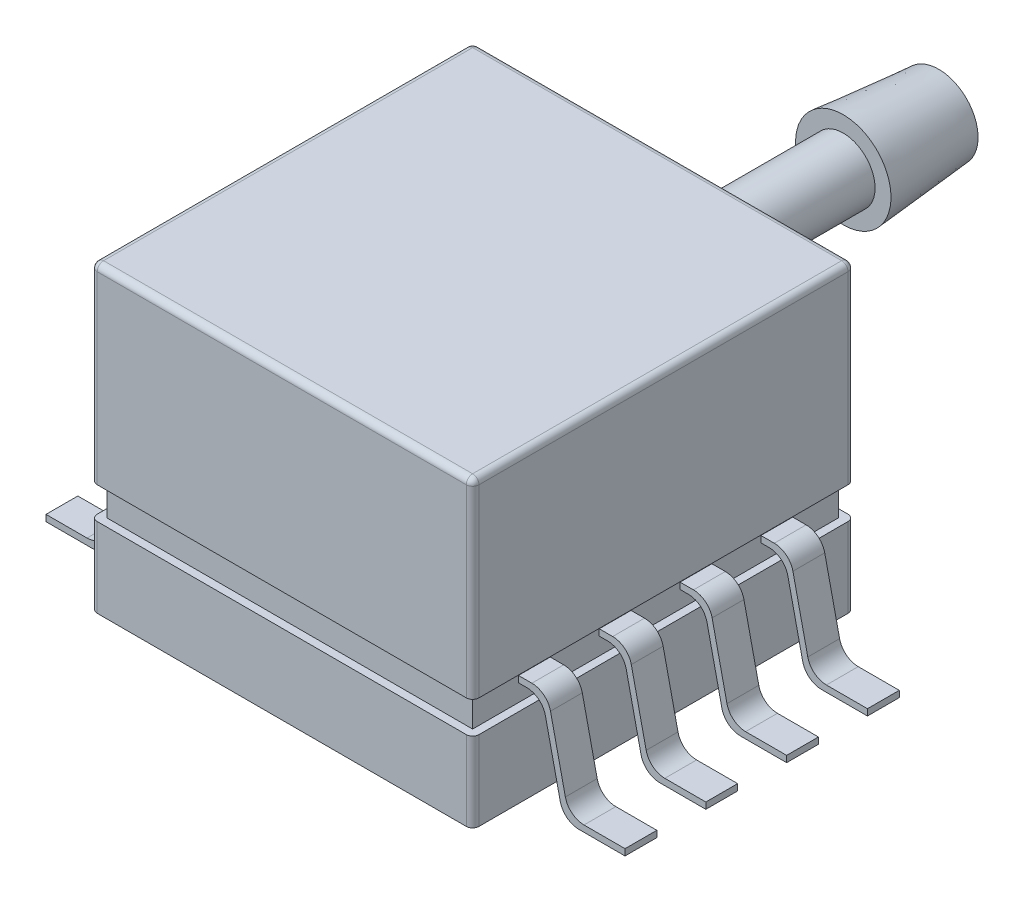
ISO-10303-21;
HEADER;
FILE_DESCRIPTION(('STEP AP214'),'2;1');
FILE_NAME('part.step','',(''),(''),'','','');
FILE_SCHEMA(('AUTOMOTIVE_DESIGN { 1 0 10303 214 1 1 1 1 }'));
ENDSEC;
DATA;
#1=APPLICATION_CONTEXT('core data for automotive mechanical design processes');
#2=APPLICATION_PROTOCOL_DEFINITION('international standard','automotive_design',2000,#1);
#3=PRODUCT_CONTEXT('',#1,'mechanical');
#4=PRODUCT('Part','Part','',(#3));
#5=PRODUCT_RELATED_PRODUCT_CATEGORY('part','',(#4));
#6=PRODUCT_DEFINITION_FORMATION('','',#4);
#7=PRODUCT_DEFINITION_CONTEXT('part definition',#1,'design');
#8=PRODUCT_DEFINITION('design','',#6,#7);
#9=PRODUCT_DEFINITION_SHAPE('','',#8);
#10=(LENGTH_UNIT() NAMED_UNIT(*) SI_UNIT(.MILLI.,.METRE.));
#11=(NAMED_UNIT(*) PLANE_ANGLE_UNIT() SI_UNIT($,.RADIAN.));
#12=(NAMED_UNIT(*) SI_UNIT($,.STERADIAN.) SOLID_ANGLE_UNIT());
#13=UNCERTAINTY_MEASURE_WITH_UNIT(LENGTH_MEASURE(1.E-05),#10,'distance_accuracy_value','');
#14=(GEOMETRIC_REPRESENTATION_CONTEXT(3) GLOBAL_UNCERTAINTY_ASSIGNED_CONTEXT((#13)) GLOBAL_UNIT_ASSIGNED_CONTEXT((#10,
#11,#12)) REPRESENTATION_CONTEXT('',''));
#15=CARTESIAN_POINT('',(0.,0.,0.));
#16=DIRECTION('',(0.,0.,1.));
#17=DIRECTION('',(1.,0.,0.));
#18=AXIS2_PLACEMENT_3D('',#15,#16,#17);
#19=CARTESIAN_POINT('',(-6.,-3.5,-6.));
#20=DIRECTION('',(0.,0.,1.));
#21=DIRECTION('',(1.,0.,0.));
#22=AXIS2_PLACEMENT_3D('',#19,#20,#21);
#23=PLANE('',#22);
#24=DIRECTION('',(1.,0.,0.));
#25=VECTOR('',#24,1.);
#26=CARTESIAN_POINT('',(-6.,-3.5,-6.));
#27=LINE('',#26,#25);
#28=CARTESIAN_POINT('',(-2.15,-3.5,-6.));
#29=VERTEX_POINT('',#28);
#30=CARTESIAN_POINT('',(5.8,-3.5,-6.));
#31=VERTEX_POINT('',#30);
#32=EDGE_CURVE('E52',#29,#31,#27,.T.);
#33=ORIENTED_EDGE('',*,*,#32,.F.);
#34=CARTESIAN_POINT('',(-2.15,-2.5,-6.));
#35=DIRECTION('',(0.,0.,-1.));
#36=DIRECTION('',(-1.,0.,0.));
#37=AXIS2_PLACEMENT_3D('',#34,#35,#36);
#38=CIRCLE('',#37,1.);
#39=EDGE_CURVE('E774',#29,#29,#38,.T.);
#40=ORIENTED_EDGE('',*,*,#39,.F.);
#41=CARTESIAN_POINT('',(-5.8,-3.5,-6.));
#42=VERTEX_POINT('',#41);
#43=EDGE_CURVE('E764',#42,#29,#27,.T.);
#44=ORIENTED_EDGE('',*,*,#43,.F.);
#45=DIRECTION('',(0.,1.,0.));
#46=VECTOR('',#45,1.);
#47=CARTESIAN_POINT('',(-5.8,-3.5,-6.));
#48=LINE('',#47,#46);
#49=CARTESIAN_POINT('',(-5.8,-1.,-6.));
#50=VERTEX_POINT('',#49);
#51=EDGE_CURVE('E917',#42,#50,#48,.T.);
#52=ORIENTED_EDGE('',*,*,#51,.T.);
#53=DIRECTION('',(1.,0.,0.));
#54=VECTOR('',#53,1.);
#55=CARTESIAN_POINT('',(-6.,-1.,-6.));
#56=LINE('',#55,#54);
#57=CARTESIAN_POINT('',(5.8,-1.,-6.));
#58=VERTEX_POINT('',#57);
#59=EDGE_CURVE('E794',#50,#58,#56,.T.);
#60=ORIENTED_EDGE('',*,*,#59,.T.);
#61=DIRECTION('',(0.,1.,0.));
#62=VECTOR('',#61,1.);
#63=CARTESIAN_POINT('',(5.8,-3.5,-6.));
#64=LINE('',#63,#62);
#65=EDGE_CURVE('E777',#58,#31,#64,.F.);
#66=ORIENTED_EDGE('',*,*,#65,.T.);
#67=EDGE_LOOP('',(#33,#40,#44,#52,#60,#66));
#68=FACE_BOUND('',#67,.T.);
#69=ADVANCED_FACE('F35',(#68),#23,.F.);
#70=CARTESIAN_POINT('',(-6.,6.,-6.));
#71=DIRECTION('',(0.,0.,1.));
#72=DIRECTION('',(1.,0.,0.));
#73=AXIS2_PLACEMENT_3D('',#70,#71,#72);
#74=PLANE('',#73);
#75=DIRECTION('',(-1.,0.,0.));
#76=VECTOR('',#75,1.);
#77=CARTESIAN_POINT('',(-6.,5.8,-6.));
#78=LINE('',#77,#76);
#79=CARTESIAN_POINT('',(-5.8,5.8,-6.));
#80=VERTEX_POINT('',#79);
#81=CARTESIAN_POINT('',(2.15,5.8,-6.));
#82=VERTEX_POINT('',#81);
#83=EDGE_CURVE('E876',#80,#82,#78,.F.);
#84=ORIENTED_EDGE('',*,*,#83,.T.);
#85=CARTESIAN_POINT('',(2.15,4.8,-6.));
#86=DIRECTION('',(0.,0.,-1.));
#87=DIRECTION('',(-1.,0.,0.));
#88=AXIS2_PLACEMENT_3D('',#85,#86,#87);
#89=CIRCLE('',#88,1.);
#90=EDGE_CURVE('E970',#82,#82,#89,.T.);
#91=ORIENTED_EDGE('',*,*,#90,.F.);
#92=CARTESIAN_POINT('',(5.8,5.8,-6.));
#93=VERTEX_POINT('',#92);
#94=EDGE_CURVE('E875',#82,#93,#78,.F.);
#95=ORIENTED_EDGE('',*,*,#94,.T.);
#96=DIRECTION('',(0.,-1.,0.));
#97=VECTOR('',#96,1.);
#98=CARTESIAN_POINT('',(5.8,6.,-6.));
#99=LINE('',#98,#97);
#100=CARTESIAN_POINT('',(5.8,0.,-6.));
#101=VERTEX_POINT('',#100);
#102=EDGE_CURVE('E873',#93,#101,#99,.T.);
#103=ORIENTED_EDGE('',*,*,#102,.T.);
#104=DIRECTION('',(-1.,0.,0.));
#105=VECTOR('',#104,1.);
#106=CARTESIAN_POINT('',(-6.,0.,-6.));
#107=LINE('',#106,#105);
#108=CARTESIAN_POINT('',(-5.8,0.,-6.));
#109=VERTEX_POINT('',#108);
#110=EDGE_CURVE('E961',#101,#109,#107,.T.);
#111=ORIENTED_EDGE('',*,*,#110,.T.);
#112=DIRECTION('',(0.,-1.,0.));
#113=VECTOR('',#112,1.);
#114=CARTESIAN_POINT('',(-5.8,6.,-6.));
#115=LINE('',#114,#113);
#116=EDGE_CURVE('E878',#109,#80,#115,.F.);
#117=ORIENTED_EDGE('',*,*,#116,.T.);
#118=EDGE_LOOP('',(#84,#91,#95,#103,#111,#117));
#119=FACE_BOUND('',#118,.T.);
#120=ADVANCED_FACE('F1763',(#119),#74,.F.);
#121=CARTESIAN_POINT('',(-5.75,-1.,5.75));
#122=DIRECTION('',(-1.,0.,0.));
#123=DIRECTION('',(0.,0.,1.));
#124=AXIS2_PLACEMENT_3D('',#121,#122,#123);
#125=PLANE('',#124);
#126=DIRECTION('',(0.,1.,0.));
#127=VECTOR('',#126,1.);
#128=CARTESIAN_POINT('',(-5.75,-1.,-1.77));
#129=LINE('',#128,#127);
#130=CARTESIAN_POINT('',(-5.75,-0.459759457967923,-1.77));
#131=VERTEX_POINT('',#130);
#132=CARTESIAN_POINT('',(-5.75,-0.259759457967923,-1.77));
#133=VERTEX_POINT('',#132);
#134=EDGE_CURVE('E1076',#131,#133,#129,.T.);
#135=ORIENTED_EDGE('',*,*,#134,.T.);
#136=DIRECTION('',(0.,0.,1.));
#137=VECTOR('',#136,1.);
#138=CARTESIAN_POINT('',(-5.75,-0.259759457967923,0.67));
#139=LINE('',#138,#137);
#140=CARTESIAN_POINT('',(-5.75,-0.259759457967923,-0.770000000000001));
#141=VERTEX_POINT('',#140);
#142=EDGE_CURVE('E1171',#133,#141,#139,.T.);
#143=ORIENTED_EDGE('',*,*,#142,.T.);
#144=DIRECTION('',(0.,1.,0.));
#145=VECTOR('',#144,1.);
#146=CARTESIAN_POINT('',(-5.75,-1.,-0.770000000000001));
#147=LINE('',#146,#145);
#148=CARTESIAN_POINT('',(-5.75,-0.459759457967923,-0.770000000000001));
#149=VERTEX_POINT('',#148);
#150=EDGE_CURVE('E1121',#149,#141,#147,.T.);
#151=ORIENTED_EDGE('',*,*,#150,.F.);
#152=DIRECTION('',(0.,0.,-1.));
#153=VECTOR('',#152,1.);
#154=CARTESIAN_POINT('',(-5.75,-0.459759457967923,0.67));
#155=LINE('',#154,#153);
#156=EDGE_CURVE('E1112',#149,#131,#155,.T.);
#157=ORIENTED_EDGE('',*,*,#156,.T.);
#158=EDGE_LOOP('',(#135,#143,#151,#157));
#159=FACE_BOUND('',#158,.T.);
#160=DIRECTION('',(0.,0.,1.));
#161=VECTOR('',#160,1.);
#162=CARTESIAN_POINT('',(-5.75,0.,5.75));
#163=LINE('',#162,#161);
#164=CARTESIAN_POINT('',(-5.75,0.,-5.75));
#165=VERTEX_POINT('',#164);
#166=CARTESIAN_POINT('',(-5.75,0.,5.75));
#167=VERTEX_POINT('',#166);
#168=EDGE_CURVE('E816',#165,#167,#163,.T.);
#169=ORIENTED_EDGE('',*,*,#168,.F.);
#170=DIRECTION('',(0.,1.,0.));
#171=VECTOR('',#170,1.);
#172=CARTESIAN_POINT('',(-5.75,-1.,-5.75));
#173=LINE('',#172,#171);
#174=CARTESIAN_POINT('',(-5.75,-1.,-5.75));
#175=VERTEX_POINT('',#174);
#176=EDGE_CURVE('E826',#175,#165,#173,.T.);
#177=ORIENTED_EDGE('',*,*,#176,.F.);
#178=DIRECTION('',(0.,0.,1.));
#179=VECTOR('',#178,1.);
#180=CARTESIAN_POINT('',(-5.75,-1.,5.75));
#181=LINE('',#180,#179);
#182=CARTESIAN_POINT('',(-5.75,-1.,5.75));
#183=VERTEX_POINT('',#182);
#184=EDGE_CURVE('E804',#175,#183,#181,.T.);
#185=ORIENTED_EDGE('',*,*,#184,.T.);
#186=DIRECTION('',(0.,1.,0.));
#187=VECTOR('',#186,1.);
#188=CARTESIAN_POINT('',(-5.75,-1.,5.75));
#189=LINE('',#188,#187);
#190=EDGE_CURVE('E824',#183,#167,#189,.T.);
#191=ORIENTED_EDGE('',*,*,#190,.T.);
#192=EDGE_LOOP('',(#169,#177,#185,#191));
#193=FACE_BOUND('',#192,.T.);
#194=DIRECTION('',(0.,1.,0.));
#195=VECTOR('',#194,1.);
#196=CARTESIAN_POINT('',(-5.75,-1.,4.31));
#197=LINE('',#196,#195);
#198=CARTESIAN_POINT('',(-5.75,-0.459759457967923,4.31));
#199=VERTEX_POINT('',#198);
#200=CARTESIAN_POINT('',(-5.75,-0.259759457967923,4.31));
#201=VERTEX_POINT('',#200);
#202=EDGE_CURVE('E838',#199,#201,#197,.T.);
#203=ORIENTED_EDGE('',*,*,#202,.F.);
#204=DIRECTION('',(0.,0.,-1.));
#205=VECTOR('',#204,1.);
#206=CARTESIAN_POINT('',(-5.75,-0.459759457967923,5.75));
#207=LINE('',#206,#205);
#208=CARTESIAN_POINT('',(-5.75,-0.459759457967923,3.31));
#209=VERTEX_POINT('',#208);
#210=EDGE_CURVE('E832',#199,#209,#207,.T.);
#211=ORIENTED_EDGE('',*,*,#210,.T.);
#212=DIRECTION('',(0.,1.,0.));
#213=VECTOR('',#212,1.);
#214=CARTESIAN_POINT('',(-5.75,-1.,3.31));
#215=LINE('',#214,#213);
#216=CARTESIAN_POINT('',(-5.75,-0.259759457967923,3.31));
#217=VERTEX_POINT('',#216);
#218=EDGE_CURVE('E823',#209,#217,#215,.T.);
#219=ORIENTED_EDGE('',*,*,#218,.T.);
#220=DIRECTION('',(0.,0.,1.));
#221=VECTOR('',#220,1.);
#222=CARTESIAN_POINT('',(-5.75,-0.259759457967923,5.75));
#223=LINE('',#222,#221);
#224=EDGE_CURVE('E835',#217,#201,#223,.T.);
#225=ORIENTED_EDGE('',*,*,#224,.T.);
#226=EDGE_LOOP('',(#203,#211,#219,#225));
#227=FACE_BOUND('',#226,.T.);
#228=DIRECTION('',(0.,1.,0.));
#229=VECTOR('',#228,1.);
#230=CARTESIAN_POINT('',(-5.75,-1.,0.769999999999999));
#231=LINE('',#230,#229);
#232=CARTESIAN_POINT('',(-5.75,-0.459759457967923,0.769999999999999));
#233=VERTEX_POINT('',#232);
#234=CARTESIAN_POINT('',(-5.75,-0.259759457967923,0.77));
#235=VERTEX_POINT('',#234);
#236=EDGE_CURVE('E1174',#233,#235,#231,.T.);
#237=ORIENTED_EDGE('',*,*,#236,.T.);
#238=DIRECTION('',(0.,0.,1.));
#239=VECTOR('',#238,1.);
#240=CARTESIAN_POINT('',(-5.75,-0.259759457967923,3.21));
#241=LINE('',#240,#239);
#242=CARTESIAN_POINT('',(-5.75,-0.259759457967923,1.77));
#243=VERTEX_POINT('',#242);
#244=EDGE_CURVE('E1269',#235,#243,#241,.T.);
#245=ORIENTED_EDGE('',*,*,#244,.T.);
#246=DIRECTION('',(0.,1.,0.));
#247=VECTOR('',#246,1.);
#248=CARTESIAN_POINT('',(-5.75,-1.,1.77));
#249=LINE('',#248,#247);
#250=CARTESIAN_POINT('',(-5.75,-0.459759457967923,1.77));
#251=VERTEX_POINT('',#250);
#252=EDGE_CURVE('E1219',#251,#243,#249,.T.);
#253=ORIENTED_EDGE('',*,*,#252,.F.);
#254=DIRECTION('',(0.,0.,-1.));
#255=VECTOR('',#254,1.);
#256=CARTESIAN_POINT('',(-5.75,-0.459759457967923,3.21));
#257=LINE('',#256,#255);
#258=EDGE_CURVE('E1210',#251,#233,#257,.T.);
#259=ORIENTED_EDGE('',*,*,#258,.T.);
#260=EDGE_LOOP('',(#237,#245,#253,#259));
#261=FACE_BOUND('',#260,.T.);
#262=DIRECTION('',(0.,1.,0.));
#263=VECTOR('',#262,1.);
#264=CARTESIAN_POINT('',(-5.75,-1.,-4.31));
#265=LINE('',#264,#263);
#266=CARTESIAN_POINT('',(-5.75,-0.459759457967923,-4.31));
#267=VERTEX_POINT('',#266);
#268=CARTESIAN_POINT('',(-5.75,-0.259759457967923,-4.31));
#269=VERTEX_POINT('',#268);
#270=EDGE_CURVE('E978',#267,#269,#265,.T.);
#271=ORIENTED_EDGE('',*,*,#270,.T.);
#272=DIRECTION('',(0.,0.,1.));
#273=VECTOR('',#272,1.);
#274=CARTESIAN_POINT('',(-5.75,-0.259759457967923,-1.87));
#275=LINE('',#274,#273);
#276=CARTESIAN_POINT('',(-5.75,-0.259759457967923,-3.31));
#277=VERTEX_POINT('',#276);
#278=EDGE_CURVE('E1073',#269,#277,#275,.T.);
#279=ORIENTED_EDGE('',*,*,#278,.T.);
#280=DIRECTION('',(0.,1.,0.));
#281=VECTOR('',#280,1.);
#282=CARTESIAN_POINT('',(-5.75,-1.,-3.31));
#283=LINE('',#282,#281);
#284=CARTESIAN_POINT('',(-5.75,-0.459759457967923,-3.31));
#285=VERTEX_POINT('',#284);
#286=EDGE_CURVE('E1023',#285,#277,#283,.T.);
#287=ORIENTED_EDGE('',*,*,#286,.F.);
#288=DIRECTION('',(0.,0.,-1.));
#289=VECTOR('',#288,1.);
#290=CARTESIAN_POINT('',(-5.75,-0.459759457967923,-1.87));
#291=LINE('',#290,#289);
#292=EDGE_CURVE('E1014',#285,#267,#291,.T.);
#293=ORIENTED_EDGE('',*,*,#292,.T.);
#294=EDGE_LOOP('',(#271,#279,#287,#293));
#295=FACE_BOUND('',#294,.T.);
#296=ADVANCED_FACE('F1768',(#159,#193,#227,#261,#295),#125,.T.);
#297=CARTESIAN_POINT('',(5.75,-1.,5.75));
#298=DIRECTION('',(1.,0.,0.));
#299=DIRECTION('',(0.,0.,-1.));
#300=AXIS2_PLACEMENT_3D('',#297,#298,#299);
#301=PLANE('',#300);
#302=DIRECTION('',(0.,-1.,0.));
#303=VECTOR('',#302,1.);
#304=CARTESIAN_POINT('',(5.75,-1.,-0.770000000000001));
#305=LINE('',#304,#303);
#306=CARTESIAN_POINT('',(5.75,-0.259759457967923,-0.770000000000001));
#307=VERTEX_POINT('',#306);
#308=CARTESIAN_POINT('',(5.75,-0.459759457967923,-0.770000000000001));
#309=VERTEX_POINT('',#308);
#310=EDGE_CURVE('E1418',#307,#309,#305,.T.);
#311=ORIENTED_EDGE('',*,*,#310,.F.);
#312=DIRECTION('',(0.,0.,-1.));
#313=VECTOR('',#312,1.);
#314=CARTESIAN_POINT('',(5.75,-0.259759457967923,0.67));
#315=LINE('',#314,#313);
#316=CARTESIAN_POINT('',(5.75,-0.259759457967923,-1.77));
#317=VERTEX_POINT('',#316);
#318=EDGE_CURVE('E1440',#307,#317,#315,.T.);
#319=ORIENTED_EDGE('',*,*,#318,.T.);
#320=DIRECTION('',(0.,-1.,0.));
#321=VECTOR('',#320,1.);
#322=CARTESIAN_POINT('',(5.75,-1.,-1.77));
#323=LINE('',#322,#321);
#324=CARTESIAN_POINT('',(5.75,-0.459759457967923,-1.77));
#325=VERTEX_POINT('',#324);
#326=EDGE_CURVE('E1371',#317,#325,#323,.T.);
#327=ORIENTED_EDGE('',*,*,#326,.T.);
#328=DIRECTION('',(0.,0.,1.));
#329=VECTOR('',#328,1.);
#330=CARTESIAN_POINT('',(5.75,-0.459759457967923,0.67));
#331=LINE('',#330,#329);
#332=EDGE_CURVE('E1407',#325,#309,#331,.T.);
#333=ORIENTED_EDGE('',*,*,#332,.T.);
#334=EDGE_LOOP('',(#311,#319,#327,#333));
#335=FACE_BOUND('',#334,.T.);
#336=DIRECTION('',(0.,0.,-1.));
#337=VECTOR('',#336,1.);
#338=CARTESIAN_POINT('',(5.75,0.,5.75));
#339=LINE('',#338,#337);
#340=CARTESIAN_POINT('',(5.75,0.,5.75));
#341=VERTEX_POINT('',#340);
#342=CARTESIAN_POINT('',(5.75,0.,-5.75));
#343=VERTEX_POINT('',#342);
#344=EDGE_CURVE('E771',#341,#343,#339,.T.);
#345=ORIENTED_EDGE('',*,*,#344,.F.);
#346=DIRECTION('',(0.,1.,0.));
#347=VECTOR('',#346,1.);
#348=CARTESIAN_POINT('',(5.75,-1.,5.75));
#349=LINE('',#348,#347);
#350=CARTESIAN_POINT('',(5.75,-1.,5.75));
#351=VERTEX_POINT('',#350);
#352=EDGE_CURVE('E821',#351,#341,#349,.T.);
#353=ORIENTED_EDGE('',*,*,#352,.F.);
#354=DIRECTION('',(0.,0.,-1.));
#355=VECTOR('',#354,1.);
#356=CARTESIAN_POINT('',(5.75,-1.,5.75));
#357=LINE('',#356,#355);
#358=CARTESIAN_POINT('',(5.75,-1.,-5.75));
#359=VERTEX_POINT('',#358);
#360=EDGE_CURVE('E797',#351,#359,#357,.T.);
#361=ORIENTED_EDGE('',*,*,#360,.T.);
#362=DIRECTION('',(0.,1.,0.));
#363=VECTOR('',#362,1.);
#364=CARTESIAN_POINT('',(5.75,-1.,-5.75));
#365=LINE('',#364,#363);
#366=EDGE_CURVE('E810',#359,#343,#365,.T.);
#367=ORIENTED_EDGE('',*,*,#366,.T.);
#368=EDGE_LOOP('',(#345,#353,#361,#367));
#369=FACE_BOUND('',#368,.T.);
#370=DIRECTION('',(0.,-1.,0.));
#371=VECTOR('',#370,1.);
#372=CARTESIAN_POINT('',(5.75,-1.,4.31));
#373=LINE('',#372,#371);
#374=CARTESIAN_POINT('',(5.75,-0.259759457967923,4.31));
#375=VERTEX_POINT('',#374);
#376=CARTESIAN_POINT('',(5.75,-0.459759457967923,4.31));
#377=VERTEX_POINT('',#376);
#378=EDGE_CURVE('E849',#375,#377,#373,.T.);
#379=ORIENTED_EDGE('',*,*,#378,.F.);
#380=DIRECTION('',(0.,0.,-1.));
#381=VECTOR('',#380,1.);
#382=CARTESIAN_POINT('',(5.75,-0.259759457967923,5.75));
#383=LINE('',#382,#381);
#384=CARTESIAN_POINT('',(5.75,-0.259759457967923,3.31));
#385=VERTEX_POINT('',#384);
#386=EDGE_CURVE('E846',#375,#385,#383,.T.);
#387=ORIENTED_EDGE('',*,*,#386,.T.);
#388=DIRECTION('',(0.,-1.,0.));
#389=VECTOR('',#388,1.);
#390=CARTESIAN_POINT('',(5.75,-1.,3.31));
#391=LINE('',#390,#389);
#392=CARTESIAN_POINT('',(5.75,-0.459759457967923,3.31));
#393=VERTEX_POINT('',#392);
#394=EDGE_CURVE('E840',#385,#393,#391,.T.);
#395=ORIENTED_EDGE('',*,*,#394,.T.);
#396=DIRECTION('',(0.,0.,1.));
#397=VECTOR('',#396,1.);
#398=CARTESIAN_POINT('',(5.75,-0.459759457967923,5.75));
#399=LINE('',#398,#397);
#400=EDGE_CURVE('E843',#393,#377,#399,.T.);
#401=ORIENTED_EDGE('',*,*,#400,.T.);
#402=EDGE_LOOP('',(#379,#387,#395,#401));
#403=FACE_BOUND('',#402,.T.);
#404=DIRECTION('',(0.,-1.,0.));
#405=VECTOR('',#404,1.);
#406=CARTESIAN_POINT('',(5.75,-1.,1.77));
#407=LINE('',#406,#405);
#408=CARTESIAN_POINT('',(5.75,-0.259759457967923,1.77));
#409=VERTEX_POINT('',#408);
#410=CARTESIAN_POINT('',(5.75,-0.459759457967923,1.77));
#411=VERTEX_POINT('',#410);
#412=EDGE_CURVE('E1517',#409,#411,#407,.T.);
#413=ORIENTED_EDGE('',*,*,#412,.F.);
#414=DIRECTION('',(0.,0.,-1.));
#415=VECTOR('',#414,1.);
#416=CARTESIAN_POINT('',(5.75,-0.259759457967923,3.21));
#417=LINE('',#416,#415);
#418=CARTESIAN_POINT('',(5.75,-0.259759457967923,0.769999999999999));
#419=VERTEX_POINT('',#418);
#420=EDGE_CURVE('E1539',#409,#419,#417,.T.);
#421=ORIENTED_EDGE('',*,*,#420,.T.);
#422=DIRECTION('',(0.,-1.,0.));
#423=VECTOR('',#422,1.);
#424=CARTESIAN_POINT('',(5.75,-1.,0.769999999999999));
#425=LINE('',#424,#423);
#426=CARTESIAN_POINT('',(5.75,-0.459759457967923,0.77));
#427=VERTEX_POINT('',#426);
#428=EDGE_CURVE('E1470',#419,#427,#425,.T.);
#429=ORIENTED_EDGE('',*,*,#428,.T.);
#430=DIRECTION('',(0.,0.,1.));
#431=VECTOR('',#430,1.);
#432=CARTESIAN_POINT('',(5.75,-0.459759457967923,3.21));
#433=LINE('',#432,#431);
#434=EDGE_CURVE('E1506',#427,#411,#433,.T.);
#435=ORIENTED_EDGE('',*,*,#434,.T.);
#436=EDGE_LOOP('',(#413,#421,#429,#435));
#437=FACE_BOUND('',#436,.T.);
#438=DIRECTION('',(0.,-1.,0.));
#439=VECTOR('',#438,1.);
#440=CARTESIAN_POINT('',(5.75,-1.,-3.31));
#441=LINE('',#440,#439);
#442=CARTESIAN_POINT('',(5.75,-0.259759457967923,-3.31));
#443=VERTEX_POINT('',#442);
#444=CARTESIAN_POINT('',(5.75,-0.459759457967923,-3.31));
#445=VERTEX_POINT('',#444);
#446=EDGE_CURVE('E1319',#443,#445,#441,.T.);
#447=ORIENTED_EDGE('',*,*,#446,.F.);
#448=DIRECTION('',(0.,0.,-1.));
#449=VECTOR('',#448,1.);
#450=CARTESIAN_POINT('',(5.75,-0.259759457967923,-1.87));
#451=LINE('',#450,#449);
#452=CARTESIAN_POINT('',(5.75,-0.259759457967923,-4.31));
#453=VERTEX_POINT('',#452);
#454=EDGE_CURVE('E1341',#443,#453,#451,.T.);
#455=ORIENTED_EDGE('',*,*,#454,.T.);
#456=DIRECTION('',(0.,-1.,0.));
#457=VECTOR('',#456,1.);
#458=CARTESIAN_POINT('',(5.75,-1.,-4.31));
#459=LINE('',#458,#457);
#460=CARTESIAN_POINT('',(5.75,-0.459759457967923,-4.31));
#461=VERTEX_POINT('',#460);
#462=EDGE_CURVE('E1272',#453,#461,#459,.T.);
#463=ORIENTED_EDGE('',*,*,#462,.T.);
#464=DIRECTION('',(0.,0.,1.));
#465=VECTOR('',#464,1.);
#466=CARTESIAN_POINT('',(5.75,-0.459759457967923,-1.87));
#467=LINE('',#466,#465);
#468=EDGE_CURVE('E1308',#461,#445,#467,.T.);
#469=ORIENTED_EDGE('',*,*,#468,.T.);
#470=EDGE_LOOP('',(#447,#455,#463,#469));
#471=FACE_BOUND('',#470,.T.);
#472=ADVANCED_FACE('F3040',(#335,#369,#403,#437,#471),#301,.T.);
#473=CARTESIAN_POINT('',(-5.75,-1.,5.75));
#474=DIRECTION('',(0.,0.,1.));
#475=DIRECTION('',(1.,0.,0.));
#476=AXIS2_PLACEMENT_3D('',#473,#474,#475);
#477=PLANE('',#476);
#478=DIRECTION('',(1.,0.,0.));
#479=VECTOR('',#478,1.);
#480=CARTESIAN_POINT('',(-5.75,0.,5.75));
#481=LINE('',#480,#479);
#482=EDGE_CURVE('E801',#167,#341,#481,.T.);
#483=ORIENTED_EDGE('',*,*,#482,.F.);
#484=ORIENTED_EDGE('',*,*,#190,.F.);
#485=DIRECTION('',(1.,0.,0.));
#486=VECTOR('',#485,1.);
#487=CARTESIAN_POINT('',(-5.75,-1.,5.75));
#488=LINE('',#487,#486);
#489=EDGE_CURVE('E807',#183,#351,#488,.T.);
#490=ORIENTED_EDGE('',*,*,#489,.T.);
#491=ORIENTED_EDGE('',*,*,#352,.T.);
#492=EDGE_LOOP('',(#483,#484,#490,#491));
#493=FACE_BOUND('',#492,.T.);
#494=ADVANCED_FACE('F3049',(#493),#477,.T.);
#495=CARTESIAN_POINT('',(-5.75,-1.,-5.75));
#496=DIRECTION('',(0.,0.,-1.));
#497=DIRECTION('',(-1.,0.,0.));
#498=AXIS2_PLACEMENT_3D('',#495,#496,#497);
#499=PLANE('',#498);
#500=DIRECTION('',(-1.,0.,0.));
#501=VECTOR('',#500,1.);
#502=CARTESIAN_POINT('',(-5.75,0.,-5.75));
#503=LINE('',#502,#501);
#504=EDGE_CURVE('E813',#343,#165,#503,.T.);
#505=ORIENTED_EDGE('',*,*,#504,.F.);
#506=ORIENTED_EDGE('',*,*,#366,.F.);
#507=DIRECTION('',(-1.,0.,0.));
#508=VECTOR('',#507,1.);
#509=CARTESIAN_POINT('',(-5.75,-1.,-5.75));
#510=LINE('',#509,#508);
#511=EDGE_CURVE('E800',#359,#175,#510,.T.);
#512=ORIENTED_EDGE('',*,*,#511,.T.);
#513=ORIENTED_EDGE('',*,*,#176,.T.);
#514=EDGE_LOOP('',(#505,#506,#512,#513));
#515=FACE_BOUND('',#514,.T.);
#516=ADVANCED_FACE('F1760',(#515),#499,.T.);
#517=CARTESIAN_POINT('',(6.,-3.5,-6.));
#518=DIRECTION('',(-1.,0.,0.));
#519=DIRECTION('',(0.,0.,1.));
#520=AXIS2_PLACEMENT_3D('',#517,#518,#519);
#521=PLANE('',#520);
#522=DIRECTION('',(0.,0.,1.));
#523=VECTOR('',#522,1.);
#524=CARTESIAN_POINT('',(6.,-1.,-6.));
#525=LINE('',#524,#523);
#526=CARTESIAN_POINT('',(6.,-1.,-5.8));
#527=VERTEX_POINT('',#526);
#528=CARTESIAN_POINT('',(6.,-1.,5.8));
#529=VERTEX_POINT('',#528);
#530=EDGE_CURVE('E784',#527,#529,#525,.T.);
#531=ORIENTED_EDGE('',*,*,#530,.T.);
#532=DIRECTION('',(0.,1.,0.));
#533=VECTOR('',#532,1.);
#534=CARTESIAN_POINT('',(6.,-3.5,5.8));
#535=LINE('',#534,#533);
#536=CARTESIAN_POINT('',(6.,-3.5,5.8));
#537=VERTEX_POINT('',#536);
#538=EDGE_CURVE('E902',#529,#537,#535,.F.);
#539=ORIENTED_EDGE('',*,*,#538,.T.);
#540=DIRECTION('',(0.,0.,1.));
#541=VECTOR('',#540,1.);
#542=CARTESIAN_POINT('',(6.,-3.5,-6.));
#543=LINE('',#542,#541);
#544=CARTESIAN_POINT('',(6.,-3.5,-5.8));
#545=VERTEX_POINT('',#544);
#546=EDGE_CURVE('E796',#545,#537,#543,.T.);
#547=ORIENTED_EDGE('',*,*,#546,.F.);
#548=DIRECTION('',(0.,1.,0.));
#549=VECTOR('',#548,1.);
#550=CARTESIAN_POINT('',(6.,-3.5,-5.8));
#551=LINE('',#550,#549);
#552=EDGE_CURVE('E899',#545,#527,#551,.T.);
#553=ORIENTED_EDGE('',*,*,#552,.T.);
#554=EDGE_LOOP('',(#531,#539,#547,#553));
#555=FACE_BOUND('',#554,.T.);
#556=ADVANCED_FACE('F1747',(#555),#521,.F.);
#557=CARTESIAN_POINT('',(-6.,-3.5,6.));
#558=DIRECTION('',(0.,0.,-1.));
#559=DIRECTION('',(-1.,0.,0.));
#560=AXIS2_PLACEMENT_3D('',#557,#558,#559);
#561=PLANE('',#560);
#562=DIRECTION('',(-1.,0.,0.));
#563=VECTOR('',#562,1.);
#564=CARTESIAN_POINT('',(-6.,-3.5,6.));
#565=LINE('',#564,#563);
#566=CARTESIAN_POINT('',(5.8,-3.5,6.));
#567=VERTEX_POINT('',#566);
#568=CARTESIAN_POINT('',(-5.8,-3.5,6.));
#569=VERTEX_POINT('',#568);
#570=EDGE_CURVE('E780',#567,#569,#565,.T.);
#571=ORIENTED_EDGE('',*,*,#570,.F.);
#572=DIRECTION('',(0.,1.,0.));
#573=VECTOR('',#572,1.);
#574=CARTESIAN_POINT('',(5.8,-3.5,6.));
#575=LINE('',#574,#573);
#576=CARTESIAN_POINT('',(5.8,-1.,6.));
#577=VERTEX_POINT('',#576);
#578=EDGE_CURVE('E888',#567,#577,#575,.T.);
#579=ORIENTED_EDGE('',*,*,#578,.T.);
#580=DIRECTION('',(-1.,0.,0.));
#581=VECTOR('',#580,1.);
#582=CARTESIAN_POINT('',(-6.,-1.,6.));
#583=LINE('',#582,#581);
#584=CARTESIAN_POINT('',(-5.8,-1.,6.));
#585=VERTEX_POINT('',#584);
#586=EDGE_CURVE('E787',#577,#585,#583,.T.);
#587=ORIENTED_EDGE('',*,*,#586,.T.);
#588=DIRECTION('',(0.,1.,0.));
#589=VECTOR('',#588,1.);
#590=CARTESIAN_POINT('',(-5.8,-3.5,6.));
#591=LINE('',#590,#589);
#592=EDGE_CURVE('E886',#585,#569,#591,.F.);
#593=ORIENTED_EDGE('',*,*,#592,.T.);
#594=EDGE_LOOP('',(#571,#579,#587,#593));
#595=FACE_BOUND('',#594,.T.);
#596=ADVANCED_FACE('F1752',(#595),#561,.F.);
#597=CARTESIAN_POINT('',(-6.,-3.5,-6.));
#598=DIRECTION('',(1.,0.,0.));
#599=DIRECTION('',(0.,0.,-1.));
#600=AXIS2_PLACEMENT_3D('',#597,#598,#599);
#601=PLANE('',#600);
#602=DIRECTION('',(0.,0.,-1.));
#603=VECTOR('',#602,1.);
#604=CARTESIAN_POINT('',(-6.,-3.5,-6.));
#605=LINE('',#604,#603);
#606=CARTESIAN_POINT('',(-6.,-3.5,5.8));
#607=VERTEX_POINT('',#606);
#608=CARTESIAN_POINT('',(-6.,-3.5,-5.8));
#609=VERTEX_POINT('',#608);
#610=EDGE_CURVE('E779',#607,#609,#605,.T.);
#611=ORIENTED_EDGE('',*,*,#610,.F.);
#612=DIRECTION('',(0.,1.,0.));
#613=VECTOR('',#612,1.);
#614=CARTESIAN_POINT('',(-6.,-3.5,5.8));
#615=LINE('',#614,#613);
#616=CARTESIAN_POINT('',(-6.,-1.,5.8));
#617=VERTEX_POINT('',#616);
#618=EDGE_CURVE('E913',#607,#617,#615,.T.);
#619=ORIENTED_EDGE('',*,*,#618,.T.);
#620=DIRECTION('',(0.,0.,-1.));
#621=VECTOR('',#620,1.);
#622=CARTESIAN_POINT('',(-6.,-1.,-6.));
#623=LINE('',#622,#621);
#624=CARTESIAN_POINT('',(-6.,-1.,-5.8));
#625=VERTEX_POINT('',#624);
#626=EDGE_CURVE('E791',#617,#625,#623,.T.);
#627=ORIENTED_EDGE('',*,*,#626,.T.);
#628=DIRECTION('',(0.,1.,0.));
#629=VECTOR('',#628,1.);
#630=CARTESIAN_POINT('',(-6.,-3.5,-5.8));
#631=LINE('',#630,#629);
#632=EDGE_CURVE('E911',#625,#609,#631,.F.);
#633=ORIENTED_EDGE('',*,*,#632,.T.);
#634=EDGE_LOOP('',(#611,#619,#627,#633));
#635=FACE_BOUND('',#634,.T.);
#636=ADVANCED_FACE('F1735',(#635),#601,.F.);
#637=CARTESIAN_POINT('',(6.,-3.5,6.));
#638=DIRECTION('',(0.,1.,0.));
#639=DIRECTION('',(0.,0.,1.));
#640=AXIS2_PLACEMENT_3D('',#637,#638,#639);
#641=PLANE('',#640);
#642=ORIENTED_EDGE('',*,*,#546,.T.);
#643=CARTESIAN_POINT('',(5.8,-3.5,5.8));
#644=DIRECTION('',(0.,1.,0.));
#645=DIRECTION('',(0.,0.,1.));
#646=AXIS2_PLACEMENT_3D('',#643,#644,#645);
#647=CIRCLE('',#646,0.2);
#648=EDGE_CURVE('E909',#537,#567,#647,.F.);
#649=ORIENTED_EDGE('',*,*,#648,.T.);
#650=ORIENTED_EDGE('',*,*,#570,.T.);
#651=CARTESIAN_POINT('',(-5.8,-3.5,5.8));
#652=DIRECTION('',(0.,1.,0.));
#653=DIRECTION('',(0.,0.,1.));
#654=AXIS2_PLACEMENT_3D('',#651,#652,#653);
#655=CIRCLE('',#654,0.2);
#656=EDGE_CURVE('E907',#569,#607,#655,.F.);
#657=ORIENTED_EDGE('',*,*,#656,.T.);
#658=ORIENTED_EDGE('',*,*,#610,.T.);
#659=CARTESIAN_POINT('',(-5.8,-3.5,-5.8));
#660=DIRECTION('',(0.,1.,0.));
#661=DIRECTION('',(0.,0.,1.));
#662=AXIS2_PLACEMENT_3D('',#659,#660,#661);
#663=CIRCLE('',#662,0.2);
#664=EDGE_CURVE('E58',#609,#42,#663,.F.);
#665=ORIENTED_EDGE('',*,*,#664,.T.);
#666=ORIENTED_EDGE('',*,*,#43,.T.);
#667=ORIENTED_EDGE('',*,*,#32,.T.);
#668=CARTESIAN_POINT('',(5.8,-3.5,-5.8));
#669=DIRECTION('',(0.,1.,0.));
#670=DIRECTION('',(0.,0.,1.));
#671=AXIS2_PLACEMENT_3D('',#668,#669,#670);
#672=CIRCLE('',#671,0.2);
#673=EDGE_CURVE('E904',#31,#545,#672,.F.);
#674=ORIENTED_EDGE('',*,*,#673,.T.);
#675=EDGE_LOOP('',(#642,#649,#650,#657,#658,#665,#666,#667,#674));
#676=FACE_BOUND('',#675,.T.);
#677=ADVANCED_FACE('F766',(#676),#641,.F.);
#678=CARTESIAN_POINT('',(6.,-1.,6.));
#679=DIRECTION('',(0.,1.,0.));
#680=DIRECTION('',(0.,0.,1.));
#681=AXIS2_PLACEMENT_3D('',#678,#679,#680);
#682=PLANE('',#681);
#683=ORIENTED_EDGE('',*,*,#511,.F.);
#684=ORIENTED_EDGE('',*,*,#360,.F.);
#685=ORIENTED_EDGE('',*,*,#489,.F.);
#686=ORIENTED_EDGE('',*,*,#184,.F.);
#687=EDGE_LOOP('',(#683,#684,#685,#686));
#688=FACE_BOUND('',#687,.T.);
#689=ORIENTED_EDGE('',*,*,#586,.F.);
#690=CARTESIAN_POINT('',(5.8,-1.,5.8));
#691=DIRECTION('',(0.,1.,0.));
#692=DIRECTION('',(0.,0.,1.));
#693=AXIS2_PLACEMENT_3D('',#690,#691,#692);
#694=CIRCLE('',#693,0.2);
#695=EDGE_CURVE('E897',#577,#529,#694,.T.);
#696=ORIENTED_EDGE('',*,*,#695,.T.);
#697=ORIENTED_EDGE('',*,*,#530,.F.);
#698=CARTESIAN_POINT('',(5.8,-1.,-5.8));
#699=DIRECTION('',(0.,1.,0.));
#700=DIRECTION('',(0.,0.,1.));
#701=AXIS2_PLACEMENT_3D('',#698,#699,#700);
#702=CIRCLE('',#701,0.2);
#703=EDGE_CURVE('E891',#527,#58,#702,.T.);
#704=ORIENTED_EDGE('',*,*,#703,.T.);
#705=ORIENTED_EDGE('',*,*,#59,.F.);
#706=CARTESIAN_POINT('',(-5.8,-1.,-5.8));
#707=DIRECTION('',(0.,1.,0.));
#708=DIRECTION('',(0.,0.,1.));
#709=AXIS2_PLACEMENT_3D('',#706,#707,#708);
#710=CIRCLE('',#709,0.2);
#711=EDGE_CURVE('E893',#50,#625,#710,.T.);
#712=ORIENTED_EDGE('',*,*,#711,.T.);
#713=ORIENTED_EDGE('',*,*,#626,.F.);
#714=CARTESIAN_POINT('',(-5.8,-1.,5.8));
#715=DIRECTION('',(0.,1.,0.));
#716=DIRECTION('',(0.,0.,1.));
#717=AXIS2_PLACEMENT_3D('',#714,#715,#716);
#718=CIRCLE('',#717,0.2);
#719=EDGE_CURVE('E895',#617,#585,#718,.T.);
#720=ORIENTED_EDGE('',*,*,#719,.T.);
#721=EDGE_LOOP('',(#689,#696,#697,#704,#705,#712,#713,#720));
#722=FACE_BOUND('',#721,.T.);
#723=ADVANCED_FACE('F1739',(#688,#722),#682,.T.);
#724=CARTESIAN_POINT('',(-5.08650126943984,-0.259759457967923,4.31));
#725=DIRECTION('',(0.,-1.,0.));
#726=DIRECTION('',(1.,0.,0.));
#727=AXIS2_PLACEMENT_3D('',#724,#725,#726);
#728=PLANE('',#727);
#729=ORIENTED_EDGE('',*,*,#224,.F.);
#730=DIRECTION('',(-1.,0.,0.));
#731=VECTOR('',#730,1.);
#732=CARTESIAN_POINT('',(-5.08650126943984,-0.259759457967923,3.31));
#733=LINE('',#732,#731);
#734=CARTESIAN_POINT('',(-6.17192707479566,-0.259759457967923,3.31));
#735=VERTEX_POINT('',#734);
#736=EDGE_CURVE('E1647',#217,#735,#733,.T.);
#737=ORIENTED_EDGE('',*,*,#736,.T.);
#738=DIRECTION('',(0.,0.,-1.));
#739=VECTOR('',#738,1.);
#740=CARTESIAN_POINT('',(-6.17192707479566,-0.259759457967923,4.31));
#741=LINE('',#740,#739);
#742=CARTESIAN_POINT('',(-6.17192707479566,-0.259759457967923,4.31));
#743=VERTEX_POINT('',#742);
#744=EDGE_CURVE('E788',#743,#735,#741,.T.);
#745=ORIENTED_EDGE('',*,*,#744,.F.);
#746=DIRECTION('',(-1.,0.,0.));
#747=VECTOR('',#746,1.);
#748=CARTESIAN_POINT('',(-5.08650126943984,-0.259759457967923,4.31));
#749=LINE('',#748,#747);
#750=EDGE_CURVE('E1648',#201,#743,#749,.T.);
#751=ORIENTED_EDGE('',*,*,#750,.F.);
#752=EDGE_LOOP('',(#729,#737,#745,#751));
#753=FACE_BOUND('',#752,.T.);
#754=ADVANCED_FACE('F1774',(#753),#728,.F.);
#755=CARTESIAN_POINT('',(-6.17192707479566,-0.859759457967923,4.31));
#756=DIRECTION('',(0.,0.,-1.));
#757=DIRECTION('',(-1.,0.,0.));
#758=AXIS2_PLACEMENT_3D('',#755,#756,#757);
#759=CYLINDRICAL_SURFACE('',#758,0.599999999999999);
#760=CARTESIAN_POINT('',(-6.17192707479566,-0.859759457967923,3.31));
#761=DIRECTION('',(0.,0.,1.));
#762=DIRECTION('',(1.,0.,0.));
#763=AXIS2_PLACEMENT_3D('',#760,#761,#762);
#764=CIRCLE('',#763,0.599999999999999);
#765=CARTESIAN_POINT('',(-6.75761185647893,-0.72947769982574,3.31));
#766=VERTEX_POINT('',#765);
#767=EDGE_CURVE('E1674',#735,#766,#764,.T.);
#768=ORIENTED_EDGE('',*,*,#767,.T.);
#769=DIRECTION('',(0.,0.,-1.));
#770=VECTOR('',#769,1.);
#771=CARTESIAN_POINT('',(-6.75761185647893,-0.72947769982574,4.31));
#772=LINE('',#771,#770);
#773=CARTESIAN_POINT('',(-6.75761185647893,-0.72947769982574,4.31));
#774=VERTEX_POINT('',#773);
#775=EDGE_CURVE('E1717',#774,#766,#772,.T.);
#776=ORIENTED_EDGE('',*,*,#775,.F.);
#777=CARTESIAN_POINT('',(-6.17192707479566,-0.859759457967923,4.31));
#778=DIRECTION('',(0.,0.,1.));
#779=DIRECTION('',(1.,0.,0.));
#780=AXIS2_PLACEMENT_3D('',#777,#778,#779);
#781=CIRCLE('',#780,0.599999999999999);
#782=EDGE_CURVE('E1650',#743,#774,#781,.T.);
#783=ORIENTED_EDGE('',*,*,#782,.F.);
#784=ORIENTED_EDGE('',*,*,#744,.T.);
#785=EDGE_LOOP('',(#768,#776,#783,#784));
#786=FACE_BOUND('',#785,.T.);
#787=ADVANCED_FACE('F1780',(#786),#759,.T.);
#788=CARTESIAN_POINT('',(-6.75761185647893,-0.72947769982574,4.31));
#789=DIRECTION('',(0.976141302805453,-0.217136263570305,0.));
#790=DIRECTION('',(0.217136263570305,0.976141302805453,0.));
#791=AXIS2_PLACEMENT_3D('',#788,#789,#790);
#792=PLANE('',#791);
#793=DIRECTION('',(-0.217136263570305,-0.976141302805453,0.));
#794=VECTOR('',#793,1.);
#795=CARTESIAN_POINT('',(-6.75761185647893,-0.72947769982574,3.31));
#796=LINE('',#795,#794);
#797=CARTESIAN_POINT('',(-7.22492201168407,-2.83028175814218,3.31));
#798=VERTEX_POINT('',#797);
#799=EDGE_CURVE('E1676',#766,#798,#796,.T.);
#800=ORIENTED_EDGE('',*,*,#799,.T.);
#801=DIRECTION('',(0.,0.,-1.));
#802=VECTOR('',#801,1.);
#803=CARTESIAN_POINT('',(-7.22492201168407,-2.83028175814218,4.31));
#804=LINE('',#803,#802);
#805=CARTESIAN_POINT('',(-7.22492201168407,-2.83028175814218,4.31));
#806=VERTEX_POINT('',#805);
#807=EDGE_CURVE('E1714',#806,#798,#804,.T.);
#808=ORIENTED_EDGE('',*,*,#807,.F.);
#809=DIRECTION('',(-0.217136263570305,-0.976141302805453,0.));
#810=VECTOR('',#809,1.);
#811=CARTESIAN_POINT('',(-6.75761185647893,-0.72947769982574,4.31));
#812=LINE('',#811,#810);
#813=EDGE_CURVE('E1653',#774,#806,#812,.T.);
#814=ORIENTED_EDGE('',*,*,#813,.F.);
#815=ORIENTED_EDGE('',*,*,#775,.T.);
#816=EDGE_LOOP('',(#800,#808,#814,#815));
#817=FACE_BOUND('',#816,.T.);
#818=ADVANCED_FACE('F1784',(#817),#792,.F.);
#819=CARTESIAN_POINT('',(-7.81060679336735,-2.7,4.31));
#820=DIRECTION('',(0.,0.,-1.));
#821=DIRECTION('',(-1.,0.,0.));
#822=AXIS2_PLACEMENT_3D('',#819,#820,#821);
#823=CYLINDRICAL_SURFACE('',#822,0.6);
#824=CARTESIAN_POINT('',(-7.81060679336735,-2.7,3.31));
#825=DIRECTION('',(0.,0.,-1.));
#826=DIRECTION('',(-1.,0.,0.));
#827=AXIS2_PLACEMENT_3D('',#824,#825,#826);
#828=CIRCLE('',#827,0.6);
#829=CARTESIAN_POINT('',(-7.81060679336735,-3.3,3.31));
#830=VERTEX_POINT('',#829);
#831=EDGE_CURVE('E1678',#798,#830,#828,.T.);
#832=ORIENTED_EDGE('',*,*,#831,.T.);
#833=DIRECTION('',(0.,0.,-1.));
#834=VECTOR('',#833,1.);
#835=CARTESIAN_POINT('',(-7.81060679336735,-3.3,4.31));
#836=LINE('',#835,#834);
#837=CARTESIAN_POINT('',(-7.81060679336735,-3.3,4.31));
#838=VERTEX_POINT('',#837);
#839=EDGE_CURVE('E1711',#838,#830,#836,.T.);
#840=ORIENTED_EDGE('',*,*,#839,.F.);
#841=CARTESIAN_POINT('',(-7.81060679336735,-2.7,4.31));
#842=DIRECTION('',(0.,0.,-1.));
#843=DIRECTION('',(-1.,0.,0.));
#844=AXIS2_PLACEMENT_3D('',#841,#842,#843);
#845=CIRCLE('',#844,0.6);
#846=EDGE_CURVE('E1655',#806,#838,#845,.T.);
#847=ORIENTED_EDGE('',*,*,#846,.F.);
#848=ORIENTED_EDGE('',*,*,#807,.T.);
#849=EDGE_LOOP('',(#832,#840,#847,#848));
#850=FACE_BOUND('',#849,.T.);
#851=ADVANCED_FACE('F1788',(#850),#823,.F.);
#852=CARTESIAN_POINT('',(-7.81060679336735,-3.3,4.31));
#853=DIRECTION('',(0.,-1.,0.));
#854=DIRECTION('',(0.,0.,-1.));
#855=AXIS2_PLACEMENT_3D('',#852,#853,#854);
#856=PLANE('',#855);
#857=DIRECTION('',(-1.,0.,0.));
#858=VECTOR('',#857,1.);
#859=CARTESIAN_POINT('',(-7.81060679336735,-3.3,3.31));
#860=LINE('',#859,#858);
#861=CARTESIAN_POINT('',(-9.1,-3.3,3.31));
#862=VERTEX_POINT('',#861);
#863=EDGE_CURVE('E1680',#830,#862,#860,.T.);
#864=ORIENTED_EDGE('',*,*,#863,.T.);
#865=DIRECTION('',(0.,0.,-1.));
#866=VECTOR('',#865,1.);
#867=CARTESIAN_POINT('',(-9.1,-3.3,4.31));
#868=LINE('',#867,#866);
#869=CARTESIAN_POINT('',(-9.1,-3.3,4.31));
#870=VERTEX_POINT('',#869);
#871=EDGE_CURVE('E1708',#870,#862,#868,.T.);
#872=ORIENTED_EDGE('',*,*,#871,.F.);
#873=DIRECTION('',(-1.,0.,0.));
#874=VECTOR('',#873,1.);
#875=CARTESIAN_POINT('',(-7.81060679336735,-3.3,4.31));
#876=LINE('',#875,#874);
#877=EDGE_CURVE('E1657',#838,#870,#876,.T.);
#878=ORIENTED_EDGE('',*,*,#877,.F.);
#879=ORIENTED_EDGE('',*,*,#839,.T.);
#880=EDGE_LOOP('',(#864,#872,#878,#879));
#881=FACE_BOUND('',#880,.T.);
#882=ADVANCED_FACE('F1792',(#881),#856,.F.);
#883=CARTESIAN_POINT('',(-9.1,-3.3,4.31));
#884=DIRECTION('',(1.,0.,0.));
#885=DIRECTION('',(0.,0.,-1.));
#886=AXIS2_PLACEMENT_3D('',#883,#884,#885);
#887=PLANE('',#886);
#888=DIRECTION('',(0.,-1.,0.));
#889=VECTOR('',#888,1.);
#890=CARTESIAN_POINT('',(-9.1,-3.3,3.31));
#891=LINE('',#890,#889);
#892=CARTESIAN_POINT('',(-9.1,-3.5,3.31));
#893=VERTEX_POINT('',#892);
#894=EDGE_CURVE('E1682',#862,#893,#891,.T.);
#895=ORIENTED_EDGE('',*,*,#894,.T.);
#896=DIRECTION('',(0.,0.,-1.));
#897=VECTOR('',#896,1.);
#898=CARTESIAN_POINT('',(-9.1,-3.5,4.31));
#899=LINE('',#898,#897);
#900=CARTESIAN_POINT('',(-9.1,-3.5,4.31));
#901=VERTEX_POINT('',#900);
#902=EDGE_CURVE('E1705',#901,#893,#899,.T.);
#903=ORIENTED_EDGE('',*,*,#902,.F.);
#904=DIRECTION('',(0.,-1.,0.));
#905=VECTOR('',#904,1.);
#906=CARTESIAN_POINT('',(-9.1,-3.3,4.31));
#907=LINE('',#906,#905);
#908=EDGE_CURVE('E1659',#870,#901,#907,.T.);
#909=ORIENTED_EDGE('',*,*,#908,.F.);
#910=ORIENTED_EDGE('',*,*,#871,.T.);
#911=EDGE_LOOP('',(#895,#903,#909,#910));
#912=FACE_BOUND('',#911,.T.);
#913=ADVANCED_FACE('F1796',(#912),#887,.F.);
#914=CARTESIAN_POINT('',(-9.1,-3.5,4.31));
#915=DIRECTION('',(0.,1.,0.));
#916=DIRECTION('',(0.,0.,1.));
#917=AXIS2_PLACEMENT_3D('',#914,#915,#916);
#918=PLANE('',#917);
#919=DIRECTION('',(1.,0.,0.));
#920=VECTOR('',#919,1.);
#921=CARTESIAN_POINT('',(-9.1,-3.5,3.31));
#922=LINE('',#921,#920);
#923=CARTESIAN_POINT('',(-7.65020711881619,-3.5,3.31));
#924=VERTEX_POINT('',#923);
#925=EDGE_CURVE('E1684',#893,#924,#922,.T.);
#926=ORIENTED_EDGE('',*,*,#925,.T.);
#927=DIRECTION('',(0.,0.,-1.));
#928=VECTOR('',#927,1.);
#929=CARTESIAN_POINT('',(-7.65020711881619,-3.5,4.31));
#930=LINE('',#929,#928);
#931=CARTESIAN_POINT('',(-7.65020711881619,-3.5,4.31));
#932=VERTEX_POINT('',#931);
#933=EDGE_CURVE('E1702',#932,#924,#930,.T.);
#934=ORIENTED_EDGE('',*,*,#933,.F.);
#935=DIRECTION('',(1.,0.,0.));
#936=VECTOR('',#935,1.);
#937=CARTESIAN_POINT('',(-9.1,-3.5,4.31));
#938=LINE('',#937,#936);
#939=EDGE_CURVE('E1661',#901,#932,#938,.T.);
#940=ORIENTED_EDGE('',*,*,#939,.F.);
#941=ORIENTED_EDGE('',*,*,#902,.T.);
#942=EDGE_LOOP('',(#926,#934,#940,#941));
#943=FACE_BOUND('',#942,.T.);
#944=ADVANCED_FACE('F1800',(#943),#918,.F.);
#945=CARTESIAN_POINT('',(-7.65020711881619,-2.9,4.31));
#946=DIRECTION('',(0.,0.,-1.));
#947=DIRECTION('',(-1.,0.,0.));
#948=AXIS2_PLACEMENT_3D('',#945,#946,#947);
#949=CYLINDRICAL_SURFACE('',#948,0.6);
#950=CARTESIAN_POINT('',(-7.65020711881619,-2.9,3.31));
#951=DIRECTION('',(0.,0.,1.));
#952=DIRECTION('',(1.,0.,0.));
#953=AXIS2_PLACEMENT_3D('',#950,#951,#952);
#954=CIRCLE('',#953,0.6);
#955=CARTESIAN_POINT('',(-7.06452233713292,-3.03028175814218,3.31));
#956=VERTEX_POINT('',#955);
#957=EDGE_CURVE('E1686',#924,#956,#954,.T.);
#958=ORIENTED_EDGE('',*,*,#957,.T.);
#959=DIRECTION('',(0.,0.,-1.));
#960=VECTOR('',#959,1.);
#961=CARTESIAN_POINT('',(-7.06452233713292,-3.03028175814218,4.31));
#962=LINE('',#961,#960);
#963=CARTESIAN_POINT('',(-7.06452233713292,-3.03028175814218,4.31));
#964=VERTEX_POINT('',#963);
#965=EDGE_CURVE('E1699',#964,#956,#962,.T.);
#966=ORIENTED_EDGE('',*,*,#965,.F.);
#967=CARTESIAN_POINT('',(-7.65020711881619,-2.9,4.31));
#968=DIRECTION('',(0.,0.,1.));
#969=DIRECTION('',(1.,0.,0.));
#970=AXIS2_PLACEMENT_3D('',#967,#968,#969);
#971=CIRCLE('',#970,0.6);
#972=EDGE_CURVE('E1663',#932,#964,#971,.T.);
#973=ORIENTED_EDGE('',*,*,#972,.F.);
#974=ORIENTED_EDGE('',*,*,#933,.T.);
#975=EDGE_LOOP('',(#958,#966,#973,#974));
#976=FACE_BOUND('',#975,.T.);
#977=ADVANCED_FACE('F1804',(#976),#949,.T.);
#978=CARTESIAN_POINT('',(-7.06452233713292,-3.03028175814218,4.31));
#979=DIRECTION('',(-0.976141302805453,0.217136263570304,0.));
#980=DIRECTION('',(-0.217136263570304,-0.976141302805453,0.));
#981=AXIS2_PLACEMENT_3D('',#978,#979,#980);
#982=PLANE('',#981);
#983=DIRECTION('',(0.217136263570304,0.976141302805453,0.));
#984=VECTOR('',#983,1.);
#985=CARTESIAN_POINT('',(-7.06452233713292,-3.03028175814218,3.31));
#986=LINE('',#985,#984);
#987=CARTESIAN_POINT('',(-6.59721218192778,-0.92947769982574,3.31));
#988=VERTEX_POINT('',#987);
#989=EDGE_CURVE('E1688',#956,#988,#986,.T.);
#990=ORIENTED_EDGE('',*,*,#989,.T.);
#991=DIRECTION('',(0.,0.,-1.));
#992=VECTOR('',#991,1.);
#993=CARTESIAN_POINT('',(-6.59721218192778,-0.92947769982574,4.31));
#994=LINE('',#993,#992);
#995=CARTESIAN_POINT('',(-6.59721218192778,-0.92947769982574,4.31));
#996=VERTEX_POINT('',#995);
#997=EDGE_CURVE('E1696',#996,#988,#994,.T.);
#998=ORIENTED_EDGE('',*,*,#997,.F.);
#999=DIRECTION('',(0.217136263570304,0.976141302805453,0.));
#1000=VECTOR('',#999,1.);
#1001=CARTESIAN_POINT('',(-7.06452233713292,-3.03028175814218,4.31));
#1002=LINE('',#1001,#1000);
#1003=EDGE_CURVE('E1665',#964,#996,#1002,.T.);
#1004=ORIENTED_EDGE('',*,*,#1003,.F.);
#1005=ORIENTED_EDGE('',*,*,#965,.T.);
#1006=EDGE_LOOP('',(#990,#998,#1004,#1005));
#1007=FACE_BOUND('',#1006,.T.);
#1008=ADVANCED_FACE('F1808',(#1007),#982,.F.);
#1009=CARTESIAN_POINT('',(-6.0115274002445,-1.05975945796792,4.31));
#1010=DIRECTION('',(0.,0.,-1.));
#1011=DIRECTION('',(-1.,0.,0.));
#1012=AXIS2_PLACEMENT_3D('',#1009,#1010,#1011);
#1013=CYLINDRICAL_SURFACE('',#1012,0.6);
#1014=CARTESIAN_POINT('',(-6.0115274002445,-1.05975945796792,3.31));
#1015=DIRECTION('',(0.,0.,-1.));
#1016=DIRECTION('',(-1.,0.,0.));
#1017=AXIS2_PLACEMENT_3D('',#1014,#1015,#1016);
#1018=CIRCLE('',#1017,0.6);
#1019=CARTESIAN_POINT('',(-6.0115274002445,-0.459759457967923,3.31));
#1020=VERTEX_POINT('',#1019);
#1021=EDGE_CURVE('E1690',#988,#1020,#1018,.T.);
#1022=ORIENTED_EDGE('',*,*,#1021,.T.);
#1023=DIRECTION('',(0.,0.,-1.));
#1024=VECTOR('',#1023,1.);
#1025=CARTESIAN_POINT('',(-6.0115274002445,-0.459759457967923,4.31));
#1026=LINE('',#1025,#1024);
#1027=CARTESIAN_POINT('',(-6.0115274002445,-0.459759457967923,4.31));
#1028=VERTEX_POINT('',#1027);
#1029=EDGE_CURVE('E1672',#1028,#1020,#1026,.T.);
#1030=ORIENTED_EDGE('',*,*,#1029,.F.);
#1031=CARTESIAN_POINT('',(-6.0115274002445,-1.05975945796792,4.31));
#1032=DIRECTION('',(0.,0.,-1.));
#1033=DIRECTION('',(-1.,0.,0.));
#1034=AXIS2_PLACEMENT_3D('',#1031,#1032,#1033);
#1035=CIRCLE('',#1034,0.6);
#1036=EDGE_CURVE('E1667',#996,#1028,#1035,.T.);
#1037=ORIENTED_EDGE('',*,*,#1036,.F.);
#1038=ORIENTED_EDGE('',*,*,#997,.T.);
#1039=EDGE_LOOP('',(#1022,#1030,#1037,#1038));
#1040=FACE_BOUND('',#1039,.T.);
#1041=ADVANCED_FACE('F1812',(#1040),#1013,.F.);
#1042=CARTESIAN_POINT('',(-6.0115274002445,-0.459759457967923,4.31));
#1043=DIRECTION('',(0.,1.,0.));
#1044=DIRECTION('',(0.,0.,1.));
#1045=AXIS2_PLACEMENT_3D('',#1042,#1043,#1044);
#1046=PLANE('',#1045);
#1047=ORIENTED_EDGE('',*,*,#210,.F.);
#1048=DIRECTION('',(1.,0.,0.));
#1049=VECTOR('',#1048,1.);
#1050=CARTESIAN_POINT('',(-6.0115274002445,-0.459759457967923,4.31));
#1051=LINE('',#1050,#1049);
#1052=EDGE_CURVE('E1669',#1028,#199,#1051,.T.);
#1053=ORIENTED_EDGE('',*,*,#1052,.F.);
#1054=ORIENTED_EDGE('',*,*,#1029,.T.);
#1055=DIRECTION('',(1.,0.,0.));
#1056=VECTOR('',#1055,1.);
#1057=CARTESIAN_POINT('',(-6.0115274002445,-0.459759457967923,3.31));
#1058=LINE('',#1057,#1056);
#1059=EDGE_CURVE('E1651',#1020,#209,#1058,.T.);
#1060=ORIENTED_EDGE('',*,*,#1059,.T.);
#1061=EDGE_LOOP('',(#1047,#1053,#1054,#1060));
#1062=FACE_BOUND('',#1061,.T.);
#1063=ADVANCED_FACE('F1816',(#1062),#1046,.F.);
#1064=CARTESIAN_POINT('',(-6.17192707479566,-0.859759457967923,4.31));
#1065=DIRECTION('',(0.,0.,1.));
#1066=DIRECTION('',(1.,0.,0.));
#1067=AXIS2_PLACEMENT_3D('',#1064,#1065,#1066);
#1068=PLANE('',#1067);
#1069=ORIENTED_EDGE('',*,*,#1052,.T.);
#1070=ORIENTED_EDGE('',*,*,#202,.T.);
#1071=ORIENTED_EDGE('',*,*,#750,.T.);
#1072=ORIENTED_EDGE('',*,*,#782,.T.);
#1073=ORIENTED_EDGE('',*,*,#813,.T.);
#1074=ORIENTED_EDGE('',*,*,#846,.T.);
#1075=ORIENTED_EDGE('',*,*,#877,.T.);
#1076=ORIENTED_EDGE('',*,*,#908,.T.);
#1077=ORIENTED_EDGE('',*,*,#939,.T.);
#1078=ORIENTED_EDGE('',*,*,#972,.T.);
#1079=ORIENTED_EDGE('',*,*,#1003,.T.);
#1080=ORIENTED_EDGE('',*,*,#1036,.T.);
#1081=EDGE_LOOP('',(#1069,#1070,#1071,#1072,#1073,#1074,#1075,#1076,#1077,#1078,#1079,#1080));
#1082=FACE_BOUND('',#1081,.T.);
#1083=ADVANCED_FACE('F1820',(#1082),#1068,.T.);
#1084=CARTESIAN_POINT('',(-6.17192707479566,-0.859759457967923,3.31));
#1085=DIRECTION('',(0.,0.,1.));
#1086=DIRECTION('',(1.,0.,0.));
#1087=AXIS2_PLACEMENT_3D('',#1084,#1085,#1086);
#1088=PLANE('',#1087);
#1089=ORIENTED_EDGE('',*,*,#218,.F.);
#1090=ORIENTED_EDGE('',*,*,#1059,.F.);
#1091=ORIENTED_EDGE('',*,*,#1021,.F.);
#1092=ORIENTED_EDGE('',*,*,#989,.F.);
#1093=ORIENTED_EDGE('',*,*,#957,.F.);
#1094=ORIENTED_EDGE('',*,*,#925,.F.);
#1095=ORIENTED_EDGE('',*,*,#894,.F.);
#1096=ORIENTED_EDGE('',*,*,#863,.F.);
#1097=ORIENTED_EDGE('',*,*,#831,.F.);
#1098=ORIENTED_EDGE('',*,*,#799,.F.);
#1099=ORIENTED_EDGE('',*,*,#767,.F.);
#1100=ORIENTED_EDGE('',*,*,#736,.F.);
#1101=EDGE_LOOP('',(#1089,#1090,#1091,#1092,#1093,#1094,#1095,#1096,#1097,#1098,#1099,#1100));
#1102=FACE_BOUND('',#1101,.T.);
#1103=ADVANCED_FACE('F1822',(#1102),#1088,.F.);
#1104=CARTESIAN_POINT('',(6.01152740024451,-1.05975945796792,4.31));
#1105=DIRECTION('',(0.,0.,-1.));
#1106=DIRECTION('',(-1.,0.,0.));
#1107=AXIS2_PLACEMENT_3D('',#1104,#1105,#1106);
#1108=CYLINDRICAL_SURFACE('',#1107,0.6);
#1109=CARTESIAN_POINT('',(6.01152740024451,-1.05975945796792,3.31));
#1110=DIRECTION('',(0.,0.,-1.));
#1111=DIRECTION('',(1.,0.,0.));
#1112=AXIS2_PLACEMENT_3D('',#1109,#1110,#1111);
#1113=CIRCLE('',#1112,0.6);
#1114=CARTESIAN_POINT('',(6.01152740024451,-0.459759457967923,3.31));
#1115=VERTEX_POINT('',#1114);
#1116=CARTESIAN_POINT('',(6.59721218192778,-0.92947769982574,3.31));
#1117=VERTEX_POINT('',#1116);
#1118=EDGE_CURVE('E1569',#1115,#1117,#1113,.T.);
#1119=ORIENTED_EDGE('',*,*,#1118,.T.);
#1120=DIRECTION('',(0.,0.,-1.));
#1121=VECTOR('',#1120,1.);
#1122=CARTESIAN_POINT('',(6.59721218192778,-0.92947769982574,4.31));
#1123=LINE('',#1122,#1121);
#1124=CARTESIAN_POINT('',(6.59721218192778,-0.92947769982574,4.31));
#1125=VERTEX_POINT('',#1124);
#1126=EDGE_CURVE('E1644',#1125,#1117,#1123,.T.);
#1127=ORIENTED_EDGE('',*,*,#1126,.F.);
#1128=CARTESIAN_POINT('',(6.01152740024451,-1.05975945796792,4.31));
#1129=DIRECTION('',(0.,0.,-1.));
#1130=DIRECTION('',(1.,0.,0.));
#1131=AXIS2_PLACEMENT_3D('',#1128,#1129,#1130);
#1132=CIRCLE('',#1131,0.6);
#1133=CARTESIAN_POINT('',(6.01152740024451,-0.459759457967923,4.31));
#1134=VERTEX_POINT('',#1133);
#1135=EDGE_CURVE('E1570',#1134,#1125,#1132,.T.);
#1136=ORIENTED_EDGE('',*,*,#1135,.F.);
#1137=DIRECTION('',(0.,0.,-1.));
#1138=VECTOR('',#1137,1.);
#1139=CARTESIAN_POINT('',(6.01152740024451,-0.459759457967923,4.31));
#1140=LINE('',#1139,#1138);
#1141=EDGE_CURVE('E1595',#1134,#1115,#1140,.T.);
#1142=ORIENTED_EDGE('',*,*,#1141,.T.);
#1143=EDGE_LOOP('',(#1119,#1127,#1136,#1142));
#1144=FACE_BOUND('',#1143,.T.);
#1145=ADVANCED_FACE('F1825',(#1144),#1108,.F.);
#1146=CARTESIAN_POINT('',(7.06452233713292,-3.03028175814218,4.31));
#1147=DIRECTION('',(0.976141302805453,0.217136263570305,0.));
#1148=DIRECTION('',(-0.217136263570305,0.976141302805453,0.));
#1149=AXIS2_PLACEMENT_3D('',#1146,#1147,#1148);
#1150=PLANE('',#1149);
#1151=DIRECTION('',(0.217136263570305,-0.976141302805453,0.));
#1152=VECTOR('',#1151,1.);
#1153=CARTESIAN_POINT('',(7.06452233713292,-3.03028175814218,3.31));
#1154=LINE('',#1153,#1152);
#1155=CARTESIAN_POINT('',(7.06452233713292,-3.03028175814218,3.31));
#1156=VERTEX_POINT('',#1155);
#1157=EDGE_CURVE('E1598',#1117,#1156,#1154,.T.);
#1158=ORIENTED_EDGE('',*,*,#1157,.T.);
#1159=DIRECTION('',(0.,0.,-1.));
#1160=VECTOR('',#1159,1.);
#1161=CARTESIAN_POINT('',(7.06452233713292,-3.03028175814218,4.31));
#1162=LINE('',#1161,#1160);
#1163=CARTESIAN_POINT('',(7.06452233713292,-3.03028175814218,4.31));
#1164=VERTEX_POINT('',#1163);
#1165=EDGE_CURVE('E1641',#1164,#1156,#1162,.T.);
#1166=ORIENTED_EDGE('',*,*,#1165,.F.);
#1167=DIRECTION('',(0.217136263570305,-0.976141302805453,0.));
#1168=VECTOR('',#1167,1.);
#1169=CARTESIAN_POINT('',(7.06452233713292,-3.03028175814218,4.31));
#1170=LINE('',#1169,#1168);
#1171=EDGE_CURVE('E1573',#1125,#1164,#1170,.T.);
#1172=ORIENTED_EDGE('',*,*,#1171,.F.);
#1173=ORIENTED_EDGE('',*,*,#1126,.T.);
#1174=EDGE_LOOP('',(#1158,#1166,#1172,#1173));
#1175=FACE_BOUND('',#1174,.T.);
#1176=ADVANCED_FACE('F1832',(#1175),#1150,.F.);
#1177=CARTESIAN_POINT('',(7.65020711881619,-2.9,4.31));
#1178=DIRECTION('',(0.,0.,-1.));
#1179=DIRECTION('',(-1.,0.,0.));
#1180=AXIS2_PLACEMENT_3D('',#1177,#1178,#1179);
#1181=CYLINDRICAL_SURFACE('',#1180,0.6);
#1182=CARTESIAN_POINT('',(7.65020711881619,-2.9,3.31));
#1183=DIRECTION('',(0.,0.,1.));
#1184=DIRECTION('',(-1.,0.,0.));
#1185=AXIS2_PLACEMENT_3D('',#1182,#1183,#1184);
#1186=CIRCLE('',#1185,0.6);
#1187=CARTESIAN_POINT('',(7.65020711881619,-3.5,3.31));
#1188=VERTEX_POINT('',#1187);
#1189=EDGE_CURVE('E1600',#1156,#1188,#1186,.T.);
#1190=ORIENTED_EDGE('',*,*,#1189,.T.);
#1191=DIRECTION('',(0.,0.,-1.));
#1192=VECTOR('',#1191,1.);
#1193=CARTESIAN_POINT('',(7.65020711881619,-3.5,4.31));
#1194=LINE('',#1193,#1192);
#1195=CARTESIAN_POINT('',(7.65020711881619,-3.5,4.31));
#1196=VERTEX_POINT('',#1195);
#1197=EDGE_CURVE('E1638',#1196,#1188,#1194,.T.);
#1198=ORIENTED_EDGE('',*,*,#1197,.F.);
#1199=CARTESIAN_POINT('',(7.65020711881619,-2.9,4.31));
#1200=DIRECTION('',(0.,0.,1.));
#1201=DIRECTION('',(-1.,0.,0.));
#1202=AXIS2_PLACEMENT_3D('',#1199,#1200,#1201);
#1203=CIRCLE('',#1202,0.6);
#1204=EDGE_CURVE('E1576',#1164,#1196,#1203,.T.);
#1205=ORIENTED_EDGE('',*,*,#1204,.F.);
#1206=ORIENTED_EDGE('',*,*,#1165,.T.);
#1207=EDGE_LOOP('',(#1190,#1198,#1205,#1206));
#1208=FACE_BOUND('',#1207,.T.);
#1209=ADVANCED_FACE('F1836',(#1208),#1181,.T.);
#1210=CARTESIAN_POINT('',(9.1,-3.5,4.31));
#1211=DIRECTION('',(0.,1.,0.));
#1212=DIRECTION('',(0.,0.,1.));
#1213=AXIS2_PLACEMENT_3D('',#1210,#1211,#1212);
#1214=PLANE('',#1213);
#1215=DIRECTION('',(1.,0.,0.));
#1216=VECTOR('',#1215,1.);
#1217=CARTESIAN_POINT('',(9.1,-3.5,3.31));
#1218=LINE('',#1217,#1216);
#1219=CARTESIAN_POINT('',(9.1,-3.5,3.31));
#1220=VERTEX_POINT('',#1219);
#1221=EDGE_CURVE('E1602',#1188,#1220,#1218,.T.);
#1222=ORIENTED_EDGE('',*,*,#1221,.T.);
#1223=DIRECTION('',(0.,0.,-1.));
#1224=VECTOR('',#1223,1.);
#1225=CARTESIAN_POINT('',(9.1,-3.5,4.31));
#1226=LINE('',#1225,#1224);
#1227=CARTESIAN_POINT('',(9.1,-3.5,4.31));
#1228=VERTEX_POINT('',#1227);
#1229=EDGE_CURVE('E1635',#1228,#1220,#1226,.T.);
#1230=ORIENTED_EDGE('',*,*,#1229,.F.);
#1231=DIRECTION('',(1.,0.,0.));
#1232=VECTOR('',#1231,1.);
#1233=CARTESIAN_POINT('',(9.1,-3.5,4.31));
#1234=LINE('',#1233,#1232);
#1235=EDGE_CURVE('E1578',#1196,#1228,#1234,.T.);
#1236=ORIENTED_EDGE('',*,*,#1235,.F.);
#1237=ORIENTED_EDGE('',*,*,#1197,.T.);
#1238=EDGE_LOOP('',(#1222,#1230,#1236,#1237));
#1239=FACE_BOUND('',#1238,.T.);
#1240=ADVANCED_FACE('F1840',(#1239),#1214,.F.);
#1241=CARTESIAN_POINT('',(9.1,-3.3,4.31));
#1242=DIRECTION('',(-1.,0.,0.));
#1243=DIRECTION('',(0.,0.,1.));
#1244=AXIS2_PLACEMENT_3D('',#1241,#1242,#1243);
#1245=PLANE('',#1244);
#1246=DIRECTION('',(0.,1.,0.));
#1247=VECTOR('',#1246,1.);
#1248=CARTESIAN_POINT('',(9.1,-3.3,3.31));
#1249=LINE('',#1248,#1247);
#1250=CARTESIAN_POINT('',(9.1,-3.3,3.31));
#1251=VERTEX_POINT('',#1250);
#1252=EDGE_CURVE('E1604',#1220,#1251,#1249,.T.);
#1253=ORIENTED_EDGE('',*,*,#1252,.T.);
#1254=DIRECTION('',(0.,0.,-1.));
#1255=VECTOR('',#1254,1.);
#1256=CARTESIAN_POINT('',(9.1,-3.3,4.31));
#1257=LINE('',#1256,#1255);
#1258=CARTESIAN_POINT('',(9.1,-3.3,4.31));
#1259=VERTEX_POINT('',#1258);
#1260=EDGE_CURVE('E1632',#1259,#1251,#1257,.T.);
#1261=ORIENTED_EDGE('',*,*,#1260,.F.);
#1262=DIRECTION('',(0.,1.,0.));
#1263=VECTOR('',#1262,1.);
#1264=CARTESIAN_POINT('',(9.1,-3.3,4.31));
#1265=LINE('',#1264,#1263);
#1266=EDGE_CURVE('E1580',#1228,#1259,#1265,.T.);
#1267=ORIENTED_EDGE('',*,*,#1266,.F.);
#1268=ORIENTED_EDGE('',*,*,#1229,.T.);
#1269=EDGE_LOOP('',(#1253,#1261,#1267,#1268));
#1270=FACE_BOUND('',#1269,.T.);
#1271=ADVANCED_FACE('F1844',(#1270),#1245,.F.);
#1272=CARTESIAN_POINT('',(7.81060679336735,-3.3,4.31));
#1273=DIRECTION('',(0.,-1.,0.));
#1274=DIRECTION('',(0.,0.,-1.));
#1275=AXIS2_PLACEMENT_3D('',#1272,#1273,#1274);
#1276=PLANE('',#1275);
#1277=DIRECTION('',(-1.,0.,0.));
#1278=VECTOR('',#1277,1.);
#1279=CARTESIAN_POINT('',(7.81060679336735,-3.3,3.31));
#1280=LINE('',#1279,#1278);
#1281=CARTESIAN_POINT('',(7.81060679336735,-3.3,3.31));
#1282=VERTEX_POINT('',#1281);
#1283=EDGE_CURVE('E1606',#1251,#1282,#1280,.T.);
#1284=ORIENTED_EDGE('',*,*,#1283,.T.);
#1285=DIRECTION('',(0.,0.,-1.));
#1286=VECTOR('',#1285,1.);
#1287=CARTESIAN_POINT('',(7.81060679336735,-3.3,4.31));
#1288=LINE('',#1287,#1286);
#1289=CARTESIAN_POINT('',(7.81060679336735,-3.3,4.31));
#1290=VERTEX_POINT('',#1289);
#1291=EDGE_CURVE('E1629',#1290,#1282,#1288,.T.);
#1292=ORIENTED_EDGE('',*,*,#1291,.F.);
#1293=DIRECTION('',(-1.,0.,0.));
#1294=VECTOR('',#1293,1.);
#1295=CARTESIAN_POINT('',(7.81060679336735,-3.3,4.31));
#1296=LINE('',#1295,#1294);
#1297=EDGE_CURVE('E1582',#1259,#1290,#1296,.T.);
#1298=ORIENTED_EDGE('',*,*,#1297,.F.);
#1299=ORIENTED_EDGE('',*,*,#1260,.T.);
#1300=EDGE_LOOP('',(#1284,#1292,#1298,#1299));
#1301=FACE_BOUND('',#1300,.T.);
#1302=ADVANCED_FACE('F1848',(#1301),#1276,.F.);
#1303=CARTESIAN_POINT('',(7.81060679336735,-2.7,4.31));
#1304=DIRECTION('',(0.,0.,-1.));
#1305=DIRECTION('',(-1.,0.,0.));
#1306=AXIS2_PLACEMENT_3D('',#1303,#1304,#1305);
#1307=CYLINDRICAL_SURFACE('',#1306,0.6);
#1308=CARTESIAN_POINT('',(7.81060679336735,-2.7,3.31));
#1309=DIRECTION('',(0.,0.,-1.));
#1310=DIRECTION('',(1.,0.,0.));
#1311=AXIS2_PLACEMENT_3D('',#1308,#1309,#1310);
#1312=CIRCLE('',#1311,0.6);
#1313=CARTESIAN_POINT('',(7.22492201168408,-2.83028175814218,3.31));
#1314=VERTEX_POINT('',#1313);
#1315=EDGE_CURVE('E1608',#1282,#1314,#1312,.T.);
#1316=ORIENTED_EDGE('',*,*,#1315,.T.);
#1317=DIRECTION('',(0.,0.,-1.));
#1318=VECTOR('',#1317,1.);
#1319=CARTESIAN_POINT('',(7.22492201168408,-2.83028175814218,4.31));
#1320=LINE('',#1319,#1318);
#1321=CARTESIAN_POINT('',(7.22492201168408,-2.83028175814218,4.31));
#1322=VERTEX_POINT('',#1321);
#1323=EDGE_CURVE('E1626',#1322,#1314,#1320,.T.);
#1324=ORIENTED_EDGE('',*,*,#1323,.F.);
#1325=CARTESIAN_POINT('',(7.81060679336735,-2.7,4.31));
#1326=DIRECTION('',(0.,0.,-1.));
#1327=DIRECTION('',(1.,0.,0.));
#1328=AXIS2_PLACEMENT_3D('',#1325,#1326,#1327);
#1329=CIRCLE('',#1328,0.6);
#1330=EDGE_CURVE('E1584',#1290,#1322,#1329,.T.);
#1331=ORIENTED_EDGE('',*,*,#1330,.F.);
#1332=ORIENTED_EDGE('',*,*,#1291,.T.);
#1333=EDGE_LOOP('',(#1316,#1324,#1331,#1332));
#1334=FACE_BOUND('',#1333,.T.);
#1335=ADVANCED_FACE('F1852',(#1334),#1307,.F.);
#1336=CARTESIAN_POINT('',(6.75761185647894,-0.72947769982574,4.31));
#1337=DIRECTION('',(-0.976141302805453,-0.217136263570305,0.));
#1338=DIRECTION('',(0.217136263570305,-0.976141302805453,0.));
#1339=AXIS2_PLACEMENT_3D('',#1336,#1337,#1338);
#1340=PLANE('',#1339);
#1341=DIRECTION('',(-0.217136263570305,0.976141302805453,0.));
#1342=VECTOR('',#1341,1.);
#1343=CARTESIAN_POINT('',(6.75761185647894,-0.72947769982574,3.31));
#1344=LINE('',#1343,#1342);
#1345=CARTESIAN_POINT('',(6.75761185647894,-0.72947769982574,3.31));
#1346=VERTEX_POINT('',#1345);
#1347=EDGE_CURVE('E1610',#1314,#1346,#1344,.T.);
#1348=ORIENTED_EDGE('',*,*,#1347,.T.);
#1349=DIRECTION('',(0.,0.,-1.));
#1350=VECTOR('',#1349,1.);
#1351=CARTESIAN_POINT('',(6.75761185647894,-0.72947769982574,4.31));
#1352=LINE('',#1351,#1350);
#1353=CARTESIAN_POINT('',(6.75761185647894,-0.72947769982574,4.31));
#1354=VERTEX_POINT('',#1353);
#1355=EDGE_CURVE('E1623',#1354,#1346,#1352,.T.);
#1356=ORIENTED_EDGE('',*,*,#1355,.F.);
#1357=DIRECTION('',(-0.217136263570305,0.976141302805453,0.));
#1358=VECTOR('',#1357,1.);
#1359=CARTESIAN_POINT('',(6.75761185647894,-0.72947769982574,4.31));
#1360=LINE('',#1359,#1358);
#1361=EDGE_CURVE('E1586',#1322,#1354,#1360,.T.);
#1362=ORIENTED_EDGE('',*,*,#1361,.F.);
#1363=ORIENTED_EDGE('',*,*,#1323,.T.);
#1364=EDGE_LOOP('',(#1348,#1356,#1362,#1363));
#1365=FACE_BOUND('',#1364,.T.);
#1366=ADVANCED_FACE('F1856',(#1365),#1340,.F.);
#1367=CARTESIAN_POINT('',(6.17192707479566,-0.859759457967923,4.31));
#1368=DIRECTION('',(0.,0.,-1.));
#1369=DIRECTION('',(-1.,0.,0.));
#1370=AXIS2_PLACEMENT_3D('',#1367,#1368,#1369);
#1371=CYLINDRICAL_SURFACE('',#1370,0.599999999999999);
#1372=CARTESIAN_POINT('',(6.17192707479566,-0.859759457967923,3.31));
#1373=DIRECTION('',(0.,0.,1.));
#1374=DIRECTION('',(-1.,0.,0.));
#1375=AXIS2_PLACEMENT_3D('',#1372,#1373,#1374);
#1376=CIRCLE('',#1375,0.599999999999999);
#1377=CARTESIAN_POINT('',(6.17192707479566,-0.259759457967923,3.31));
#1378=VERTEX_POINT('',#1377);
#1379=EDGE_CURVE('E1612',#1346,#1378,#1376,.T.);
#1380=ORIENTED_EDGE('',*,*,#1379,.T.);
#1381=DIRECTION('',(0.,0.,-1.));
#1382=VECTOR('',#1381,1.);
#1383=CARTESIAN_POINT('',(6.17192707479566,-0.259759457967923,4.31));
#1384=LINE('',#1383,#1382);
#1385=CARTESIAN_POINT('',(6.17192707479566,-0.259759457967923,4.31));
#1386=VERTEX_POINT('',#1385);
#1387=EDGE_CURVE('E1620',#1386,#1378,#1384,.T.);
#1388=ORIENTED_EDGE('',*,*,#1387,.F.);
#1389=CARTESIAN_POINT('',(6.17192707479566,-0.859759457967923,4.31));
#1390=DIRECTION('',(0.,0.,1.));
#1391=DIRECTION('',(-1.,0.,0.));
#1392=AXIS2_PLACEMENT_3D('',#1389,#1390,#1391);
#1393=CIRCLE('',#1392,0.599999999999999);
#1394=EDGE_CURVE('E1588',#1354,#1386,#1393,.T.);
#1395=ORIENTED_EDGE('',*,*,#1394,.F.);
#1396=ORIENTED_EDGE('',*,*,#1355,.T.);
#1397=EDGE_LOOP('',(#1380,#1388,#1395,#1396));
#1398=FACE_BOUND('',#1397,.T.);
#1399=ADVANCED_FACE('F1860',(#1398),#1371,.T.);
#1400=CARTESIAN_POINT('',(5.08650126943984,-0.259759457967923,4.31));
#1401=DIRECTION('',(0.,-1.,0.));
#1402=DIRECTION('',(1.,0.,0.));
#1403=AXIS2_PLACEMENT_3D('',#1400,#1401,#1402);
#1404=PLANE('',#1403);
#1405=ORIENTED_EDGE('',*,*,#386,.F.);
#1406=DIRECTION('',(-1.,0.,0.));
#1407=VECTOR('',#1406,1.);
#1408=CARTESIAN_POINT('',(5.08650126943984,-0.259759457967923,4.31));
#1409=LINE('',#1408,#1407);
#1410=EDGE_CURVE('E1590',#1386,#375,#1409,.T.);
#1411=ORIENTED_EDGE('',*,*,#1410,.F.);
#1412=ORIENTED_EDGE('',*,*,#1387,.T.);
#1413=DIRECTION('',(-1.,0.,0.));
#1414=VECTOR('',#1413,1.);
#1415=CARTESIAN_POINT('',(5.08650126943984,-0.259759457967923,3.31));
#1416=LINE('',#1415,#1414);
#1417=EDGE_CURVE('E1614',#1378,#385,#1416,.T.);
#1418=ORIENTED_EDGE('',*,*,#1417,.T.);
#1419=EDGE_LOOP('',(#1405,#1411,#1412,#1418));
#1420=FACE_BOUND('',#1419,.T.);
#1421=ADVANCED_FACE('F1864',(#1420),#1404,.F.);
#1422=CARTESIAN_POINT('',(6.01152740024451,-0.459759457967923,4.31));
#1423=DIRECTION('',(0.,1.,0.));
#1424=DIRECTION('',(0.,0.,1.));
#1425=AXIS2_PLACEMENT_3D('',#1422,#1423,#1424);
#1426=PLANE('',#1425);
#1427=ORIENTED_EDGE('',*,*,#400,.F.);
#1428=DIRECTION('',(1.,0.,0.));
#1429=VECTOR('',#1428,1.);
#1430=CARTESIAN_POINT('',(6.01152740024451,-0.459759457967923,3.31));
#1431=LINE('',#1430,#1429);
#1432=EDGE_CURVE('E1574',#393,#1115,#1431,.T.);
#1433=ORIENTED_EDGE('',*,*,#1432,.T.);
#1434=ORIENTED_EDGE('',*,*,#1141,.F.);
#1435=DIRECTION('',(1.,0.,0.));
#1436=VECTOR('',#1435,1.);
#1437=CARTESIAN_POINT('',(6.01152740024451,-0.459759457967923,4.31));
#1438=LINE('',#1437,#1436);
#1439=EDGE_CURVE('E1593',#377,#1134,#1438,.T.);
#1440=ORIENTED_EDGE('',*,*,#1439,.F.);
#1441=EDGE_LOOP('',(#1427,#1433,#1434,#1440));
#1442=FACE_BOUND('',#1441,.T.);
#1443=ADVANCED_FACE('F1868',(#1442),#1426,.F.);
#1444=CARTESIAN_POINT('',(6.01152740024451,-1.05975945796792,4.31));
#1445=DIRECTION('',(0.,0.,1.));
#1446=DIRECTION('',(1.,0.,0.));
#1447=AXIS2_PLACEMENT_3D('',#1444,#1445,#1446);
#1448=PLANE('',#1447);
#1449=ORIENTED_EDGE('',*,*,#1410,.T.);
#1450=ORIENTED_EDGE('',*,*,#378,.T.);
#1451=ORIENTED_EDGE('',*,*,#1439,.T.);
#1452=ORIENTED_EDGE('',*,*,#1135,.T.);
#1453=ORIENTED_EDGE('',*,*,#1171,.T.);
#1454=ORIENTED_EDGE('',*,*,#1204,.T.);
#1455=ORIENTED_EDGE('',*,*,#1235,.T.);
#1456=ORIENTED_EDGE('',*,*,#1266,.T.);
#1457=ORIENTED_EDGE('',*,*,#1297,.T.);
#1458=ORIENTED_EDGE('',*,*,#1330,.T.);
#1459=ORIENTED_EDGE('',*,*,#1361,.T.);
#1460=ORIENTED_EDGE('',*,*,#1394,.T.);
#1461=EDGE_LOOP('',(#1449,#1450,#1451,#1452,#1453,#1454,#1455,#1456,#1457,#1458,#1459,#1460));
#1462=FACE_BOUND('',#1461,.T.);
#1463=ADVANCED_FACE('F1872',(#1462),#1448,.T.);
#1464=CARTESIAN_POINT('',(6.01152740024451,-1.05975945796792,3.31));
#1465=DIRECTION('',(0.,0.,1.));
#1466=DIRECTION('',(1.,0.,0.));
#1467=AXIS2_PLACEMENT_3D('',#1464,#1465,#1466);
#1468=PLANE('',#1467);
#1469=ORIENTED_EDGE('',*,*,#394,.F.);
#1470=ORIENTED_EDGE('',*,*,#1417,.F.);
#1471=ORIENTED_EDGE('',*,*,#1379,.F.);
#1472=ORIENTED_EDGE('',*,*,#1347,.F.);
#1473=ORIENTED_EDGE('',*,*,#1315,.F.);
#1474=ORIENTED_EDGE('',*,*,#1283,.F.);
#1475=ORIENTED_EDGE('',*,*,#1252,.F.);
#1476=ORIENTED_EDGE('',*,*,#1221,.F.);
#1477=ORIENTED_EDGE('',*,*,#1189,.F.);
#1478=ORIENTED_EDGE('',*,*,#1157,.F.);
#1479=ORIENTED_EDGE('',*,*,#1118,.F.);
#1480=ORIENTED_EDGE('',*,*,#1432,.F.);
#1481=EDGE_LOOP('',(#1469,#1470,#1471,#1472,#1473,#1474,#1475,#1476,#1477,#1478,#1479,#1480));
#1482=FACE_BOUND('',#1481,.T.);
#1483=ADVANCED_FACE('F1874',(#1482),#1468,.F.);
#1484=CARTESIAN_POINT('',(6.01152740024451,-1.05975945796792,1.77));
#1485=DIRECTION('',(0.,0.,-1.));
#1486=DIRECTION('',(-1.,0.,0.));
#1487=AXIS2_PLACEMENT_3D('',#1484,#1485,#1486);
#1488=CYLINDRICAL_SURFACE('',#1487,0.6);
#1489=CARTESIAN_POINT('',(6.01152740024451,-1.05975945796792,0.769999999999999));
#1490=DIRECTION('',(0.,0.,-1.));
#1491=DIRECTION('',(1.,0.,0.));
#1492=AXIS2_PLACEMENT_3D('',#1489,#1490,#1491);
#1493=CIRCLE('',#1492,0.6);
#1494=CARTESIAN_POINT('',(6.01152740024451,-0.459759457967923,0.769999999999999));
#1495=VERTEX_POINT('',#1494);
#1496=CARTESIAN_POINT('',(6.59721218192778,-0.92947769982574,0.769999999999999));
#1497=VERTEX_POINT('',#1496);
#1498=EDGE_CURVE('E1500',#1495,#1497,#1493,.T.);
#1499=ORIENTED_EDGE('',*,*,#1498,.T.);
#1500=DIRECTION('',(0.,0.,-1.));
#1501=VECTOR('',#1500,1.);
#1502=CARTESIAN_POINT('',(6.59721218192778,-0.92947769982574,1.77));
#1503=LINE('',#1502,#1501);
#1504=CARTESIAN_POINT('',(6.59721218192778,-0.92947769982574,1.77));
#1505=VERTEX_POINT('',#1504);
#1506=EDGE_CURVE('E1566',#1505,#1497,#1503,.T.);
#1507=ORIENTED_EDGE('',*,*,#1506,.F.);
#1508=CARTESIAN_POINT('',(6.01152740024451,-1.05975945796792,1.77));
#1509=DIRECTION('',(0.,0.,-1.));
#1510=DIRECTION('',(1.,0.,0.));
#1511=AXIS2_PLACEMENT_3D('',#1508,#1509,#1510);
#1512=CIRCLE('',#1511,0.6);
#1513=CARTESIAN_POINT('',(6.01152740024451,-0.459759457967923,1.77));
#1514=VERTEX_POINT('',#1513);
#1515=EDGE_CURVE('E1520',#1514,#1505,#1512,.T.);
#1516=ORIENTED_EDGE('',*,*,#1515,.F.);
#1517=DIRECTION('',(0.,0.,-1.));
#1518=VECTOR('',#1517,1.);
#1519=CARTESIAN_POINT('',(6.01152740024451,-0.459759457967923,1.77));
#1520=LINE('',#1519,#1518);
#1521=EDGE_CURVE('E1509',#1514,#1495,#1520,.T.);
#1522=ORIENTED_EDGE('',*,*,#1521,.T.);
#1523=EDGE_LOOP('',(#1499,#1507,#1516,#1522));
#1524=FACE_BOUND('',#1523,.T.);
#1525=ADVANCED_FACE('F1877',(#1524),#1488,.F.);
#1526=CARTESIAN_POINT('',(7.06452233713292,-3.03028175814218,1.77));
#1527=DIRECTION('',(0.976141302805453,0.217136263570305,0.));
#1528=DIRECTION('',(-0.217136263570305,0.976141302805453,0.));
#1529=AXIS2_PLACEMENT_3D('',#1526,#1527,#1528);
#1530=PLANE('',#1529);
#1531=DIRECTION('',(0.217136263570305,-0.976141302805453,0.));
#1532=VECTOR('',#1531,1.);
#1533=CARTESIAN_POINT('',(7.06452233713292,-3.03028175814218,0.769999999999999));
#1534=LINE('',#1533,#1532);
#1535=CARTESIAN_POINT('',(7.06452233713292,-3.03028175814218,0.769999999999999));
#1536=VERTEX_POINT('',#1535);
#1537=EDGE_CURVE('E1497',#1497,#1536,#1534,.T.);
#1538=ORIENTED_EDGE('',*,*,#1537,.T.);
#1539=DIRECTION('',(0.,0.,-1.));
#1540=VECTOR('',#1539,1.);
#1541=CARTESIAN_POINT('',(7.06452233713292,-3.03028175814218,1.77));
#1542=LINE('',#1541,#1540);
#1543=CARTESIAN_POINT('',(7.06452233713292,-3.03028175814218,1.77));
#1544=VERTEX_POINT('',#1543);
#1545=EDGE_CURVE('E1563',#1544,#1536,#1542,.T.);
#1546=ORIENTED_EDGE('',*,*,#1545,.F.);
#1547=DIRECTION('',(0.217136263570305,-0.976141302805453,0.));
#1548=VECTOR('',#1547,1.);
#1549=CARTESIAN_POINT('',(7.06452233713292,-3.03028175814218,1.77));
#1550=LINE('',#1549,#1548);
#1551=EDGE_CURVE('E1522',#1505,#1544,#1550,.T.);
#1552=ORIENTED_EDGE('',*,*,#1551,.F.);
#1553=ORIENTED_EDGE('',*,*,#1506,.T.);
#1554=EDGE_LOOP('',(#1538,#1546,#1552,#1553));
#1555=FACE_BOUND('',#1554,.T.);
#1556=ADVANCED_FACE('F1884',(#1555),#1530,.F.);
#1557=CARTESIAN_POINT('',(7.65020711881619,-2.9,1.77));
#1558=DIRECTION('',(0.,0.,-1.));
#1559=DIRECTION('',(-1.,0.,0.));
#1560=AXIS2_PLACEMENT_3D('',#1557,#1558,#1559);
#1561=CYLINDRICAL_SURFACE('',#1560,0.6);
#1562=CARTESIAN_POINT('',(7.65020711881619,-2.9,0.769999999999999));
#1563=DIRECTION('',(0.,0.,1.));
#1564=DIRECTION('',(-1.,0.,0.));
#1565=AXIS2_PLACEMENT_3D('',#1562,#1563,#1564);
#1566=CIRCLE('',#1565,0.6);
#1567=CARTESIAN_POINT('',(7.65020711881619,-3.5,0.769999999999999));
#1568=VERTEX_POINT('',#1567);
#1569=EDGE_CURVE('E1494',#1536,#1568,#1566,.T.);
#1570=ORIENTED_EDGE('',*,*,#1569,.T.);
#1571=DIRECTION('',(0.,0.,-1.));
#1572=VECTOR('',#1571,1.);
#1573=CARTESIAN_POINT('',(7.65020711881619,-3.5,1.77));
#1574=LINE('',#1573,#1572);
#1575=CARTESIAN_POINT('',(7.65020711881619,-3.5,1.77));
#1576=VERTEX_POINT('',#1575);
#1577=EDGE_CURVE('E1560',#1576,#1568,#1574,.T.);
#1578=ORIENTED_EDGE('',*,*,#1577,.F.);
#1579=CARTESIAN_POINT('',(7.65020711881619,-2.9,1.77));
#1580=DIRECTION('',(0.,0.,1.));
#1581=DIRECTION('',(-1.,0.,0.));
#1582=AXIS2_PLACEMENT_3D('',#1579,#1580,#1581);
#1583=CIRCLE('',#1582,0.6);
#1584=EDGE_CURVE('E1524',#1544,#1576,#1583,.T.);
#1585=ORIENTED_EDGE('',*,*,#1584,.F.);
#1586=ORIENTED_EDGE('',*,*,#1545,.T.);
#1587=EDGE_LOOP('',(#1570,#1578,#1585,#1586));
#1588=FACE_BOUND('',#1587,.T.);
#1589=ADVANCED_FACE('F1888',(#1588),#1561,.T.);
#1590=CARTESIAN_POINT('',(9.1,-3.5,1.77));
#1591=DIRECTION('',(0.,1.,0.));
#1592=DIRECTION('',(0.,0.,1.));
#1593=AXIS2_PLACEMENT_3D('',#1590,#1591,#1592);
#1594=PLANE('',#1593);
#1595=DIRECTION('',(1.,0.,0.));
#1596=VECTOR('',#1595,1.);
#1597=CARTESIAN_POINT('',(9.1,-3.5,0.769999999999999));
#1598=LINE('',#1597,#1596);
#1599=CARTESIAN_POINT('',(9.1,-3.5,0.769999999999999));
#1600=VERTEX_POINT('',#1599);
#1601=EDGE_CURVE('E1491',#1568,#1600,#1598,.T.);
#1602=ORIENTED_EDGE('',*,*,#1601,.T.);
#1603=DIRECTION('',(0.,0.,-1.));
#1604=VECTOR('',#1603,1.);
#1605=CARTESIAN_POINT('',(9.1,-3.5,1.77));
#1606=LINE('',#1605,#1604);
#1607=CARTESIAN_POINT('',(9.1,-3.5,1.77));
#1608=VERTEX_POINT('',#1607);
#1609=EDGE_CURVE('E1557',#1608,#1600,#1606,.T.);
#1610=ORIENTED_EDGE('',*,*,#1609,.F.);
#1611=DIRECTION('',(1.,0.,0.));
#1612=VECTOR('',#1611,1.);
#1613=CARTESIAN_POINT('',(9.1,-3.5,1.77));
#1614=LINE('',#1613,#1612);
#1615=EDGE_CURVE('E1526',#1576,#1608,#1614,.T.);
#1616=ORIENTED_EDGE('',*,*,#1615,.F.);
#1617=ORIENTED_EDGE('',*,*,#1577,.T.);
#1618=EDGE_LOOP('',(#1602,#1610,#1616,#1617));
#1619=FACE_BOUND('',#1618,.T.);
#1620=ADVANCED_FACE('F1892',(#1619),#1594,.F.);
#1621=CARTESIAN_POINT('',(9.1,-3.3,1.77));
#1622=DIRECTION('',(-1.,0.,0.));
#1623=DIRECTION('',(0.,0.,1.));
#1624=AXIS2_PLACEMENT_3D('',#1621,#1622,#1623);
#1625=PLANE('',#1624);
#1626=DIRECTION('',(0.,1.,0.));
#1627=VECTOR('',#1626,1.);
#1628=CARTESIAN_POINT('',(9.1,-3.3,0.769999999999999));
#1629=LINE('',#1628,#1627);
#1630=CARTESIAN_POINT('',(9.1,-3.3,0.769999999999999));
#1631=VERTEX_POINT('',#1630);
#1632=EDGE_CURVE('E1488',#1600,#1631,#1629,.T.);
#1633=ORIENTED_EDGE('',*,*,#1632,.T.);
#1634=DIRECTION('',(0.,0.,-1.));
#1635=VECTOR('',#1634,1.);
#1636=CARTESIAN_POINT('',(9.1,-3.3,1.77));
#1637=LINE('',#1636,#1635);
#1638=CARTESIAN_POINT('',(9.1,-3.3,1.77));
#1639=VERTEX_POINT('',#1638);
#1640=EDGE_CURVE('E1554',#1639,#1631,#1637,.T.);
#1641=ORIENTED_EDGE('',*,*,#1640,.F.);
#1642=DIRECTION('',(0.,1.,0.));
#1643=VECTOR('',#1642,1.);
#1644=CARTESIAN_POINT('',(9.1,-3.3,1.77));
#1645=LINE('',#1644,#1643);
#1646=EDGE_CURVE('E1528',#1608,#1639,#1645,.T.);
#1647=ORIENTED_EDGE('',*,*,#1646,.F.);
#1648=ORIENTED_EDGE('',*,*,#1609,.T.);
#1649=EDGE_LOOP('',(#1633,#1641,#1647,#1648));
#1650=FACE_BOUND('',#1649,.T.);
#1651=ADVANCED_FACE('F1896',(#1650),#1625,.F.);
#1652=CARTESIAN_POINT('',(7.81060679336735,-3.3,1.77));
#1653=DIRECTION('',(0.,-1.,0.));
#1654=DIRECTION('',(0.,0.,-1.));
#1655=AXIS2_PLACEMENT_3D('',#1652,#1653,#1654);
#1656=PLANE('',#1655);
#1657=DIRECTION('',(-1.,0.,0.));
#1658=VECTOR('',#1657,1.);
#1659=CARTESIAN_POINT('',(7.81060679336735,-3.3,0.769999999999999));
#1660=LINE('',#1659,#1658);
#1661=CARTESIAN_POINT('',(7.81060679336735,-3.3,0.769999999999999));
#1662=VERTEX_POINT('',#1661);
#1663=EDGE_CURVE('E1485',#1631,#1662,#1660,.T.);
#1664=ORIENTED_EDGE('',*,*,#1663,.T.);
#1665=DIRECTION('',(0.,0.,-1.));
#1666=VECTOR('',#1665,1.);
#1667=CARTESIAN_POINT('',(7.81060679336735,-3.3,1.77));
#1668=LINE('',#1667,#1666);
#1669=CARTESIAN_POINT('',(7.81060679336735,-3.3,1.77));
#1670=VERTEX_POINT('',#1669);
#1671=EDGE_CURVE('E1551',#1670,#1662,#1668,.T.);
#1672=ORIENTED_EDGE('',*,*,#1671,.F.);
#1673=DIRECTION('',(-1.,0.,0.));
#1674=VECTOR('',#1673,1.);
#1675=CARTESIAN_POINT('',(7.81060679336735,-3.3,1.77));
#1676=LINE('',#1675,#1674);
#1677=EDGE_CURVE('E1530',#1639,#1670,#1676,.T.);
#1678=ORIENTED_EDGE('',*,*,#1677,.F.);
#1679=ORIENTED_EDGE('',*,*,#1640,.T.);
#1680=EDGE_LOOP('',(#1664,#1672,#1678,#1679));
#1681=FACE_BOUND('',#1680,.T.);
#1682=ADVANCED_FACE('F1900',(#1681),#1656,.F.);
#1683=CARTESIAN_POINT('',(7.81060679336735,-2.7,1.77));
#1684=DIRECTION('',(0.,0.,-1.));
#1685=DIRECTION('',(-1.,0.,0.));
#1686=AXIS2_PLACEMENT_3D('',#1683,#1684,#1685);
#1687=CYLINDRICAL_SURFACE('',#1686,0.6);
#1688=CARTESIAN_POINT('',(7.81060679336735,-2.7,0.769999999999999));
#1689=DIRECTION('',(0.,0.,-1.));
#1690=DIRECTION('',(1.,0.,0.));
#1691=AXIS2_PLACEMENT_3D('',#1688,#1689,#1690);
#1692=CIRCLE('',#1691,0.6);
#1693=CARTESIAN_POINT('',(7.22492201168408,-2.83028175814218,0.769999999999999));
#1694=VERTEX_POINT('',#1693);
#1695=EDGE_CURVE('E1482',#1662,#1694,#1692,.T.);
#1696=ORIENTED_EDGE('',*,*,#1695,.T.);
#1697=DIRECTION('',(0.,0.,-1.));
#1698=VECTOR('',#1697,1.);
#1699=CARTESIAN_POINT('',(7.22492201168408,-2.83028175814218,1.77));
#1700=LINE('',#1699,#1698);
#1701=CARTESIAN_POINT('',(7.22492201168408,-2.83028175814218,1.77));
#1702=VERTEX_POINT('',#1701);
#1703=EDGE_CURVE('E1548',#1702,#1694,#1700,.T.);
#1704=ORIENTED_EDGE('',*,*,#1703,.F.);
#1705=CARTESIAN_POINT('',(7.81060679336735,-2.7,1.77));
#1706=DIRECTION('',(0.,0.,-1.));
#1707=DIRECTION('',(1.,0.,0.));
#1708=AXIS2_PLACEMENT_3D('',#1705,#1706,#1707);
#1709=CIRCLE('',#1708,0.6);
#1710=EDGE_CURVE('E1532',#1670,#1702,#1709,.T.);
#1711=ORIENTED_EDGE('',*,*,#1710,.F.);
#1712=ORIENTED_EDGE('',*,*,#1671,.T.);
#1713=EDGE_LOOP('',(#1696,#1704,#1711,#1712));
#1714=FACE_BOUND('',#1713,.T.);
#1715=ADVANCED_FACE('F1904',(#1714),#1687,.F.);
#1716=CARTESIAN_POINT('',(6.75761185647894,-0.72947769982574,1.77));
#1717=DIRECTION('',(-0.976141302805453,-0.217136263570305,0.));
#1718=DIRECTION('',(0.217136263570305,-0.976141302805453,0.));
#1719=AXIS2_PLACEMENT_3D('',#1716,#1717,#1718);
#1720=PLANE('',#1719);
#1721=DIRECTION('',(-0.217136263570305,0.976141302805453,0.));
#1722=VECTOR('',#1721,1.);
#1723=CARTESIAN_POINT('',(6.75761185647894,-0.72947769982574,0.769999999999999));
#1724=LINE('',#1723,#1722);
#1725=CARTESIAN_POINT('',(6.75761185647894,-0.72947769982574,0.769999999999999));
#1726=VERTEX_POINT('',#1725);
#1727=EDGE_CURVE('E1479',#1694,#1726,#1724,.T.);
#1728=ORIENTED_EDGE('',*,*,#1727,.T.);
#1729=DIRECTION('',(0.,0.,-1.));
#1730=VECTOR('',#1729,1.);
#1731=CARTESIAN_POINT('',(6.75761185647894,-0.72947769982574,1.77));
#1732=LINE('',#1731,#1730);
#1733=CARTESIAN_POINT('',(6.75761185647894,-0.72947769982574,1.77));
#1734=VERTEX_POINT('',#1733);
#1735=EDGE_CURVE('E1545',#1734,#1726,#1732,.T.);
#1736=ORIENTED_EDGE('',*,*,#1735,.F.);
#1737=DIRECTION('',(-0.217136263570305,0.976141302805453,0.));
#1738=VECTOR('',#1737,1.);
#1739=CARTESIAN_POINT('',(6.75761185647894,-0.72947769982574,1.77));
#1740=LINE('',#1739,#1738);
#1741=EDGE_CURVE('E1534',#1702,#1734,#1740,.T.);
#1742=ORIENTED_EDGE('',*,*,#1741,.F.);
#1743=ORIENTED_EDGE('',*,*,#1703,.T.);
#1744=EDGE_LOOP('',(#1728,#1736,#1742,#1743));
#1745=FACE_BOUND('',#1744,.T.);
#1746=ADVANCED_FACE('F1908',(#1745),#1720,.F.);
#1747=CARTESIAN_POINT('',(6.17192707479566,-0.859759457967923,1.77));
#1748=DIRECTION('',(0.,0.,-1.));
#1749=DIRECTION('',(-1.,0.,0.));
#1750=AXIS2_PLACEMENT_3D('',#1747,#1748,#1749);
#1751=CYLINDRICAL_SURFACE('',#1750,0.599999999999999);
#1752=CARTESIAN_POINT('',(6.17192707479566,-0.859759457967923,0.769999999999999));
#1753=DIRECTION('',(0.,0.,1.));
#1754=DIRECTION('',(-1.,0.,0.));
#1755=AXIS2_PLACEMENT_3D('',#1752,#1753,#1754);
#1756=CIRCLE('',#1755,0.599999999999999);
#1757=CARTESIAN_POINT('',(6.17192707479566,-0.259759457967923,0.769999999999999));
#1758=VERTEX_POINT('',#1757);
#1759=EDGE_CURVE('E1476',#1726,#1758,#1756,.T.);
#1760=ORIENTED_EDGE('',*,*,#1759,.T.);
#1761=DIRECTION('',(0.,0.,-1.));
#1762=VECTOR('',#1761,1.);
#1763=CARTESIAN_POINT('',(6.17192707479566,-0.259759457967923,1.77));
#1764=LINE('',#1763,#1762);
#1765=CARTESIAN_POINT('',(6.17192707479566,-0.259759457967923,1.77));
#1766=VERTEX_POINT('',#1765);
#1767=EDGE_CURVE('E1542',#1766,#1758,#1764,.T.);
#1768=ORIENTED_EDGE('',*,*,#1767,.F.);
#1769=CARTESIAN_POINT('',(6.17192707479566,-0.859759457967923,1.77));
#1770=DIRECTION('',(0.,0.,1.));
#1771=DIRECTION('',(-1.,0.,0.));
#1772=AXIS2_PLACEMENT_3D('',#1769,#1770,#1771);
#1773=CIRCLE('',#1772,0.599999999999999);
#1774=EDGE_CURVE('E1536',#1734,#1766,#1773,.T.);
#1775=ORIENTED_EDGE('',*,*,#1774,.F.);
#1776=ORIENTED_EDGE('',*,*,#1735,.T.);
#1777=EDGE_LOOP('',(#1760,#1768,#1775,#1776));
#1778=FACE_BOUND('',#1777,.T.);
#1779=ADVANCED_FACE('F1912',(#1778),#1751,.T.);
#1780=CARTESIAN_POINT('',(5.08650126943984,-0.259759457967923,1.77));
#1781=DIRECTION('',(0.,-1.,0.));
#1782=DIRECTION('',(1.,0.,0.));
#1783=AXIS2_PLACEMENT_3D('',#1780,#1781,#1782);
#1784=PLANE('',#1783);
#1785=ORIENTED_EDGE('',*,*,#420,.F.);
#1786=DIRECTION('',(-1.,0.,0.));
#1787=VECTOR('',#1786,1.);
#1788=CARTESIAN_POINT('',(5.08650126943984,-0.259759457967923,1.77));
#1789=LINE('',#1788,#1787);
#1790=EDGE_CURVE('E1515',#1766,#409,#1789,.T.);
#1791=ORIENTED_EDGE('',*,*,#1790,.F.);
#1792=ORIENTED_EDGE('',*,*,#1767,.T.);
#1793=DIRECTION('',(-1.,0.,0.));
#1794=VECTOR('',#1793,1.);
#1795=CARTESIAN_POINT('',(5.08650126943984,-0.259759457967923,0.769999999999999));
#1796=LINE('',#1795,#1794);
#1797=EDGE_CURVE('E1473',#1758,#419,#1796,.T.);
#1798=ORIENTED_EDGE('',*,*,#1797,.T.);
#1799=EDGE_LOOP('',(#1785,#1791,#1792,#1798));
#1800=FACE_BOUND('',#1799,.T.);
#1801=ADVANCED_FACE('F1916',(#1800),#1784,.F.);
#1802=CARTESIAN_POINT('',(6.01152740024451,-1.05975945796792,1.77));
#1803=DIRECTION('',(0.,0.,1.));
#1804=DIRECTION('',(1.,0.,0.));
#1805=AXIS2_PLACEMENT_3D('',#1802,#1803,#1804);
#1806=PLANE('',#1805);
#1807=ORIENTED_EDGE('',*,*,#1790,.T.);
#1808=ORIENTED_EDGE('',*,*,#412,.T.);
#1809=DIRECTION('',(1.,0.,0.));
#1810=VECTOR('',#1809,1.);
#1811=CARTESIAN_POINT('',(6.01152740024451,-0.459759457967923,1.77));
#1812=LINE('',#1811,#1810);
#1813=EDGE_CURVE('E1512',#411,#1514,#1812,.T.);
#1814=ORIENTED_EDGE('',*,*,#1813,.T.);
#1815=ORIENTED_EDGE('',*,*,#1515,.T.);
#1816=ORIENTED_EDGE('',*,*,#1551,.T.);
#1817=ORIENTED_EDGE('',*,*,#1584,.T.);
#1818=ORIENTED_EDGE('',*,*,#1615,.T.);
#1819=ORIENTED_EDGE('',*,*,#1646,.T.);
#1820=ORIENTED_EDGE('',*,*,#1677,.T.);
#1821=ORIENTED_EDGE('',*,*,#1710,.T.);
#1822=ORIENTED_EDGE('',*,*,#1741,.T.);
#1823=ORIENTED_EDGE('',*,*,#1774,.T.);
#1824=EDGE_LOOP('',(#1807,#1808,#1814,#1815,#1816,#1817,#1818,#1819,#1820,#1821,#1822,#1823));
#1825=FACE_BOUND('',#1824,.T.);
#1826=ADVANCED_FACE('F1920',(#1825),#1806,.T.);
#1827=CARTESIAN_POINT('',(6.01152740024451,-0.459759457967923,1.77));
#1828=DIRECTION('',(0.,1.,0.));
#1829=DIRECTION('',(0.,0.,1.));
#1830=AXIS2_PLACEMENT_3D('',#1827,#1828,#1829);
#1831=PLANE('',#1830);
#1832=ORIENTED_EDGE('',*,*,#434,.F.);
#1833=DIRECTION('',(1.,0.,0.));
#1834=VECTOR('',#1833,1.);
#1835=CARTESIAN_POINT('',(6.01152740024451,-0.459759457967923,0.769999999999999));
#1836=LINE('',#1835,#1834);
#1837=EDGE_CURVE('E1503',#427,#1495,#1836,.T.);
#1838=ORIENTED_EDGE('',*,*,#1837,.T.);
#1839=ORIENTED_EDGE('',*,*,#1521,.F.);
#1840=ORIENTED_EDGE('',*,*,#1813,.F.);
#1841=EDGE_LOOP('',(#1832,#1838,#1839,#1840));
#1842=FACE_BOUND('',#1841,.T.);
#1843=ADVANCED_FACE('F1924',(#1842),#1831,.F.);
#1844=CARTESIAN_POINT('',(6.01152740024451,-1.05975945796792,0.769999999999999));
#1845=DIRECTION('',(0.,0.,1.));
#1846=DIRECTION('',(1.,0.,0.));
#1847=AXIS2_PLACEMENT_3D('',#1844,#1845,#1846);
#1848=PLANE('',#1847);
#1849=ORIENTED_EDGE('',*,*,#428,.F.);
#1850=ORIENTED_EDGE('',*,*,#1797,.F.);
#1851=ORIENTED_EDGE('',*,*,#1759,.F.);
#1852=ORIENTED_EDGE('',*,*,#1727,.F.);
#1853=ORIENTED_EDGE('',*,*,#1695,.F.);
#1854=ORIENTED_EDGE('',*,*,#1663,.F.);
#1855=ORIENTED_EDGE('',*,*,#1632,.F.);
#1856=ORIENTED_EDGE('',*,*,#1601,.F.);
#1857=ORIENTED_EDGE('',*,*,#1569,.F.);
#1858=ORIENTED_EDGE('',*,*,#1537,.F.);
#1859=ORIENTED_EDGE('',*,*,#1498,.F.);
#1860=ORIENTED_EDGE('',*,*,#1837,.F.);
#1861=EDGE_LOOP('',(#1849,#1850,#1851,#1852,#1853,#1854,#1855,#1856,#1857,#1858,#1859,#1860));
#1862=FACE_BOUND('',#1861,.T.);
#1863=ADVANCED_FACE('F1928',(#1862),#1848,.F.);
#1864=CARTESIAN_POINT('',(6.01152740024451,-1.05975945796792,-0.770000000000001));
#1865=DIRECTION('',(0.,0.,-1.));
#1866=DIRECTION('',(-1.,0.,0.));
#1867=AXIS2_PLACEMENT_3D('',#1864,#1865,#1866);
#1868=CYLINDRICAL_SURFACE('',#1867,0.6);
#1869=CARTESIAN_POINT('',(6.01152740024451,-1.05975945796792,-1.77));
#1870=DIRECTION('',(0.,0.,-1.));
#1871=DIRECTION('',(1.,0.,0.));
#1872=AXIS2_PLACEMENT_3D('',#1869,#1870,#1871);
#1873=CIRCLE('',#1872,0.6);
#1874=CARTESIAN_POINT('',(6.01152740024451,-0.459759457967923,-1.77));
#1875=VERTEX_POINT('',#1874);
#1876=CARTESIAN_POINT('',(6.59721218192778,-0.92947769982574,-1.77));
#1877=VERTEX_POINT('',#1876);
#1878=EDGE_CURVE('E1401',#1875,#1877,#1873,.T.);
#1879=ORIENTED_EDGE('',*,*,#1878,.T.);
#1880=DIRECTION('',(0.,0.,-1.));
#1881=VECTOR('',#1880,1.);
#1882=CARTESIAN_POINT('',(6.59721218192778,-0.92947769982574,-0.770000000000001));
#1883=LINE('',#1882,#1881);
#1884=CARTESIAN_POINT('',(6.59721218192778,-0.92947769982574,-0.770000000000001));
#1885=VERTEX_POINT('',#1884);
#1886=EDGE_CURVE('E1467',#1885,#1877,#1883,.T.);
#1887=ORIENTED_EDGE('',*,*,#1886,.F.);
#1888=CARTESIAN_POINT('',(6.01152740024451,-1.05975945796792,-0.770000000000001));
#1889=DIRECTION('',(0.,0.,-1.));
#1890=DIRECTION('',(1.,0.,0.));
#1891=AXIS2_PLACEMENT_3D('',#1888,#1889,#1890);
#1892=CIRCLE('',#1891,0.6);
#1893=CARTESIAN_POINT('',(6.01152740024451,-0.459759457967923,-0.770000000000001));
#1894=VERTEX_POINT('',#1893);
#1895=EDGE_CURVE('E1421',#1894,#1885,#1892,.T.);
#1896=ORIENTED_EDGE('',*,*,#1895,.F.);
#1897=DIRECTION('',(0.,0.,-1.));
#1898=VECTOR('',#1897,1.);
#1899=CARTESIAN_POINT('',(6.01152740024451,-0.459759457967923,-0.770000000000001));
#1900=LINE('',#1899,#1898);
#1901=EDGE_CURVE('E1410',#1894,#1875,#1900,.T.);
#1902=ORIENTED_EDGE('',*,*,#1901,.T.);
#1903=EDGE_LOOP('',(#1879,#1887,#1896,#1902));
#1904=FACE_BOUND('',#1903,.T.);
#1905=ADVANCED_FACE('F1932',(#1904),#1868,.F.);
#1906=CARTESIAN_POINT('',(7.06452233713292,-3.03028175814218,-0.770000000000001));
#1907=DIRECTION('',(0.976141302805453,0.217136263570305,0.));
#1908=DIRECTION('',(-0.217136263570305,0.976141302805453,0.));
#1909=AXIS2_PLACEMENT_3D('',#1906,#1907,#1908);
#1910=PLANE('',#1909);
#1911=DIRECTION('',(0.217136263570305,-0.976141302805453,0.));
#1912=VECTOR('',#1911,1.);
#1913=CARTESIAN_POINT('',(7.06452233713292,-3.03028175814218,-1.77));
#1914=LINE('',#1913,#1912);
#1915=CARTESIAN_POINT('',(7.06452233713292,-3.03028175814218,-1.77));
#1916=VERTEX_POINT('',#1915);
#1917=EDGE_CURVE('E1398',#1877,#1916,#1914,.T.);
#1918=ORIENTED_EDGE('',*,*,#1917,.T.);
#1919=DIRECTION('',(0.,0.,-1.));
#1920=VECTOR('',#1919,1.);
#1921=CARTESIAN_POINT('',(7.06452233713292,-3.03028175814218,-0.770000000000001));
#1922=LINE('',#1921,#1920);
#1923=CARTESIAN_POINT('',(7.06452233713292,-3.03028175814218,-0.770000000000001));
#1924=VERTEX_POINT('',#1923);
#1925=EDGE_CURVE('E1464',#1924,#1916,#1922,.T.);
#1926=ORIENTED_EDGE('',*,*,#1925,.F.);
#1927=DIRECTION('',(0.217136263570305,-0.976141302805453,0.));
#1928=VECTOR('',#1927,1.);
#1929=CARTESIAN_POINT('',(7.06452233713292,-3.03028175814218,-0.770000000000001));
#1930=LINE('',#1929,#1928);
#1931=EDGE_CURVE('E1423',#1885,#1924,#1930,.T.);
#1932=ORIENTED_EDGE('',*,*,#1931,.F.);
#1933=ORIENTED_EDGE('',*,*,#1886,.T.);
#1934=EDGE_LOOP('',(#1918,#1926,#1932,#1933));
#1935=FACE_BOUND('',#1934,.T.);
#1936=ADVANCED_FACE('F1936',(#1935),#1910,.F.);
#1937=CARTESIAN_POINT('',(7.65020711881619,-2.9,-0.770000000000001));
#1938=DIRECTION('',(0.,0.,-1.));
#1939=DIRECTION('',(-1.,0.,0.));
#1940=AXIS2_PLACEMENT_3D('',#1937,#1938,#1939);
#1941=CYLINDRICAL_SURFACE('',#1940,0.6);
#1942=CARTESIAN_POINT('',(7.65020711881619,-2.9,-1.77));
#1943=DIRECTION('',(0.,0.,1.));
#1944=DIRECTION('',(-1.,0.,0.));
#1945=AXIS2_PLACEMENT_3D('',#1942,#1943,#1944);
#1946=CIRCLE('',#1945,0.6);
#1947=CARTESIAN_POINT('',(7.65020711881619,-3.5,-1.77));
#1948=VERTEX_POINT('',#1947);
#1949=EDGE_CURVE('E1395',#1916,#1948,#1946,.T.);
#1950=ORIENTED_EDGE('',*,*,#1949,.T.);
#1951=DIRECTION('',(0.,0.,-1.));
#1952=VECTOR('',#1951,1.);
#1953=CARTESIAN_POINT('',(7.65020711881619,-3.5,-0.770000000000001));
#1954=LINE('',#1953,#1952);
#1955=CARTESIAN_POINT('',(7.65020711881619,-3.5,-0.770000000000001));
#1956=VERTEX_POINT('',#1955);
#1957=EDGE_CURVE('E1461',#1956,#1948,#1954,.T.);
#1958=ORIENTED_EDGE('',*,*,#1957,.F.);
#1959=CARTESIAN_POINT('',(7.65020711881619,-2.9,-0.770000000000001));
#1960=DIRECTION('',(0.,0.,1.));
#1961=DIRECTION('',(-1.,0.,0.));
#1962=AXIS2_PLACEMENT_3D('',#1959,#1960,#1961);
#1963=CIRCLE('',#1962,0.6);
#1964=EDGE_CURVE('E1425',#1924,#1956,#1963,.T.);
#1965=ORIENTED_EDGE('',*,*,#1964,.F.);
#1966=ORIENTED_EDGE('',*,*,#1925,.T.);
#1967=EDGE_LOOP('',(#1950,#1958,#1965,#1966));
#1968=FACE_BOUND('',#1967,.T.);
#1969=ADVANCED_FACE('F1940',(#1968),#1941,.T.);
#1970=CARTESIAN_POINT('',(9.1,-3.5,-0.770000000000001));
#1971=DIRECTION('',(0.,1.,0.));
#1972=DIRECTION('',(0.,0.,1.));
#1973=AXIS2_PLACEMENT_3D('',#1970,#1971,#1972);
#1974=PLANE('',#1973);
#1975=DIRECTION('',(1.,0.,0.));
#1976=VECTOR('',#1975,1.);
#1977=CARTESIAN_POINT('',(9.1,-3.5,-1.77));
#1978=LINE('',#1977,#1976);
#1979=CARTESIAN_POINT('',(9.1,-3.5,-1.77));
#1980=VERTEX_POINT('',#1979);
#1981=EDGE_CURVE('E1392',#1948,#1980,#1978,.T.);
#1982=ORIENTED_EDGE('',*,*,#1981,.T.);
#1983=DIRECTION('',(0.,0.,-1.));
#1984=VECTOR('',#1983,1.);
#1985=CARTESIAN_POINT('',(9.1,-3.5,-0.770000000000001));
#1986=LINE('',#1985,#1984);
#1987=CARTESIAN_POINT('',(9.1,-3.5,-0.770000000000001));
#1988=VERTEX_POINT('',#1987);
#1989=EDGE_CURVE('E1458',#1988,#1980,#1986,.T.);
#1990=ORIENTED_EDGE('',*,*,#1989,.F.);
#1991=DIRECTION('',(1.,0.,0.));
#1992=VECTOR('',#1991,1.);
#1993=CARTESIAN_POINT('',(9.1,-3.5,-0.770000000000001));
#1994=LINE('',#1993,#1992);
#1995=EDGE_CURVE('E1427',#1956,#1988,#1994,.T.);
#1996=ORIENTED_EDGE('',*,*,#1995,.F.);
#1997=ORIENTED_EDGE('',*,*,#1957,.T.);
#1998=EDGE_LOOP('',(#1982,#1990,#1996,#1997));
#1999=FACE_BOUND('',#1998,.T.);
#2000=ADVANCED_FACE('F1944',(#1999),#1974,.F.);
#2001=CARTESIAN_POINT('',(9.1,-3.3,-0.770000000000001));
#2002=DIRECTION('',(-1.,0.,0.));
#2003=DIRECTION('',(0.,0.,1.));
#2004=AXIS2_PLACEMENT_3D('',#2001,#2002,#2003);
#2005=PLANE('',#2004);
#2006=DIRECTION('',(0.,1.,0.));
#2007=VECTOR('',#2006,1.);
#2008=CARTESIAN_POINT('',(9.1,-3.3,-1.77));
#2009=LINE('',#2008,#2007);
#2010=CARTESIAN_POINT('',(9.1,-3.3,-1.77));
#2011=VERTEX_POINT('',#2010);
#2012=EDGE_CURVE('E1389',#1980,#2011,#2009,.T.);
#2013=ORIENTED_EDGE('',*,*,#2012,.T.);
#2014=DIRECTION('',(0.,0.,-1.));
#2015=VECTOR('',#2014,1.);
#2016=CARTESIAN_POINT('',(9.1,-3.3,-0.770000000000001));
#2017=LINE('',#2016,#2015);
#2018=CARTESIAN_POINT('',(9.1,-3.3,-0.770000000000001));
#2019=VERTEX_POINT('',#2018);
#2020=EDGE_CURVE('E1455',#2019,#2011,#2017,.T.);
#2021=ORIENTED_EDGE('',*,*,#2020,.F.);
#2022=DIRECTION('',(0.,1.,0.));
#2023=VECTOR('',#2022,1.);
#2024=CARTESIAN_POINT('',(9.1,-3.3,-0.770000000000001));
#2025=LINE('',#2024,#2023);
#2026=EDGE_CURVE('E1429',#1988,#2019,#2025,.T.);
#2027=ORIENTED_EDGE('',*,*,#2026,.F.);
#2028=ORIENTED_EDGE('',*,*,#1989,.T.);
#2029=EDGE_LOOP('',(#2013,#2021,#2027,#2028));
#2030=FACE_BOUND('',#2029,.T.);
#2031=ADVANCED_FACE('F1948',(#2030),#2005,.F.);
#2032=CARTESIAN_POINT('',(7.81060679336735,-3.3,-0.770000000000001));
#2033=DIRECTION('',(0.,-1.,0.));
#2034=DIRECTION('',(0.,0.,-1.));
#2035=AXIS2_PLACEMENT_3D('',#2032,#2033,#2034);
#2036=PLANE('',#2035);
#2037=DIRECTION('',(-1.,0.,0.));
#2038=VECTOR('',#2037,1.);
#2039=CARTESIAN_POINT('',(7.81060679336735,-3.3,-1.77));
#2040=LINE('',#2039,#2038);
#2041=CARTESIAN_POINT('',(7.81060679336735,-3.3,-1.77));
#2042=VERTEX_POINT('',#2041);
#2043=EDGE_CURVE('E1386',#2011,#2042,#2040,.T.);
#2044=ORIENTED_EDGE('',*,*,#2043,.T.);
#2045=DIRECTION('',(0.,0.,-1.));
#2046=VECTOR('',#2045,1.);
#2047=CARTESIAN_POINT('',(7.81060679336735,-3.3,-0.770000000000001));
#2048=LINE('',#2047,#2046);
#2049=CARTESIAN_POINT('',(7.81060679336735,-3.3,-0.770000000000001));
#2050=VERTEX_POINT('',#2049);
#2051=EDGE_CURVE('E1452',#2050,#2042,#2048,.T.);
#2052=ORIENTED_EDGE('',*,*,#2051,.F.);
#2053=DIRECTION('',(-1.,0.,0.));
#2054=VECTOR('',#2053,1.);
#2055=CARTESIAN_POINT('',(7.81060679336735,-3.3,-0.770000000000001));
#2056=LINE('',#2055,#2054);
#2057=EDGE_CURVE('E1431',#2019,#2050,#2056,.T.);
#2058=ORIENTED_EDGE('',*,*,#2057,.F.);
#2059=ORIENTED_EDGE('',*,*,#2020,.T.);
#2060=EDGE_LOOP('',(#2044,#2052,#2058,#2059));
#2061=FACE_BOUND('',#2060,.T.);
#2062=ADVANCED_FACE('F1952',(#2061),#2036,.F.);
#2063=CARTESIAN_POINT('',(7.81060679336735,-2.7,-0.770000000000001));
#2064=DIRECTION('',(0.,0.,-1.));
#2065=DIRECTION('',(-1.,0.,0.));
#2066=AXIS2_PLACEMENT_3D('',#2063,#2064,#2065);
#2067=CYLINDRICAL_SURFACE('',#2066,0.6);
#2068=CARTESIAN_POINT('',(7.81060679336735,-2.7,-1.77));
#2069=DIRECTION('',(0.,0.,-1.));
#2070=DIRECTION('',(1.,0.,0.));
#2071=AXIS2_PLACEMENT_3D('',#2068,#2069,#2070);
#2072=CIRCLE('',#2071,0.6);
#2073=CARTESIAN_POINT('',(7.22492201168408,-2.83028175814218,-1.77));
#2074=VERTEX_POINT('',#2073);
#2075=EDGE_CURVE('E1383',#2042,#2074,#2072,.T.);
#2076=ORIENTED_EDGE('',*,*,#2075,.T.);
#2077=DIRECTION('',(0.,0.,-1.));
#2078=VECTOR('',#2077,1.);
#2079=CARTESIAN_POINT('',(7.22492201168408,-2.83028175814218,-0.770000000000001));
#2080=LINE('',#2079,#2078);
#2081=CARTESIAN_POINT('',(7.22492201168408,-2.83028175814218,-0.770000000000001));
#2082=VERTEX_POINT('',#2081);
#2083=EDGE_CURVE('E1449',#2082,#2074,#2080,.T.);
#2084=ORIENTED_EDGE('',*,*,#2083,.F.);
#2085=CARTESIAN_POINT('',(7.81060679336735,-2.7,-0.770000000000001));
#2086=DIRECTION('',(0.,0.,-1.));
#2087=DIRECTION('',(1.,0.,0.));
#2088=AXIS2_PLACEMENT_3D('',#2085,#2086,#2087);
#2089=CIRCLE('',#2088,0.6);
#2090=EDGE_CURVE('E1433',#2050,#2082,#2089,.T.);
#2091=ORIENTED_EDGE('',*,*,#2090,.F.);
#2092=ORIENTED_EDGE('',*,*,#2051,.T.);
#2093=EDGE_LOOP('',(#2076,#2084,#2091,#2092));
#2094=FACE_BOUND('',#2093,.T.);
#2095=ADVANCED_FACE('F1956',(#2094),#2067,.F.);
#2096=CARTESIAN_POINT('',(6.75761185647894,-0.72947769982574,-0.770000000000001));
#2097=DIRECTION('',(-0.976141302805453,-0.217136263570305,0.));
#2098=DIRECTION('',(0.217136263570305,-0.976141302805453,0.));
#2099=AXIS2_PLACEMENT_3D('',#2096,#2097,#2098);
#2100=PLANE('',#2099);
#2101=DIRECTION('',(-0.217136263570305,0.976141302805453,0.));
#2102=VECTOR('',#2101,1.);
#2103=CARTESIAN_POINT('',(6.75761185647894,-0.72947769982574,-1.77));
#2104=LINE('',#2103,#2102);
#2105=CARTESIAN_POINT('',(6.75761185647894,-0.72947769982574,-1.77));
#2106=VERTEX_POINT('',#2105);
#2107=EDGE_CURVE('E1380',#2074,#2106,#2104,.T.);
#2108=ORIENTED_EDGE('',*,*,#2107,.T.);
#2109=DIRECTION('',(0.,0.,-1.));
#2110=VECTOR('',#2109,1.);
#2111=CARTESIAN_POINT('',(6.75761185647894,-0.72947769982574,-0.770000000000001));
#2112=LINE('',#2111,#2110);
#2113=CARTESIAN_POINT('',(6.75761185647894,-0.72947769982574,-0.770000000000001));
#2114=VERTEX_POINT('',#2113);
#2115=EDGE_CURVE('E1446',#2114,#2106,#2112,.T.);
#2116=ORIENTED_EDGE('',*,*,#2115,.F.);
#2117=DIRECTION('',(-0.217136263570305,0.976141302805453,0.));
#2118=VECTOR('',#2117,1.);
#2119=CARTESIAN_POINT('',(6.75761185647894,-0.72947769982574,-0.770000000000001));
#2120=LINE('',#2119,#2118);
#2121=EDGE_CURVE('E1435',#2082,#2114,#2120,.T.);
#2122=ORIENTED_EDGE('',*,*,#2121,.F.);
#2123=ORIENTED_EDGE('',*,*,#2083,.T.);
#2124=EDGE_LOOP('',(#2108,#2116,#2122,#2123));
#2125=FACE_BOUND('',#2124,.T.);
#2126=ADVANCED_FACE('F1960',(#2125),#2100,.F.);
#2127=CARTESIAN_POINT('',(6.17192707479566,-0.859759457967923,-0.770000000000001));
#2128=DIRECTION('',(0.,0.,-1.));
#2129=DIRECTION('',(-1.,0.,0.));
#2130=AXIS2_PLACEMENT_3D('',#2127,#2128,#2129);
#2131=CYLINDRICAL_SURFACE('',#2130,0.599999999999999);
#2132=CARTESIAN_POINT('',(6.17192707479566,-0.859759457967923,-1.77));
#2133=DIRECTION('',(0.,0.,1.));
#2134=DIRECTION('',(-1.,0.,0.));
#2135=AXIS2_PLACEMENT_3D('',#2132,#2133,#2134);
#2136=CIRCLE('',#2135,0.599999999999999);
#2137=CARTESIAN_POINT('',(6.17192707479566,-0.259759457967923,-1.77));
#2138=VERTEX_POINT('',#2137);
#2139=EDGE_CURVE('E1377',#2106,#2138,#2136,.T.);
#2140=ORIENTED_EDGE('',*,*,#2139,.T.);
#2141=DIRECTION('',(0.,0.,-1.));
#2142=VECTOR('',#2141,1.);
#2143=CARTESIAN_POINT('',(6.17192707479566,-0.259759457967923,-0.770000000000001));
#2144=LINE('',#2143,#2142);
#2145=CARTESIAN_POINT('',(6.17192707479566,-0.259759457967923,-0.770000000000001));
#2146=VERTEX_POINT('',#2145);
#2147=EDGE_CURVE('E1443',#2146,#2138,#2144,.T.);
#2148=ORIENTED_EDGE('',*,*,#2147,.F.);
#2149=CARTESIAN_POINT('',(6.17192707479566,-0.859759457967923,-0.770000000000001));
#2150=DIRECTION('',(0.,0.,1.));
#2151=DIRECTION('',(-1.,0.,0.));
#2152=AXIS2_PLACEMENT_3D('',#2149,#2150,#2151);
#2153=CIRCLE('',#2152,0.599999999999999);
#2154=EDGE_CURVE('E1437',#2114,#2146,#2153,.T.);
#2155=ORIENTED_EDGE('',*,*,#2154,.F.);
#2156=ORIENTED_EDGE('',*,*,#2115,.T.);
#2157=EDGE_LOOP('',(#2140,#2148,#2155,#2156));
#2158=FACE_BOUND('',#2157,.T.);
#2159=ADVANCED_FACE('F1964',(#2158),#2131,.T.);
#2160=CARTESIAN_POINT('',(5.08650126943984,-0.259759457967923,-0.770000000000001));
#2161=DIRECTION('',(0.,-1.,0.));
#2162=DIRECTION('',(1.,0.,0.));
#2163=AXIS2_PLACEMENT_3D('',#2160,#2161,#2162);
#2164=PLANE('',#2163);
#2165=ORIENTED_EDGE('',*,*,#318,.F.);
#2166=DIRECTION('',(-1.,0.,0.));
#2167=VECTOR('',#2166,1.);
#2168=CARTESIAN_POINT('',(5.08650126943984,-0.259759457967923,-0.770000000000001));
#2169=LINE('',#2168,#2167);
#2170=EDGE_CURVE('E1416',#2146,#307,#2169,.T.);
#2171=ORIENTED_EDGE('',*,*,#2170,.F.);
#2172=ORIENTED_EDGE('',*,*,#2147,.T.);
#2173=DIRECTION('',(-1.,0.,0.));
#2174=VECTOR('',#2173,1.);
#2175=CARTESIAN_POINT('',(5.08650126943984,-0.259759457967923,-1.77));
#2176=LINE('',#2175,#2174);
#2177=EDGE_CURVE('E1374',#2138,#317,#2176,.T.);
#2178=ORIENTED_EDGE('',*,*,#2177,.T.);
#2179=EDGE_LOOP('',(#2165,#2171,#2172,#2178));
#2180=FACE_BOUND('',#2179,.T.);
#2181=ADVANCED_FACE('F1968',(#2180),#2164,.F.);
#2182=CARTESIAN_POINT('',(6.01152740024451,-1.05975945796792,-0.770000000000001));
#2183=DIRECTION('',(0.,0.,1.));
#2184=DIRECTION('',(1.,0.,0.));
#2185=AXIS2_PLACEMENT_3D('',#2182,#2183,#2184);
#2186=PLANE('',#2185);
#2187=ORIENTED_EDGE('',*,*,#2170,.T.);
#2188=ORIENTED_EDGE('',*,*,#310,.T.);
#2189=DIRECTION('',(1.,0.,0.));
#2190=VECTOR('',#2189,1.);
#2191=CARTESIAN_POINT('',(6.01152740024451,-0.459759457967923,-0.770000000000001));
#2192=LINE('',#2191,#2190);
#2193=EDGE_CURVE('E1413',#309,#1894,#2192,.T.);
#2194=ORIENTED_EDGE('',*,*,#2193,.T.);
#2195=ORIENTED_EDGE('',*,*,#1895,.T.);
#2196=ORIENTED_EDGE('',*,*,#1931,.T.);
#2197=ORIENTED_EDGE('',*,*,#1964,.T.);
#2198=ORIENTED_EDGE('',*,*,#1995,.T.);
#2199=ORIENTED_EDGE('',*,*,#2026,.T.);
#2200=ORIENTED_EDGE('',*,*,#2057,.T.);
#2201=ORIENTED_EDGE('',*,*,#2090,.T.);
#2202=ORIENTED_EDGE('',*,*,#2121,.T.);
#2203=ORIENTED_EDGE('',*,*,#2154,.T.);
#2204=EDGE_LOOP('',(#2187,#2188,#2194,#2195,#2196,#2197,#2198,#2199,#2200,#2201,#2202,#2203));
#2205=FACE_BOUND('',#2204,.T.);
#2206=ADVANCED_FACE('F1972',(#2205),#2186,.T.);
#2207=CARTESIAN_POINT('',(6.01152740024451,-0.459759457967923,-0.770000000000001));
#2208=DIRECTION('',(0.,1.,0.));
#2209=DIRECTION('',(0.,0.,1.));
#2210=AXIS2_PLACEMENT_3D('',#2207,#2208,#2209);
#2211=PLANE('',#2210);
#2212=ORIENTED_EDGE('',*,*,#332,.F.);
#2213=DIRECTION('',(1.,0.,0.));
#2214=VECTOR('',#2213,1.);
#2215=CARTESIAN_POINT('',(6.01152740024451,-0.459759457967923,-1.77));
#2216=LINE('',#2215,#2214);
#2217=EDGE_CURVE('E1404',#325,#1875,#2216,.T.);
#2218=ORIENTED_EDGE('',*,*,#2217,.T.);
#2219=ORIENTED_EDGE('',*,*,#1901,.F.);
#2220=ORIENTED_EDGE('',*,*,#2193,.F.);
#2221=EDGE_LOOP('',(#2212,#2218,#2219,#2220));
#2222=FACE_BOUND('',#2221,.T.);
#2223=ADVANCED_FACE('F1976',(#2222),#2211,.F.);
#2224=CARTESIAN_POINT('',(6.01152740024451,-1.05975945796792,-1.77));
#2225=DIRECTION('',(0.,0.,1.));
#2226=DIRECTION('',(1.,0.,0.));
#2227=AXIS2_PLACEMENT_3D('',#2224,#2225,#2226);
#2228=PLANE('',#2227);
#2229=ORIENTED_EDGE('',*,*,#326,.F.);
#2230=ORIENTED_EDGE('',*,*,#2177,.F.);
#2231=ORIENTED_EDGE('',*,*,#2139,.F.);
#2232=ORIENTED_EDGE('',*,*,#2107,.F.);
#2233=ORIENTED_EDGE('',*,*,#2075,.F.);
#2234=ORIENTED_EDGE('',*,*,#2043,.F.);
#2235=ORIENTED_EDGE('',*,*,#2012,.F.);
#2236=ORIENTED_EDGE('',*,*,#1981,.F.);
#2237=ORIENTED_EDGE('',*,*,#1949,.F.);
#2238=ORIENTED_EDGE('',*,*,#1917,.F.);
#2239=ORIENTED_EDGE('',*,*,#1878,.F.);
#2240=ORIENTED_EDGE('',*,*,#2217,.F.);
#2241=EDGE_LOOP('',(#2229,#2230,#2231,#2232,#2233,#2234,#2235,#2236,#2237,#2238,#2239,#2240));
#2242=FACE_BOUND('',#2241,.T.);
#2243=ADVANCED_FACE('F1980',(#2242),#2228,.F.);
#2244=CARTESIAN_POINT('',(6.01152740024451,-1.05975945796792,-3.31));
#2245=DIRECTION('',(0.,0.,-1.));
#2246=DIRECTION('',(-1.,0.,0.));
#2247=AXIS2_PLACEMENT_3D('',#2244,#2245,#2246);
#2248=CYLINDRICAL_SURFACE('',#2247,0.6);
#2249=CARTESIAN_POINT('',(6.01152740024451,-1.05975945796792,-4.31));
#2250=DIRECTION('',(0.,0.,-1.));
#2251=DIRECTION('',(1.,0.,0.));
#2252=AXIS2_PLACEMENT_3D('',#2249,#2250,#2251);
#2253=CIRCLE('',#2252,0.6);
#2254=CARTESIAN_POINT('',(6.01152740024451,-0.459759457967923,-4.31));
#2255=VERTEX_POINT('',#2254);
#2256=CARTESIAN_POINT('',(6.59721218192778,-0.92947769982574,-4.31));
#2257=VERTEX_POINT('',#2256);
#2258=EDGE_CURVE('E1302',#2255,#2257,#2253,.T.);
#2259=ORIENTED_EDGE('',*,*,#2258,.T.);
#2260=DIRECTION('',(0.,0.,-1.));
#2261=VECTOR('',#2260,1.);
#2262=CARTESIAN_POINT('',(6.59721218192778,-0.92947769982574,-3.31));
#2263=LINE('',#2262,#2261);
#2264=CARTESIAN_POINT('',(6.59721218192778,-0.92947769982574,-3.31));
#2265=VERTEX_POINT('',#2264);
#2266=EDGE_CURVE('E1368',#2265,#2257,#2263,.T.);
#2267=ORIENTED_EDGE('',*,*,#2266,.F.);
#2268=CARTESIAN_POINT('',(6.01152740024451,-1.05975945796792,-3.31));
#2269=DIRECTION('',(0.,0.,-1.));
#2270=DIRECTION('',(1.,0.,0.));
#2271=AXIS2_PLACEMENT_3D('',#2268,#2269,#2270);
#2272=CIRCLE('',#2271,0.6);
#2273=CARTESIAN_POINT('',(6.01152740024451,-0.459759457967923,-3.31));
#2274=VERTEX_POINT('',#2273);
#2275=EDGE_CURVE('E1322',#2274,#2265,#2272,.T.);
#2276=ORIENTED_EDGE('',*,*,#2275,.F.);
#2277=DIRECTION('',(0.,0.,-1.));
#2278=VECTOR('',#2277,1.);
#2279=CARTESIAN_POINT('',(6.01152740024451,-0.459759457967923,-3.31));
#2280=LINE('',#2279,#2278);
#2281=EDGE_CURVE('E1311',#2274,#2255,#2280,.T.);
#2282=ORIENTED_EDGE('',*,*,#2281,.T.);
#2283=EDGE_LOOP('',(#2259,#2267,#2276,#2282));
#2284=FACE_BOUND('',#2283,.T.);
#2285=ADVANCED_FACE('F1984',(#2284),#2248,.F.);
#2286=CARTESIAN_POINT('',(7.06452233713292,-3.03028175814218,-3.31));
#2287=DIRECTION('',(0.976141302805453,0.217136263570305,0.));
#2288=DIRECTION('',(-0.217136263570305,0.976141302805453,0.));
#2289=AXIS2_PLACEMENT_3D('',#2286,#2287,#2288);
#2290=PLANE('',#2289);
#2291=DIRECTION('',(0.217136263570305,-0.976141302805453,0.));
#2292=VECTOR('',#2291,1.);
#2293=CARTESIAN_POINT('',(7.06452233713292,-3.03028175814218,-4.31));
#2294=LINE('',#2293,#2292);
#2295=CARTESIAN_POINT('',(7.06452233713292,-3.03028175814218,-4.31));
#2296=VERTEX_POINT('',#2295);
#2297=EDGE_CURVE('E1299',#2257,#2296,#2294,.T.);
#2298=ORIENTED_EDGE('',*,*,#2297,.T.);
#2299=DIRECTION('',(0.,0.,-1.));
#2300=VECTOR('',#2299,1.);
#2301=CARTESIAN_POINT('',(7.06452233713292,-3.03028175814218,-3.31));
#2302=LINE('',#2301,#2300);
#2303=CARTESIAN_POINT('',(7.06452233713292,-3.03028175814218,-3.31));
#2304=VERTEX_POINT('',#2303);
#2305=EDGE_CURVE('E1365',#2304,#2296,#2302,.T.);
#2306=ORIENTED_EDGE('',*,*,#2305,.F.);
#2307=DIRECTION('',(0.217136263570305,-0.976141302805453,0.));
#2308=VECTOR('',#2307,1.);
#2309=CARTESIAN_POINT('',(7.06452233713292,-3.03028175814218,-3.31));
#2310=LINE('',#2309,#2308);
#2311=EDGE_CURVE('E1324',#2265,#2304,#2310,.T.);
#2312=ORIENTED_EDGE('',*,*,#2311,.F.);
#2313=ORIENTED_EDGE('',*,*,#2266,.T.);
#2314=EDGE_LOOP('',(#2298,#2306,#2312,#2313));
#2315=FACE_BOUND('',#2314,.T.);
#2316=ADVANCED_FACE('F1988',(#2315),#2290,.F.);
#2317=CARTESIAN_POINT('',(7.65020711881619,-2.9,-3.31));
#2318=DIRECTION('',(0.,0.,-1.));
#2319=DIRECTION('',(-1.,0.,0.));
#2320=AXIS2_PLACEMENT_3D('',#2317,#2318,#2319);
#2321=CYLINDRICAL_SURFACE('',#2320,0.6);
#2322=CARTESIAN_POINT('',(7.65020711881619,-2.9,-4.31));
#2323=DIRECTION('',(0.,0.,1.));
#2324=DIRECTION('',(-1.,0.,0.));
#2325=AXIS2_PLACEMENT_3D('',#2322,#2323,#2324);
#2326=CIRCLE('',#2325,0.6);
#2327=CARTESIAN_POINT('',(7.65020711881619,-3.5,-4.31));
#2328=VERTEX_POINT('',#2327);
#2329=EDGE_CURVE('E1296',#2296,#2328,#2326,.T.);
#2330=ORIENTED_EDGE('',*,*,#2329,.T.);
#2331=DIRECTION('',(0.,0.,-1.));
#2332=VECTOR('',#2331,1.);
#2333=CARTESIAN_POINT('',(7.65020711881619,-3.5,-3.31));
#2334=LINE('',#2333,#2332);
#2335=CARTESIAN_POINT('',(7.65020711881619,-3.5,-3.31));
#2336=VERTEX_POINT('',#2335);
#2337=EDGE_CURVE('E1362',#2336,#2328,#2334,.T.);
#2338=ORIENTED_EDGE('',*,*,#2337,.F.);
#2339=CARTESIAN_POINT('',(7.65020711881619,-2.9,-3.31));
#2340=DIRECTION('',(0.,0.,1.));
#2341=DIRECTION('',(-1.,0.,0.));
#2342=AXIS2_PLACEMENT_3D('',#2339,#2340,#2341);
#2343=CIRCLE('',#2342,0.6);
#2344=EDGE_CURVE('E1326',#2304,#2336,#2343,.T.);
#2345=ORIENTED_EDGE('',*,*,#2344,.F.);
#2346=ORIENTED_EDGE('',*,*,#2305,.T.);
#2347=EDGE_LOOP('',(#2330,#2338,#2345,#2346));
#2348=FACE_BOUND('',#2347,.T.);
#2349=ADVANCED_FACE('F1992',(#2348),#2321,.T.);
#2350=CARTESIAN_POINT('',(9.1,-3.5,-3.31));
#2351=DIRECTION('',(0.,1.,0.));
#2352=DIRECTION('',(0.,0.,1.));
#2353=AXIS2_PLACEMENT_3D('',#2350,#2351,#2352);
#2354=PLANE('',#2353);
#2355=DIRECTION('',(1.,0.,0.));
#2356=VECTOR('',#2355,1.);
#2357=CARTESIAN_POINT('',(9.1,-3.5,-4.31));
#2358=LINE('',#2357,#2356);
#2359=CARTESIAN_POINT('',(9.1,-3.5,-4.31));
#2360=VERTEX_POINT('',#2359);
#2361=EDGE_CURVE('E1293',#2328,#2360,#2358,.T.);
#2362=ORIENTED_EDGE('',*,*,#2361,.T.);
#2363=DIRECTION('',(0.,0.,-1.));
#2364=VECTOR('',#2363,1.);
#2365=CARTESIAN_POINT('',(9.1,-3.5,-3.31));
#2366=LINE('',#2365,#2364);
#2367=CARTESIAN_POINT('',(9.1,-3.5,-3.31));
#2368=VERTEX_POINT('',#2367);
#2369=EDGE_CURVE('E1359',#2368,#2360,#2366,.T.);
#2370=ORIENTED_EDGE('',*,*,#2369,.F.);
#2371=DIRECTION('',(1.,0.,0.));
#2372=VECTOR('',#2371,1.);
#2373=CARTESIAN_POINT('',(9.1,-3.5,-3.31));
#2374=LINE('',#2373,#2372);
#2375=EDGE_CURVE('E1328',#2336,#2368,#2374,.T.);
#2376=ORIENTED_EDGE('',*,*,#2375,.F.);
#2377=ORIENTED_EDGE('',*,*,#2337,.T.);
#2378=EDGE_LOOP('',(#2362,#2370,#2376,#2377));
#2379=FACE_BOUND('',#2378,.T.);
#2380=ADVANCED_FACE('F1996',(#2379),#2354,.F.);
#2381=CARTESIAN_POINT('',(9.1,-3.3,-3.31));
#2382=DIRECTION('',(-1.,0.,0.));
#2383=DIRECTION('',(0.,0.,1.));
#2384=AXIS2_PLACEMENT_3D('',#2381,#2382,#2383);
#2385=PLANE('',#2384);
#2386=DIRECTION('',(0.,1.,0.));
#2387=VECTOR('',#2386,1.);
#2388=CARTESIAN_POINT('',(9.1,-3.3,-4.31));
#2389=LINE('',#2388,#2387);
#2390=CARTESIAN_POINT('',(9.1,-3.3,-4.31));
#2391=VERTEX_POINT('',#2390);
#2392=EDGE_CURVE('E1290',#2360,#2391,#2389,.T.);
#2393=ORIENTED_EDGE('',*,*,#2392,.T.);
#2394=DIRECTION('',(0.,0.,-1.));
#2395=VECTOR('',#2394,1.);
#2396=CARTESIAN_POINT('',(9.1,-3.3,-3.31));
#2397=LINE('',#2396,#2395);
#2398=CARTESIAN_POINT('',(9.1,-3.3,-3.31));
#2399=VERTEX_POINT('',#2398);
#2400=EDGE_CURVE('E1356',#2399,#2391,#2397,.T.);
#2401=ORIENTED_EDGE('',*,*,#2400,.F.);
#2402=DIRECTION('',(0.,1.,0.));
#2403=VECTOR('',#2402,1.);
#2404=CARTESIAN_POINT('',(9.1,-3.3,-3.31));
#2405=LINE('',#2404,#2403);
#2406=EDGE_CURVE('E1330',#2368,#2399,#2405,.T.);
#2407=ORIENTED_EDGE('',*,*,#2406,.F.);
#2408=ORIENTED_EDGE('',*,*,#2369,.T.);
#2409=EDGE_LOOP('',(#2393,#2401,#2407,#2408));
#2410=FACE_BOUND('',#2409,.T.);
#2411=ADVANCED_FACE('F2000',(#2410),#2385,.F.);
#2412=CARTESIAN_POINT('',(7.81060679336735,-3.3,-3.31));
#2413=DIRECTION('',(0.,-1.,0.));
#2414=DIRECTION('',(0.,0.,-1.));
#2415=AXIS2_PLACEMENT_3D('',#2412,#2413,#2414);
#2416=PLANE('',#2415);
#2417=DIRECTION('',(-1.,0.,0.));
#2418=VECTOR('',#2417,1.);
#2419=CARTESIAN_POINT('',(7.81060679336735,-3.3,-4.31));
#2420=LINE('',#2419,#2418);
#2421=CARTESIAN_POINT('',(7.81060679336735,-3.3,-4.31));
#2422=VERTEX_POINT('',#2421);
#2423=EDGE_CURVE('E1287',#2391,#2422,#2420,.T.);
#2424=ORIENTED_EDGE('',*,*,#2423,.T.);
#2425=DIRECTION('',(0.,0.,-1.));
#2426=VECTOR('',#2425,1.);
#2427=CARTESIAN_POINT('',(7.81060679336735,-3.3,-3.31));
#2428=LINE('',#2427,#2426);
#2429=CARTESIAN_POINT('',(7.81060679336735,-3.3,-3.31));
#2430=VERTEX_POINT('',#2429);
#2431=EDGE_CURVE('E1353',#2430,#2422,#2428,.T.);
#2432=ORIENTED_EDGE('',*,*,#2431,.F.);
#2433=DIRECTION('',(-1.,0.,0.));
#2434=VECTOR('',#2433,1.);
#2435=CARTESIAN_POINT('',(7.81060679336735,-3.3,-3.31));
#2436=LINE('',#2435,#2434);
#2437=EDGE_CURVE('E1332',#2399,#2430,#2436,.T.);
#2438=ORIENTED_EDGE('',*,*,#2437,.F.);
#2439=ORIENTED_EDGE('',*,*,#2400,.T.);
#2440=EDGE_LOOP('',(#2424,#2432,#2438,#2439));
#2441=FACE_BOUND('',#2440,.T.);
#2442=ADVANCED_FACE('F2004',(#2441),#2416,.F.);
#2443=CARTESIAN_POINT('',(7.81060679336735,-2.7,-3.31));
#2444=DIRECTION('',(0.,0.,-1.));
#2445=DIRECTION('',(-1.,0.,0.));
#2446=AXIS2_PLACEMENT_3D('',#2443,#2444,#2445);
#2447=CYLINDRICAL_SURFACE('',#2446,0.6);
#2448=CARTESIAN_POINT('',(7.81060679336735,-2.7,-4.31));
#2449=DIRECTION('',(0.,0.,-1.));
#2450=DIRECTION('',(1.,0.,0.));
#2451=AXIS2_PLACEMENT_3D('',#2448,#2449,#2450);
#2452=CIRCLE('',#2451,0.6);
#2453=CARTESIAN_POINT('',(7.22492201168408,-2.83028175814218,-4.31));
#2454=VERTEX_POINT('',#2453);
#2455=EDGE_CURVE('E1284',#2422,#2454,#2452,.T.);
#2456=ORIENTED_EDGE('',*,*,#2455,.T.);
#2457=DIRECTION('',(0.,0.,-1.));
#2458=VECTOR('',#2457,1.);
#2459=CARTESIAN_POINT('',(7.22492201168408,-2.83028175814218,-3.31));
#2460=LINE('',#2459,#2458);
#2461=CARTESIAN_POINT('',(7.22492201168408,-2.83028175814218,-3.31));
#2462=VERTEX_POINT('',#2461);
#2463=EDGE_CURVE('E1350',#2462,#2454,#2460,.T.);
#2464=ORIENTED_EDGE('',*,*,#2463,.F.);
#2465=CARTESIAN_POINT('',(7.81060679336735,-2.7,-3.31));
#2466=DIRECTION('',(0.,0.,-1.));
#2467=DIRECTION('',(1.,0.,0.));
#2468=AXIS2_PLACEMENT_3D('',#2465,#2466,#2467);
#2469=CIRCLE('',#2468,0.6);
#2470=EDGE_CURVE('E1334',#2430,#2462,#2469,.T.);
#2471=ORIENTED_EDGE('',*,*,#2470,.F.);
#2472=ORIENTED_EDGE('',*,*,#2431,.T.);
#2473=EDGE_LOOP('',(#2456,#2464,#2471,#2472));
#2474=FACE_BOUND('',#2473,.T.);
#2475=ADVANCED_FACE('F2008',(#2474),#2447,.F.);
#2476=CARTESIAN_POINT('',(6.75761185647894,-0.72947769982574,-3.31));
#2477=DIRECTION('',(-0.976141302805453,-0.217136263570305,0.));
#2478=DIRECTION('',(0.217136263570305,-0.976141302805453,0.));
#2479=AXIS2_PLACEMENT_3D('',#2476,#2477,#2478);
#2480=PLANE('',#2479);
#2481=DIRECTION('',(-0.217136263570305,0.976141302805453,0.));
#2482=VECTOR('',#2481,1.);
#2483=CARTESIAN_POINT('',(6.75761185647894,-0.72947769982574,-4.31));
#2484=LINE('',#2483,#2482);
#2485=CARTESIAN_POINT('',(6.75761185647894,-0.72947769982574,-4.31));
#2486=VERTEX_POINT('',#2485);
#2487=EDGE_CURVE('E1281',#2454,#2486,#2484,.T.);
#2488=ORIENTED_EDGE('',*,*,#2487,.T.);
#2489=DIRECTION('',(0.,0.,-1.));
#2490=VECTOR('',#2489,1.);
#2491=CARTESIAN_POINT('',(6.75761185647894,-0.72947769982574,-3.31));
#2492=LINE('',#2491,#2490);
#2493=CARTESIAN_POINT('',(6.75761185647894,-0.72947769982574,-3.31));
#2494=VERTEX_POINT('',#2493);
#2495=EDGE_CURVE('E1347',#2494,#2486,#2492,.T.);
#2496=ORIENTED_EDGE('',*,*,#2495,.F.);
#2497=DIRECTION('',(-0.217136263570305,0.976141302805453,0.));
#2498=VECTOR('',#2497,1.);
#2499=CARTESIAN_POINT('',(6.75761185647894,-0.72947769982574,-3.31));
#2500=LINE('',#2499,#2498);
#2501=EDGE_CURVE('E1336',#2462,#2494,#2500,.T.);
#2502=ORIENTED_EDGE('',*,*,#2501,.F.);
#2503=ORIENTED_EDGE('',*,*,#2463,.T.);
#2504=EDGE_LOOP('',(#2488,#2496,#2502,#2503));
#2505=FACE_BOUND('',#2504,.T.);
#2506=ADVANCED_FACE('F2012',(#2505),#2480,.F.);
#2507=CARTESIAN_POINT('',(6.17192707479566,-0.859759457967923,-3.31));
#2508=DIRECTION('',(0.,0.,-1.));
#2509=DIRECTION('',(-1.,0.,0.));
#2510=AXIS2_PLACEMENT_3D('',#2507,#2508,#2509);
#2511=CYLINDRICAL_SURFACE('',#2510,0.599999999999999);
#2512=CARTESIAN_POINT('',(6.17192707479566,-0.859759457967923,-4.31));
#2513=DIRECTION('',(0.,0.,1.));
#2514=DIRECTION('',(-1.,0.,0.));
#2515=AXIS2_PLACEMENT_3D('',#2512,#2513,#2514);
#2516=CIRCLE('',#2515,0.599999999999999);
#2517=CARTESIAN_POINT('',(6.17192707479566,-0.259759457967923,-4.31));
#2518=VERTEX_POINT('',#2517);
#2519=EDGE_CURVE('E1278',#2486,#2518,#2516,.T.);
#2520=ORIENTED_EDGE('',*,*,#2519,.T.);
#2521=DIRECTION('',(0.,0.,-1.));
#2522=VECTOR('',#2521,1.);
#2523=CARTESIAN_POINT('',(6.17192707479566,-0.259759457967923,-3.31));
#2524=LINE('',#2523,#2522);
#2525=CARTESIAN_POINT('',(6.17192707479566,-0.259759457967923,-3.31));
#2526=VERTEX_POINT('',#2525);
#2527=EDGE_CURVE('E1344',#2526,#2518,#2524,.T.);
#2528=ORIENTED_EDGE('',*,*,#2527,.F.);
#2529=CARTESIAN_POINT('',(6.17192707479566,-0.859759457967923,-3.31));
#2530=DIRECTION('',(0.,0.,1.));
#2531=DIRECTION('',(-1.,0.,0.));
#2532=AXIS2_PLACEMENT_3D('',#2529,#2530,#2531);
#2533=CIRCLE('',#2532,0.599999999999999);
#2534=EDGE_CURVE('E1338',#2494,#2526,#2533,.T.);
#2535=ORIENTED_EDGE('',*,*,#2534,.F.);
#2536=ORIENTED_EDGE('',*,*,#2495,.T.);
#2537=EDGE_LOOP('',(#2520,#2528,#2535,#2536));
#2538=FACE_BOUND('',#2537,.T.);
#2539=ADVANCED_FACE('F2016',(#2538),#2511,.T.);
#2540=CARTESIAN_POINT('',(5.08650126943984,-0.259759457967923,-3.31));
#2541=DIRECTION('',(0.,-1.,0.));
#2542=DIRECTION('',(1.,0.,0.));
#2543=AXIS2_PLACEMENT_3D('',#2540,#2541,#2542);
#2544=PLANE('',#2543);
#2545=ORIENTED_EDGE('',*,*,#454,.F.);
#2546=DIRECTION('',(-1.,0.,0.));
#2547=VECTOR('',#2546,1.);
#2548=CARTESIAN_POINT('',(5.08650126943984,-0.259759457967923,-3.31));
#2549=LINE('',#2548,#2547);
#2550=EDGE_CURVE('E1317',#2526,#443,#2549,.T.);
#2551=ORIENTED_EDGE('',*,*,#2550,.F.);
#2552=ORIENTED_EDGE('',*,*,#2527,.T.);
#2553=DIRECTION('',(-1.,0.,0.));
#2554=VECTOR('',#2553,1.);
#2555=CARTESIAN_POINT('',(5.08650126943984,-0.259759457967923,-4.31));
#2556=LINE('',#2555,#2554);
#2557=EDGE_CURVE('E1275',#2518,#453,#2556,.T.);
#2558=ORIENTED_EDGE('',*,*,#2557,.T.);
#2559=EDGE_LOOP('',(#2545,#2551,#2552,#2558));
#2560=FACE_BOUND('',#2559,.T.);
#2561=ADVANCED_FACE('F2020',(#2560),#2544,.F.);
#2562=CARTESIAN_POINT('',(6.01152740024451,-1.05975945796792,-3.31));
#2563=DIRECTION('',(0.,0.,1.));
#2564=DIRECTION('',(1.,0.,0.));
#2565=AXIS2_PLACEMENT_3D('',#2562,#2563,#2564);
#2566=PLANE('',#2565);
#2567=ORIENTED_EDGE('',*,*,#2550,.T.);
#2568=ORIENTED_EDGE('',*,*,#446,.T.);
#2569=DIRECTION('',(1.,0.,0.));
#2570=VECTOR('',#2569,1.);
#2571=CARTESIAN_POINT('',(6.01152740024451,-0.459759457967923,-3.31));
#2572=LINE('',#2571,#2570);
#2573=EDGE_CURVE('E1314',#445,#2274,#2572,.T.);
#2574=ORIENTED_EDGE('',*,*,#2573,.T.);
#2575=ORIENTED_EDGE('',*,*,#2275,.T.);
#2576=ORIENTED_EDGE('',*,*,#2311,.T.);
#2577=ORIENTED_EDGE('',*,*,#2344,.T.);
#2578=ORIENTED_EDGE('',*,*,#2375,.T.);
#2579=ORIENTED_EDGE('',*,*,#2406,.T.);
#2580=ORIENTED_EDGE('',*,*,#2437,.T.);
#2581=ORIENTED_EDGE('',*,*,#2470,.T.);
#2582=ORIENTED_EDGE('',*,*,#2501,.T.);
#2583=ORIENTED_EDGE('',*,*,#2534,.T.);
#2584=EDGE_LOOP('',(#2567,#2568,#2574,#2575,#2576,#2577,#2578,#2579,#2580,#2581,#2582,#2583));
#2585=FACE_BOUND('',#2584,.T.);
#2586=ADVANCED_FACE('F2024',(#2585),#2566,.T.);
#2587=CARTESIAN_POINT('',(6.01152740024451,-0.459759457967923,-3.31));
#2588=DIRECTION('',(0.,1.,0.));
#2589=DIRECTION('',(0.,0.,1.));
#2590=AXIS2_PLACEMENT_3D('',#2587,#2588,#2589);
#2591=PLANE('',#2590);
#2592=ORIENTED_EDGE('',*,*,#468,.F.);
#2593=DIRECTION('',(1.,0.,0.));
#2594=VECTOR('',#2593,1.);
#2595=CARTESIAN_POINT('',(6.01152740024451,-0.459759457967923,-4.31));
#2596=LINE('',#2595,#2594);
#2597=EDGE_CURVE('E1305',#461,#2255,#2596,.T.);
#2598=ORIENTED_EDGE('',*,*,#2597,.T.);
#2599=ORIENTED_EDGE('',*,*,#2281,.F.);
#2600=ORIENTED_EDGE('',*,*,#2573,.F.);
#2601=EDGE_LOOP('',(#2592,#2598,#2599,#2600));
#2602=FACE_BOUND('',#2601,.T.);
#2603=ADVANCED_FACE('F2028',(#2602),#2591,.F.);
#2604=CARTESIAN_POINT('',(6.01152740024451,-1.05975945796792,-4.31));
#2605=DIRECTION('',(0.,0.,1.));
#2606=DIRECTION('',(1.,0.,0.));
#2607=AXIS2_PLACEMENT_3D('',#2604,#2605,#2606);
#2608=PLANE('',#2607);
#2609=ORIENTED_EDGE('',*,*,#462,.F.);
#2610=ORIENTED_EDGE('',*,*,#2557,.F.);
#2611=ORIENTED_EDGE('',*,*,#2519,.F.);
#2612=ORIENTED_EDGE('',*,*,#2487,.F.);
#2613=ORIENTED_EDGE('',*,*,#2455,.F.);
#2614=ORIENTED_EDGE('',*,*,#2423,.F.);
#2615=ORIENTED_EDGE('',*,*,#2392,.F.);
#2616=ORIENTED_EDGE('',*,*,#2361,.F.);
#2617=ORIENTED_EDGE('',*,*,#2329,.F.);
#2618=ORIENTED_EDGE('',*,*,#2297,.F.);
#2619=ORIENTED_EDGE('',*,*,#2258,.F.);
#2620=ORIENTED_EDGE('',*,*,#2597,.F.);
#2621=EDGE_LOOP('',(#2609,#2610,#2611,#2612,#2613,#2614,#2615,#2616,#2617,#2618,#2619,#2620));
#2622=FACE_BOUND('',#2621,.T.);
#2623=ADVANCED_FACE('F2032',(#2622),#2608,.F.);
#2624=CARTESIAN_POINT('',(-5.08650126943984,-0.259759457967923,1.77));
#2625=DIRECTION('',(0.,-1.,0.));
#2626=DIRECTION('',(1.,0.,0.));
#2627=AXIS2_PLACEMENT_3D('',#2624,#2625,#2626);
#2628=PLANE('',#2627);
#2629=ORIENTED_EDGE('',*,*,#244,.F.);
#2630=DIRECTION('',(-1.,0.,0.));
#2631=VECTOR('',#2630,1.);
#2632=CARTESIAN_POINT('',(-5.08650126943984,-0.259759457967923,0.769999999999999));
#2633=LINE('',#2632,#2631);
#2634=CARTESIAN_POINT('',(-6.17192707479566,-0.259759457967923,0.769999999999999));
#2635=VERTEX_POINT('',#2634);
#2636=EDGE_CURVE('E1207',#235,#2635,#2633,.T.);
#2637=ORIENTED_EDGE('',*,*,#2636,.T.);
#2638=DIRECTION('',(0.,0.,-1.));
#2639=VECTOR('',#2638,1.);
#2640=CARTESIAN_POINT('',(-6.17192707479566,-0.259759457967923,1.77));
#2641=LINE('',#2640,#2639);
#2642=CARTESIAN_POINT('',(-6.17192707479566,-0.259759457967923,1.77));
#2643=VERTEX_POINT('',#2642);
#2644=EDGE_CURVE('E1266',#2643,#2635,#2641,.T.);
#2645=ORIENTED_EDGE('',*,*,#2644,.F.);
#2646=DIRECTION('',(-1.,0.,0.));
#2647=VECTOR('',#2646,1.);
#2648=CARTESIAN_POINT('',(-5.08650126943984,-0.259759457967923,1.77));
#2649=LINE('',#2648,#2647);
#2650=EDGE_CURVE('E1221',#243,#2643,#2649,.T.);
#2651=ORIENTED_EDGE('',*,*,#2650,.F.);
#2652=EDGE_LOOP('',(#2629,#2637,#2645,#2651));
#2653=FACE_BOUND('',#2652,.T.);
#2654=ADVANCED_FACE('F2036',(#2653),#2628,.F.);
#2655=CARTESIAN_POINT('',(-6.17192707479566,-0.859759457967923,1.77));
#2656=DIRECTION('',(0.,0.,-1.));
#2657=DIRECTION('',(-1.,0.,0.));
#2658=AXIS2_PLACEMENT_3D('',#2655,#2656,#2657);
#2659=CYLINDRICAL_SURFACE('',#2658,0.599999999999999);
#2660=CARTESIAN_POINT('',(-6.17192707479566,-0.859759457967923,0.769999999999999));
#2661=DIRECTION('',(0.,0.,1.));
#2662=DIRECTION('',(1.,0.,0.));
#2663=AXIS2_PLACEMENT_3D('',#2660,#2661,#2662);
#2664=CIRCLE('',#2663,0.599999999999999);
#2665=CARTESIAN_POINT('',(-6.75761185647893,-0.72947769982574,0.769999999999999));
#2666=VERTEX_POINT('',#2665);
#2667=EDGE_CURVE('E1204',#2635,#2666,#2664,.T.);
#2668=ORIENTED_EDGE('',*,*,#2667,.T.);
#2669=DIRECTION('',(0.,0.,-1.));
#2670=VECTOR('',#2669,1.);
#2671=CARTESIAN_POINT('',(-6.75761185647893,-0.72947769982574,1.77));
#2672=LINE('',#2671,#2670);
#2673=CARTESIAN_POINT('',(-6.75761185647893,-0.72947769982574,1.77));
#2674=VERTEX_POINT('',#2673);
#2675=EDGE_CURVE('E1263',#2674,#2666,#2672,.T.);
#2676=ORIENTED_EDGE('',*,*,#2675,.F.);
#2677=CARTESIAN_POINT('',(-6.17192707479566,-0.859759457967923,1.77));
#2678=DIRECTION('',(0.,0.,1.));
#2679=DIRECTION('',(1.,0.,0.));
#2680=AXIS2_PLACEMENT_3D('',#2677,#2678,#2679);
#2681=CIRCLE('',#2680,0.599999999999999);
#2682=EDGE_CURVE('E1223',#2643,#2674,#2681,.T.);
#2683=ORIENTED_EDGE('',*,*,#2682,.F.);
#2684=ORIENTED_EDGE('',*,*,#2644,.T.);
#2685=EDGE_LOOP('',(#2668,#2676,#2683,#2684));
#2686=FACE_BOUND('',#2685,.T.);
#2687=ADVANCED_FACE('F2040',(#2686),#2659,.T.);
#2688=CARTESIAN_POINT('',(-6.75761185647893,-0.72947769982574,1.77));
#2689=DIRECTION('',(0.976141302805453,-0.217136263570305,0.));
#2690=DIRECTION('',(0.217136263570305,0.976141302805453,0.));
#2691=AXIS2_PLACEMENT_3D('',#2688,#2689,#2690);
#2692=PLANE('',#2691);
#2693=DIRECTION('',(-0.217136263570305,-0.976141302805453,0.));
#2694=VECTOR('',#2693,1.);
#2695=CARTESIAN_POINT('',(-6.75761185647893,-0.72947769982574,0.769999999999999));
#2696=LINE('',#2695,#2694);
#2697=CARTESIAN_POINT('',(-7.22492201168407,-2.83028175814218,0.769999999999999));
#2698=VERTEX_POINT('',#2697);
#2699=EDGE_CURVE('E1201',#2666,#2698,#2696,.T.);
#2700=ORIENTED_EDGE('',*,*,#2699,.T.);
#2701=DIRECTION('',(0.,0.,-1.));
#2702=VECTOR('',#2701,1.);
#2703=CARTESIAN_POINT('',(-7.22492201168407,-2.83028175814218,1.77));
#2704=LINE('',#2703,#2702);
#2705=CARTESIAN_POINT('',(-7.22492201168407,-2.83028175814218,1.77));
#2706=VERTEX_POINT('',#2705);
#2707=EDGE_CURVE('E1260',#2706,#2698,#2704,.T.);
#2708=ORIENTED_EDGE('',*,*,#2707,.F.);
#2709=DIRECTION('',(-0.217136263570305,-0.976141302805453,0.));
#2710=VECTOR('',#2709,1.);
#2711=CARTESIAN_POINT('',(-6.75761185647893,-0.72947769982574,1.77));
#2712=LINE('',#2711,#2710);
#2713=EDGE_CURVE('E1225',#2674,#2706,#2712,.T.);
#2714=ORIENTED_EDGE('',*,*,#2713,.F.);
#2715=ORIENTED_EDGE('',*,*,#2675,.T.);
#2716=EDGE_LOOP('',(#2700,#2708,#2714,#2715));
#2717=FACE_BOUND('',#2716,.T.);
#2718=ADVANCED_FACE('F2044',(#2717),#2692,.F.);
#2719=CARTESIAN_POINT('',(-7.81060679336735,-2.7,1.77));
#2720=DIRECTION('',(0.,0.,-1.));
#2721=DIRECTION('',(-1.,0.,0.));
#2722=AXIS2_PLACEMENT_3D('',#2719,#2720,#2721);
#2723=CYLINDRICAL_SURFACE('',#2722,0.6);
#2724=CARTESIAN_POINT('',(-7.81060679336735,-2.7,0.769999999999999));
#2725=DIRECTION('',(0.,0.,-1.));
#2726=DIRECTION('',(-1.,0.,0.));
#2727=AXIS2_PLACEMENT_3D('',#2724,#2725,#2726);
#2728=CIRCLE('',#2727,0.6);
#2729=CARTESIAN_POINT('',(-7.81060679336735,-3.3,0.769999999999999));
#2730=VERTEX_POINT('',#2729);
#2731=EDGE_CURVE('E1198',#2698,#2730,#2728,.T.);
#2732=ORIENTED_EDGE('',*,*,#2731,.T.);
#2733=DIRECTION('',(0.,0.,-1.));
#2734=VECTOR('',#2733,1.);
#2735=CARTESIAN_POINT('',(-7.81060679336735,-3.3,1.77));
#2736=LINE('',#2735,#2734);
#2737=CARTESIAN_POINT('',(-7.81060679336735,-3.3,1.77));
#2738=VERTEX_POINT('',#2737);
#2739=EDGE_CURVE('E1257',#2738,#2730,#2736,.T.);
#2740=ORIENTED_EDGE('',*,*,#2739,.F.);
#2741=CARTESIAN_POINT('',(-7.81060679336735,-2.7,1.77));
#2742=DIRECTION('',(0.,0.,-1.));
#2743=DIRECTION('',(-1.,0.,0.));
#2744=AXIS2_PLACEMENT_3D('',#2741,#2742,#2743);
#2745=CIRCLE('',#2744,0.6);
#2746=EDGE_CURVE('E1227',#2706,#2738,#2745,.T.);
#2747=ORIENTED_EDGE('',*,*,#2746,.F.);
#2748=ORIENTED_EDGE('',*,*,#2707,.T.);
#2749=EDGE_LOOP('',(#2732,#2740,#2747,#2748));
#2750=FACE_BOUND('',#2749,.T.);
#2751=ADVANCED_FACE('F2048',(#2750),#2723,.F.);
#2752=CARTESIAN_POINT('',(-7.81060679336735,-3.3,1.77));
#2753=DIRECTION('',(0.,-1.,0.));
#2754=DIRECTION('',(0.,0.,-1.));
#2755=AXIS2_PLACEMENT_3D('',#2752,#2753,#2754);
#2756=PLANE('',#2755);
#2757=DIRECTION('',(-1.,0.,0.));
#2758=VECTOR('',#2757,1.);
#2759=CARTESIAN_POINT('',(-7.81060679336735,-3.3,0.769999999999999));
#2760=LINE('',#2759,#2758);
#2761=CARTESIAN_POINT('',(-9.1,-3.3,0.769999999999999));
#2762=VERTEX_POINT('',#2761);
#2763=EDGE_CURVE('E1195',#2730,#2762,#2760,.T.);
#2764=ORIENTED_EDGE('',*,*,#2763,.T.);
#2765=DIRECTION('',(0.,0.,-1.));
#2766=VECTOR('',#2765,1.);
#2767=CARTESIAN_POINT('',(-9.1,-3.3,1.77));
#2768=LINE('',#2767,#2766);
#2769=CARTESIAN_POINT('',(-9.1,-3.3,1.77));
#2770=VERTEX_POINT('',#2769);
#2771=EDGE_CURVE('E1254',#2770,#2762,#2768,.T.);
#2772=ORIENTED_EDGE('',*,*,#2771,.F.);
#2773=DIRECTION('',(-1.,0.,0.));
#2774=VECTOR('',#2773,1.);
#2775=CARTESIAN_POINT('',(-7.81060679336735,-3.3,1.77));
#2776=LINE('',#2775,#2774);
#2777=EDGE_CURVE('E1229',#2738,#2770,#2776,.T.);
#2778=ORIENTED_EDGE('',*,*,#2777,.F.);
#2779=ORIENTED_EDGE('',*,*,#2739,.T.);
#2780=EDGE_LOOP('',(#2764,#2772,#2778,#2779));
#2781=FACE_BOUND('',#2780,.T.);
#2782=ADVANCED_FACE('F2052',(#2781),#2756,.F.);
#2783=CARTESIAN_POINT('',(-9.1,-3.3,1.77));
#2784=DIRECTION('',(1.,0.,0.));
#2785=DIRECTION('',(0.,0.,-1.));
#2786=AXIS2_PLACEMENT_3D('',#2783,#2784,#2785);
#2787=PLANE('',#2786);
#2788=DIRECTION('',(0.,-1.,0.));
#2789=VECTOR('',#2788,1.);
#2790=CARTESIAN_POINT('',(-9.1,-3.3,0.769999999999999));
#2791=LINE('',#2790,#2789);
#2792=CARTESIAN_POINT('',(-9.1,-3.5,0.769999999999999));
#2793=VERTEX_POINT('',#2792);
#2794=EDGE_CURVE('E1192',#2762,#2793,#2791,.T.);
#2795=ORIENTED_EDGE('',*,*,#2794,.T.);
#2796=DIRECTION('',(0.,0.,-1.));
#2797=VECTOR('',#2796,1.);
#2798=CARTESIAN_POINT('',(-9.1,-3.5,1.77));
#2799=LINE('',#2798,#2797);
#2800=CARTESIAN_POINT('',(-9.1,-3.5,1.77));
#2801=VERTEX_POINT('',#2800);
#2802=EDGE_CURVE('E1251',#2801,#2793,#2799,.T.);
#2803=ORIENTED_EDGE('',*,*,#2802,.F.);
#2804=DIRECTION('',(0.,-1.,0.));
#2805=VECTOR('',#2804,1.);
#2806=CARTESIAN_POINT('',(-9.1,-3.3,1.77));
#2807=LINE('',#2806,#2805);
#2808=EDGE_CURVE('E1231',#2770,#2801,#2807,.T.);
#2809=ORIENTED_EDGE('',*,*,#2808,.F.);
#2810=ORIENTED_EDGE('',*,*,#2771,.T.);
#2811=EDGE_LOOP('',(#2795,#2803,#2809,#2810));
#2812=FACE_BOUND('',#2811,.T.);
#2813=ADVANCED_FACE('F2056',(#2812),#2787,.F.);
#2814=CARTESIAN_POINT('',(-9.1,-3.5,1.77));
#2815=DIRECTION('',(0.,1.,0.));
#2816=DIRECTION('',(0.,0.,1.));
#2817=AXIS2_PLACEMENT_3D('',#2814,#2815,#2816);
#2818=PLANE('',#2817);
#2819=DIRECTION('',(1.,0.,0.));
#2820=VECTOR('',#2819,1.);
#2821=CARTESIAN_POINT('',(-9.1,-3.5,0.769999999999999));
#2822=LINE('',#2821,#2820);
#2823=CARTESIAN_POINT('',(-7.65020711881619,-3.5,0.769999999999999));
#2824=VERTEX_POINT('',#2823);
#2825=EDGE_CURVE('E1189',#2793,#2824,#2822,.T.);
#2826=ORIENTED_EDGE('',*,*,#2825,.T.);
#2827=DIRECTION('',(0.,0.,-1.));
#2828=VECTOR('',#2827,1.);
#2829=CARTESIAN_POINT('',(-7.65020711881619,-3.5,1.77));
#2830=LINE('',#2829,#2828);
#2831=CARTESIAN_POINT('',(-7.65020711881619,-3.5,1.77));
#2832=VERTEX_POINT('',#2831);
#2833=EDGE_CURVE('E1248',#2832,#2824,#2830,.T.);
#2834=ORIENTED_EDGE('',*,*,#2833,.F.);
#2835=DIRECTION('',(1.,0.,0.));
#2836=VECTOR('',#2835,1.);
#2837=CARTESIAN_POINT('',(-9.1,-3.5,1.77));
#2838=LINE('',#2837,#2836);
#2839=EDGE_CURVE('E1233',#2801,#2832,#2838,.T.);
#2840=ORIENTED_EDGE('',*,*,#2839,.F.);
#2841=ORIENTED_EDGE('',*,*,#2802,.T.);
#2842=EDGE_LOOP('',(#2826,#2834,#2840,#2841));
#2843=FACE_BOUND('',#2842,.T.);
#2844=ADVANCED_FACE('F2060',(#2843),#2818,.F.);
#2845=CARTESIAN_POINT('',(-7.65020711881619,-2.9,1.77));
#2846=DIRECTION('',(0.,0.,-1.));
#2847=DIRECTION('',(-1.,0.,0.));
#2848=AXIS2_PLACEMENT_3D('',#2845,#2846,#2847);
#2849=CYLINDRICAL_SURFACE('',#2848,0.6);
#2850=CARTESIAN_POINT('',(-7.65020711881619,-2.9,0.769999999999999));
#2851=DIRECTION('',(0.,0.,1.));
#2852=DIRECTION('',(1.,0.,0.));
#2853=AXIS2_PLACEMENT_3D('',#2850,#2851,#2852);
#2854=CIRCLE('',#2853,0.6);
#2855=CARTESIAN_POINT('',(-7.06452233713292,-3.03028175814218,0.769999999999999));
#2856=VERTEX_POINT('',#2855);
#2857=EDGE_CURVE('E1186',#2824,#2856,#2854,.T.);
#2858=ORIENTED_EDGE('',*,*,#2857,.T.);
#2859=DIRECTION('',(0.,0.,-1.));
#2860=VECTOR('',#2859,1.);
#2861=CARTESIAN_POINT('',(-7.06452233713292,-3.03028175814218,1.77));
#2862=LINE('',#2861,#2860);
#2863=CARTESIAN_POINT('',(-7.06452233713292,-3.03028175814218,1.77));
#2864=VERTEX_POINT('',#2863);
#2865=EDGE_CURVE('E1245',#2864,#2856,#2862,.T.);
#2866=ORIENTED_EDGE('',*,*,#2865,.F.);
#2867=CARTESIAN_POINT('',(-7.65020711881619,-2.9,1.77));
#2868=DIRECTION('',(0.,0.,1.));
#2869=DIRECTION('',(1.,0.,0.));
#2870=AXIS2_PLACEMENT_3D('',#2867,#2868,#2869);
#2871=CIRCLE('',#2870,0.6);
#2872=EDGE_CURVE('E1235',#2832,#2864,#2871,.T.);
#2873=ORIENTED_EDGE('',*,*,#2872,.F.);
#2874=ORIENTED_EDGE('',*,*,#2833,.T.);
#2875=EDGE_LOOP('',(#2858,#2866,#2873,#2874));
#2876=FACE_BOUND('',#2875,.T.);
#2877=ADVANCED_FACE('F2064',(#2876),#2849,.T.);
#2878=CARTESIAN_POINT('',(-7.06452233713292,-3.03028175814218,1.77));
#2879=DIRECTION('',(-0.976141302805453,0.217136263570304,0.));
#2880=DIRECTION('',(-0.217136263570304,-0.976141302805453,0.));
#2881=AXIS2_PLACEMENT_3D('',#2878,#2879,#2880);
#2882=PLANE('',#2881);
#2883=DIRECTION('',(0.217136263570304,0.976141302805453,0.));
#2884=VECTOR('',#2883,1.);
#2885=CARTESIAN_POINT('',(-7.06452233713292,-3.03028175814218,0.769999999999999));
#2886=LINE('',#2885,#2884);
#2887=CARTESIAN_POINT('',(-6.59721218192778,-0.92947769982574,0.769999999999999));
#2888=VERTEX_POINT('',#2887);
#2889=EDGE_CURVE('E1183',#2856,#2888,#2886,.T.);
#2890=ORIENTED_EDGE('',*,*,#2889,.T.);
#2891=DIRECTION('',(0.,0.,-1.));
#2892=VECTOR('',#2891,1.);
#2893=CARTESIAN_POINT('',(-6.59721218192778,-0.92947769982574,1.77));
#2894=LINE('',#2893,#2892);
#2895=CARTESIAN_POINT('',(-6.59721218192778,-0.92947769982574,1.77));
#2896=VERTEX_POINT('',#2895);
#2897=EDGE_CURVE('E1242',#2896,#2888,#2894,.T.);
#2898=ORIENTED_EDGE('',*,*,#2897,.F.);
#2899=DIRECTION('',(0.217136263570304,0.976141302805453,0.));
#2900=VECTOR('',#2899,1.);
#2901=CARTESIAN_POINT('',(-7.06452233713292,-3.03028175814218,1.77));
#2902=LINE('',#2901,#2900);
#2903=EDGE_CURVE('E1237',#2864,#2896,#2902,.T.);
#2904=ORIENTED_EDGE('',*,*,#2903,.F.);
#2905=ORIENTED_EDGE('',*,*,#2865,.T.);
#2906=EDGE_LOOP('',(#2890,#2898,#2904,#2905));
#2907=FACE_BOUND('',#2906,.T.);
#2908=ADVANCED_FACE('F2068',(#2907),#2882,.F.);
#2909=CARTESIAN_POINT('',(-6.0115274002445,-1.05975945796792,1.77));
#2910=DIRECTION('',(0.,0.,-1.));
#2911=DIRECTION('',(-1.,0.,0.));
#2912=AXIS2_PLACEMENT_3D('',#2909,#2910,#2911);
#2913=CYLINDRICAL_SURFACE('',#2912,0.6);
#2914=CARTESIAN_POINT('',(-6.0115274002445,-1.05975945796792,0.769999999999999));
#2915=DIRECTION('',(0.,0.,-1.));
#2916=DIRECTION('',(-1.,0.,0.));
#2917=AXIS2_PLACEMENT_3D('',#2914,#2915,#2916);
#2918=CIRCLE('',#2917,0.6);
#2919=CARTESIAN_POINT('',(-6.0115274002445,-0.459759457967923,0.769999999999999));
#2920=VERTEX_POINT('',#2919);
#2921=EDGE_CURVE('E1180',#2888,#2920,#2918,.T.);
#2922=ORIENTED_EDGE('',*,*,#2921,.T.);
#2923=DIRECTION('',(0.,0.,-1.));
#2924=VECTOR('',#2923,1.);
#2925=CARTESIAN_POINT('',(-6.0115274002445,-0.459759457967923,1.77));
#2926=LINE('',#2925,#2924);
#2927=CARTESIAN_POINT('',(-6.0115274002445,-0.459759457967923,1.77));
#2928=VERTEX_POINT('',#2927);
#2929=EDGE_CURVE('E1216',#2928,#2920,#2926,.T.);
#2930=ORIENTED_EDGE('',*,*,#2929,.F.);
#2931=CARTESIAN_POINT('',(-6.0115274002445,-1.05975945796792,1.77));
#2932=DIRECTION('',(0.,0.,-1.));
#2933=DIRECTION('',(-1.,0.,0.));
#2934=AXIS2_PLACEMENT_3D('',#2931,#2932,#2933);
#2935=CIRCLE('',#2934,0.6);
#2936=EDGE_CURVE('E1239',#2896,#2928,#2935,.T.);
#2937=ORIENTED_EDGE('',*,*,#2936,.F.);
#2938=ORIENTED_EDGE('',*,*,#2897,.T.);
#2939=EDGE_LOOP('',(#2922,#2930,#2937,#2938));
#2940=FACE_BOUND('',#2939,.T.);
#2941=ADVANCED_FACE('F2072',(#2940),#2913,.F.);
#2942=CARTESIAN_POINT('',(-6.17192707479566,-0.859759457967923,1.77));
#2943=DIRECTION('',(0.,0.,1.));
#2944=DIRECTION('',(1.,0.,0.));
#2945=AXIS2_PLACEMENT_3D('',#2942,#2943,#2944);
#2946=PLANE('',#2945);
#2947=DIRECTION('',(1.,0.,0.));
#2948=VECTOR('',#2947,1.);
#2949=CARTESIAN_POINT('',(-6.0115274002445,-0.459759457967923,1.77));
#2950=LINE('',#2949,#2948);
#2951=EDGE_CURVE('E1213',#2928,#251,#2950,.T.);
#2952=ORIENTED_EDGE('',*,*,#2951,.T.);
#2953=ORIENTED_EDGE('',*,*,#252,.T.);
#2954=ORIENTED_EDGE('',*,*,#2650,.T.);
#2955=ORIENTED_EDGE('',*,*,#2682,.T.);
#2956=ORIENTED_EDGE('',*,*,#2713,.T.);
#2957=ORIENTED_EDGE('',*,*,#2746,.T.);
#2958=ORIENTED_EDGE('',*,*,#2777,.T.);
#2959=ORIENTED_EDGE('',*,*,#2808,.T.);
#2960=ORIENTED_EDGE('',*,*,#2839,.T.);
#2961=ORIENTED_EDGE('',*,*,#2872,.T.);
#2962=ORIENTED_EDGE('',*,*,#2903,.T.);
#2963=ORIENTED_EDGE('',*,*,#2936,.T.);
#2964=EDGE_LOOP('',(#2952,#2953,#2954,#2955,#2956,#2957,#2958,#2959,#2960,#2961,#2962,#2963));
#2965=FACE_BOUND('',#2964,.T.);
#2966=ADVANCED_FACE('F2076',(#2965),#2946,.T.);
#2967=CARTESIAN_POINT('',(-6.0115274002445,-0.459759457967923,1.77));
#2968=DIRECTION('',(0.,1.,0.));
#2969=DIRECTION('',(0.,0.,1.));
#2970=AXIS2_PLACEMENT_3D('',#2967,#2968,#2969);
#2971=PLANE('',#2970);
#2972=ORIENTED_EDGE('',*,*,#258,.F.);
#2973=ORIENTED_EDGE('',*,*,#2951,.F.);
#2974=ORIENTED_EDGE('',*,*,#2929,.T.);
#2975=DIRECTION('',(1.,0.,0.));
#2976=VECTOR('',#2975,1.);
#2977=CARTESIAN_POINT('',(-6.0115274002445,-0.459759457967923,0.769999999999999));
#2978=LINE('',#2977,#2976);
#2979=EDGE_CURVE('E1177',#2920,#233,#2978,.T.);
#2980=ORIENTED_EDGE('',*,*,#2979,.T.);
#2981=EDGE_LOOP('',(#2972,#2973,#2974,#2980));
#2982=FACE_BOUND('',#2981,.T.);
#2983=ADVANCED_FACE('F2080',(#2982),#2971,.F.);
#2984=CARTESIAN_POINT('',(-6.17192707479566,-0.859759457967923,0.769999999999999));
#2985=DIRECTION('',(0.,0.,1.));
#2986=DIRECTION('',(1.,0.,0.));
#2987=AXIS2_PLACEMENT_3D('',#2984,#2985,#2986);
#2988=PLANE('',#2987);
#2989=ORIENTED_EDGE('',*,*,#236,.F.);
#2990=ORIENTED_EDGE('',*,*,#2979,.F.);
#2991=ORIENTED_EDGE('',*,*,#2921,.F.);
#2992=ORIENTED_EDGE('',*,*,#2889,.F.);
#2993=ORIENTED_EDGE('',*,*,#2857,.F.);
#2994=ORIENTED_EDGE('',*,*,#2825,.F.);
#2995=ORIENTED_EDGE('',*,*,#2794,.F.);
#2996=ORIENTED_EDGE('',*,*,#2763,.F.);
#2997=ORIENTED_EDGE('',*,*,#2731,.F.);
#2998=ORIENTED_EDGE('',*,*,#2699,.F.);
#2999=ORIENTED_EDGE('',*,*,#2667,.F.);
#3000=ORIENTED_EDGE('',*,*,#2636,.F.);
#3001=EDGE_LOOP('',(#2989,#2990,#2991,#2992,#2993,#2994,#2995,#2996,#2997,#2998,#2999,#3000));
#3002=FACE_BOUND('',#3001,.T.);
#3003=ADVANCED_FACE('F2084',(#3002),#2988,.F.);
#3004=CARTESIAN_POINT('',(-5.08650126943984,-0.259759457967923,-0.770000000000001));
#3005=DIRECTION('',(0.,-1.,0.));
#3006=DIRECTION('',(1.,0.,0.));
#3007=AXIS2_PLACEMENT_3D('',#3004,#3005,#3006);
#3008=PLANE('',#3007);
#3009=ORIENTED_EDGE('',*,*,#142,.F.);
#3010=DIRECTION('',(-1.,0.,0.));
#3011=VECTOR('',#3010,1.);
#3012=CARTESIAN_POINT('',(-5.08650126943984,-0.259759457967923,-1.77));
#3013=LINE('',#3012,#3011);
#3014=CARTESIAN_POINT('',(-6.17192707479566,-0.259759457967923,-1.77));
#3015=VERTEX_POINT('',#3014);
#3016=EDGE_CURVE('E1109',#133,#3015,#3013,.T.);
#3017=ORIENTED_EDGE('',*,*,#3016,.T.);
#3018=DIRECTION('',(0.,0.,-1.));
#3019=VECTOR('',#3018,1.);
#3020=CARTESIAN_POINT('',(-6.17192707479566,-0.259759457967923,-0.770000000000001));
#3021=LINE('',#3020,#3019);
#3022=CARTESIAN_POINT('',(-6.17192707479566,-0.259759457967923,-0.770000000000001));
#3023=VERTEX_POINT('',#3022);
#3024=EDGE_CURVE('E1168',#3023,#3015,#3021,.T.);
#3025=ORIENTED_EDGE('',*,*,#3024,.F.);
#3026=DIRECTION('',(-1.,0.,0.));
#3027=VECTOR('',#3026,1.);
#3028=CARTESIAN_POINT('',(-5.08650126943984,-0.259759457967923,-0.770000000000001));
#3029=LINE('',#3028,#3027);
#3030=EDGE_CURVE('E1123',#141,#3023,#3029,.T.);
#3031=ORIENTED_EDGE('',*,*,#3030,.F.);
#3032=EDGE_LOOP('',(#3009,#3017,#3025,#3031));
#3033=FACE_BOUND('',#3032,.T.);
#3034=ADVANCED_FACE('F2088',(#3033),#3008,.F.);
#3035=CARTESIAN_POINT('',(-6.17192707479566,-0.859759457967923,-0.770000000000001));
#3036=DIRECTION('',(0.,0.,-1.));
#3037=DIRECTION('',(-1.,0.,0.));
#3038=AXIS2_PLACEMENT_3D('',#3035,#3036,#3037);
#3039=CYLINDRICAL_SURFACE('',#3038,0.599999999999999);
#3040=CARTESIAN_POINT('',(-6.17192707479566,-0.859759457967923,-1.77));
#3041=DIRECTION('',(0.,0.,1.));
#3042=DIRECTION('',(1.,0.,0.));
#3043=AXIS2_PLACEMENT_3D('',#3040,#3041,#3042);
#3044=CIRCLE('',#3043,0.599999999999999);
#3045=CARTESIAN_POINT('',(-6.75761185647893,-0.72947769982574,-1.77));
#3046=VERTEX_POINT('',#3045);
#3047=EDGE_CURVE('E1106',#3015,#3046,#3044,.T.);
#3048=ORIENTED_EDGE('',*,*,#3047,.T.);
#3049=DIRECTION('',(0.,0.,-1.));
#3050=VECTOR('',#3049,1.);
#3051=CARTESIAN_POINT('',(-6.75761185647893,-0.72947769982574,-0.770000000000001));
#3052=LINE('',#3051,#3050);
#3053=CARTESIAN_POINT('',(-6.75761185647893,-0.72947769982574,-0.770000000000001));
#3054=VERTEX_POINT('',#3053);
#3055=EDGE_CURVE('E1165',#3054,#3046,#3052,.T.);
#3056=ORIENTED_EDGE('',*,*,#3055,.F.);
#3057=CARTESIAN_POINT('',(-6.17192707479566,-0.859759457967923,-0.770000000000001));
#3058=DIRECTION('',(0.,0.,1.));
#3059=DIRECTION('',(1.,0.,0.));
#3060=AXIS2_PLACEMENT_3D('',#3057,#3058,#3059);
#3061=CIRCLE('',#3060,0.599999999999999);
#3062=EDGE_CURVE('E1125',#3023,#3054,#3061,.T.);
#3063=ORIENTED_EDGE('',*,*,#3062,.F.);
#3064=ORIENTED_EDGE('',*,*,#3024,.T.);
#3065=EDGE_LOOP('',(#3048,#3056,#3063,#3064));
#3066=FACE_BOUND('',#3065,.T.);
#3067=ADVANCED_FACE('F2092',(#3066),#3039,.T.);
#3068=CARTESIAN_POINT('',(-6.75761185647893,-0.72947769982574,-0.770000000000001));
#3069=DIRECTION('',(0.976141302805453,-0.217136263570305,0.));
#3070=DIRECTION('',(0.217136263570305,0.976141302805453,0.));
#3071=AXIS2_PLACEMENT_3D('',#3068,#3069,#3070);
#3072=PLANE('',#3071);
#3073=DIRECTION('',(-0.217136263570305,-0.976141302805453,0.));
#3074=VECTOR('',#3073,1.);
#3075=CARTESIAN_POINT('',(-6.75761185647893,-0.72947769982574,-1.77));
#3076=LINE('',#3075,#3074);
#3077=CARTESIAN_POINT('',(-7.22492201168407,-2.83028175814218,-1.77));
#3078=VERTEX_POINT('',#3077);
#3079=EDGE_CURVE('E1103',#3046,#3078,#3076,.T.);
#3080=ORIENTED_EDGE('',*,*,#3079,.T.);
#3081=DIRECTION('',(0.,0.,-1.));
#3082=VECTOR('',#3081,1.);
#3083=CARTESIAN_POINT('',(-7.22492201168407,-2.83028175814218,-0.770000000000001));
#3084=LINE('',#3083,#3082);
#3085=CARTESIAN_POINT('',(-7.22492201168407,-2.83028175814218,-0.770000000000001));
#3086=VERTEX_POINT('',#3085);
#3087=EDGE_CURVE('E1162',#3086,#3078,#3084,.T.);
#3088=ORIENTED_EDGE('',*,*,#3087,.F.);
#3089=DIRECTION('',(-0.217136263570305,-0.976141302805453,0.));
#3090=VECTOR('',#3089,1.);
#3091=CARTESIAN_POINT('',(-6.75761185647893,-0.72947769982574,-0.770000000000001));
#3092=LINE('',#3091,#3090);
#3093=EDGE_CURVE('E1127',#3054,#3086,#3092,.T.);
#3094=ORIENTED_EDGE('',*,*,#3093,.F.);
#3095=ORIENTED_EDGE('',*,*,#3055,.T.);
#3096=EDGE_LOOP('',(#3080,#3088,#3094,#3095));
#3097=FACE_BOUND('',#3096,.T.);
#3098=ADVANCED_FACE('F2096',(#3097),#3072,.F.);
#3099=CARTESIAN_POINT('',(-7.81060679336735,-2.7,-0.770000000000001));
#3100=DIRECTION('',(0.,0.,-1.));
#3101=DIRECTION('',(-1.,0.,0.));
#3102=AXIS2_PLACEMENT_3D('',#3099,#3100,#3101);
#3103=CYLINDRICAL_SURFACE('',#3102,0.6);
#3104=CARTESIAN_POINT('',(-7.81060679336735,-2.7,-1.77));
#3105=DIRECTION('',(0.,0.,-1.));
#3106=DIRECTION('',(-1.,0.,0.));
#3107=AXIS2_PLACEMENT_3D('',#3104,#3105,#3106);
#3108=CIRCLE('',#3107,0.6);
#3109=CARTESIAN_POINT('',(-7.81060679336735,-3.3,-1.77));
#3110=VERTEX_POINT('',#3109);
#3111=EDGE_CURVE('E1100',#3078,#3110,#3108,.T.);
#3112=ORIENTED_EDGE('',*,*,#3111,.T.);
#3113=DIRECTION('',(0.,0.,-1.));
#3114=VECTOR('',#3113,1.);
#3115=CARTESIAN_POINT('',(-7.81060679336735,-3.3,-0.770000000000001));
#3116=LINE('',#3115,#3114);
#3117=CARTESIAN_POINT('',(-7.81060679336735,-3.3,-0.770000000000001));
#3118=VERTEX_POINT('',#3117);
#3119=EDGE_CURVE('E1159',#3118,#3110,#3116,.T.);
#3120=ORIENTED_EDGE('',*,*,#3119,.F.);
#3121=CARTESIAN_POINT('',(-7.81060679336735,-2.7,-0.770000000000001));
#3122=DIRECTION('',(0.,0.,-1.));
#3123=DIRECTION('',(-1.,0.,0.));
#3124=AXIS2_PLACEMENT_3D('',#3121,#3122,#3123);
#3125=CIRCLE('',#3124,0.6);
#3126=EDGE_CURVE('E1129',#3086,#3118,#3125,.T.);
#3127=ORIENTED_EDGE('',*,*,#3126,.F.);
#3128=ORIENTED_EDGE('',*,*,#3087,.T.);
#3129=EDGE_LOOP('',(#3112,#3120,#3127,#3128));
#3130=FACE_BOUND('',#3129,.T.);
#3131=ADVANCED_FACE('F2100',(#3130),#3103,.F.);
#3132=CARTESIAN_POINT('',(-7.81060679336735,-3.3,-0.770000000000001));
#3133=DIRECTION('',(0.,-1.,0.));
#3134=DIRECTION('',(0.,0.,-1.));
#3135=AXIS2_PLACEMENT_3D('',#3132,#3133,#3134);
#3136=PLANE('',#3135);
#3137=DIRECTION('',(-1.,0.,0.));
#3138=VECTOR('',#3137,1.);
#3139=CARTESIAN_POINT('',(-7.81060679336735,-3.3,-1.77));
#3140=LINE('',#3139,#3138);
#3141=CARTESIAN_POINT('',(-9.1,-3.3,-1.77));
#3142=VERTEX_POINT('',#3141);
#3143=EDGE_CURVE('E1097',#3110,#3142,#3140,.T.);
#3144=ORIENTED_EDGE('',*,*,#3143,.T.);
#3145=DIRECTION('',(0.,0.,-1.));
#3146=VECTOR('',#3145,1.);
#3147=CARTESIAN_POINT('',(-9.1,-3.3,-0.770000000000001));
#3148=LINE('',#3147,#3146);
#3149=CARTESIAN_POINT('',(-9.1,-3.3,-0.770000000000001));
#3150=VERTEX_POINT('',#3149);
#3151=EDGE_CURVE('E1156',#3150,#3142,#3148,.T.);
#3152=ORIENTED_EDGE('',*,*,#3151,.F.);
#3153=DIRECTION('',(-1.,0.,0.));
#3154=VECTOR('',#3153,1.);
#3155=CARTESIAN_POINT('',(-7.81060679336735,-3.3,-0.770000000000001));
#3156=LINE('',#3155,#3154);
#3157=EDGE_CURVE('E1131',#3118,#3150,#3156,.T.);
#3158=ORIENTED_EDGE('',*,*,#3157,.F.);
#3159=ORIENTED_EDGE('',*,*,#3119,.T.);
#3160=EDGE_LOOP('',(#3144,#3152,#3158,#3159));
#3161=FACE_BOUND('',#3160,.T.);
#3162=ADVANCED_FACE('F2104',(#3161),#3136,.F.);
#3163=CARTESIAN_POINT('',(-9.1,-3.3,-0.770000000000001));
#3164=DIRECTION('',(1.,0.,0.));
#3165=DIRECTION('',(0.,0.,-1.));
#3166=AXIS2_PLACEMENT_3D('',#3163,#3164,#3165);
#3167=PLANE('',#3166);
#3168=DIRECTION('',(0.,-1.,0.));
#3169=VECTOR('',#3168,1.);
#3170=CARTESIAN_POINT('',(-9.1,-3.3,-1.77));
#3171=LINE('',#3170,#3169);
#3172=CARTESIAN_POINT('',(-9.1,-3.5,-1.77));
#3173=VERTEX_POINT('',#3172);
#3174=EDGE_CURVE('E1094',#3142,#3173,#3171,.T.);
#3175=ORIENTED_EDGE('',*,*,#3174,.T.);
#3176=DIRECTION('',(0.,0.,-1.));
#3177=VECTOR('',#3176,1.);
#3178=CARTESIAN_POINT('',(-9.1,-3.5,-0.770000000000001));
#3179=LINE('',#3178,#3177);
#3180=CARTESIAN_POINT('',(-9.1,-3.5,-0.770000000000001));
#3181=VERTEX_POINT('',#3180);
#3182=EDGE_CURVE('E1153',#3181,#3173,#3179,.T.);
#3183=ORIENTED_EDGE('',*,*,#3182,.F.);
#3184=DIRECTION('',(0.,-1.,0.));
#3185=VECTOR('',#3184,1.);
#3186=CARTESIAN_POINT('',(-9.1,-3.3,-0.770000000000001));
#3187=LINE('',#3186,#3185);
#3188=EDGE_CURVE('E1133',#3150,#3181,#3187,.T.);
#3189=ORIENTED_EDGE('',*,*,#3188,.F.);
#3190=ORIENTED_EDGE('',*,*,#3151,.T.);
#3191=EDGE_LOOP('',(#3175,#3183,#3189,#3190));
#3192=FACE_BOUND('',#3191,.T.);
#3193=ADVANCED_FACE('F2108',(#3192),#3167,.F.);
#3194=CARTESIAN_POINT('',(-9.1,-3.5,-0.770000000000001));
#3195=DIRECTION('',(0.,1.,0.));
#3196=DIRECTION('',(0.,0.,1.));
#3197=AXIS2_PLACEMENT_3D('',#3194,#3195,#3196);
#3198=PLANE('',#3197);
#3199=DIRECTION('',(1.,0.,0.));
#3200=VECTOR('',#3199,1.);
#3201=CARTESIAN_POINT('',(-9.1,-3.5,-1.77));
#3202=LINE('',#3201,#3200);
#3203=CARTESIAN_POINT('',(-7.65020711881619,-3.5,-1.77));
#3204=VERTEX_POINT('',#3203);
#3205=EDGE_CURVE('E1091',#3173,#3204,#3202,.T.);
#3206=ORIENTED_EDGE('',*,*,#3205,.T.);
#3207=DIRECTION('',(0.,0.,-1.));
#3208=VECTOR('',#3207,1.);
#3209=CARTESIAN_POINT('',(-7.65020711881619,-3.5,-0.770000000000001));
#3210=LINE('',#3209,#3208);
#3211=CARTESIAN_POINT('',(-7.65020711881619,-3.5,-0.770000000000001));
#3212=VERTEX_POINT('',#3211);
#3213=EDGE_CURVE('E1150',#3212,#3204,#3210,.T.);
#3214=ORIENTED_EDGE('',*,*,#3213,.F.);
#3215=DIRECTION('',(1.,0.,0.));
#3216=VECTOR('',#3215,1.);
#3217=CARTESIAN_POINT('',(-9.1,-3.5,-0.770000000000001));
#3218=LINE('',#3217,#3216);
#3219=EDGE_CURVE('E1135',#3181,#3212,#3218,.T.);
#3220=ORIENTED_EDGE('',*,*,#3219,.F.);
#3221=ORIENTED_EDGE('',*,*,#3182,.T.);
#3222=EDGE_LOOP('',(#3206,#3214,#3220,#3221));
#3223=FACE_BOUND('',#3222,.T.);
#3224=ADVANCED_FACE('F2112',(#3223),#3198,.F.);
#3225=CARTESIAN_POINT('',(-7.65020711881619,-2.9,-0.770000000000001));
#3226=DIRECTION('',(0.,0.,-1.));
#3227=DIRECTION('',(-1.,0.,0.));
#3228=AXIS2_PLACEMENT_3D('',#3225,#3226,#3227);
#3229=CYLINDRICAL_SURFACE('',#3228,0.6);
#3230=CARTESIAN_POINT('',(-7.65020711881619,-2.9,-1.77));
#3231=DIRECTION('',(0.,0.,1.));
#3232=DIRECTION('',(1.,0.,0.));
#3233=AXIS2_PLACEMENT_3D('',#3230,#3231,#3232);
#3234=CIRCLE('',#3233,0.6);
#3235=CARTESIAN_POINT('',(-7.06452233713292,-3.03028175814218,-1.77));
#3236=VERTEX_POINT('',#3235);
#3237=EDGE_CURVE('E1088',#3204,#3236,#3234,.T.);
#3238=ORIENTED_EDGE('',*,*,#3237,.T.);
#3239=DIRECTION('',(0.,0.,-1.));
#3240=VECTOR('',#3239,1.);
#3241=CARTESIAN_POINT('',(-7.06452233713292,-3.03028175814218,-0.770000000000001));
#3242=LINE('',#3241,#3240);
#3243=CARTESIAN_POINT('',(-7.06452233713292,-3.03028175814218,-0.770000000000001));
#3244=VERTEX_POINT('',#3243);
#3245=EDGE_CURVE('E1147',#3244,#3236,#3242,.T.);
#3246=ORIENTED_EDGE('',*,*,#3245,.F.);
#3247=CARTESIAN_POINT('',(-7.65020711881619,-2.9,-0.770000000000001));
#3248=DIRECTION('',(0.,0.,1.));
#3249=DIRECTION('',(1.,0.,0.));
#3250=AXIS2_PLACEMENT_3D('',#3247,#3248,#3249);
#3251=CIRCLE('',#3250,0.6);
#3252=EDGE_CURVE('E1137',#3212,#3244,#3251,.T.);
#3253=ORIENTED_EDGE('',*,*,#3252,.F.);
#3254=ORIENTED_EDGE('',*,*,#3213,.T.);
#3255=EDGE_LOOP('',(#3238,#3246,#3253,#3254));
#3256=FACE_BOUND('',#3255,.T.);
#3257=ADVANCED_FACE('F2116',(#3256),#3229,.T.);
#3258=CARTESIAN_POINT('',(-7.06452233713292,-3.03028175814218,-0.770000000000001));
#3259=DIRECTION('',(-0.976141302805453,0.217136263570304,0.));
#3260=DIRECTION('',(-0.217136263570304,-0.976141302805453,0.));
#3261=AXIS2_PLACEMENT_3D('',#3258,#3259,#3260);
#3262=PLANE('',#3261);
#3263=DIRECTION('',(0.217136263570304,0.976141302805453,0.));
#3264=VECTOR('',#3263,1.);
#3265=CARTESIAN_POINT('',(-7.06452233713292,-3.03028175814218,-1.77));
#3266=LINE('',#3265,#3264);
#3267=CARTESIAN_POINT('',(-6.59721218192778,-0.92947769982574,-1.77));
#3268=VERTEX_POINT('',#3267);
#3269=EDGE_CURVE('E1085',#3236,#3268,#3266,.T.);
#3270=ORIENTED_EDGE('',*,*,#3269,.T.);
#3271=DIRECTION('',(0.,0.,-1.));
#3272=VECTOR('',#3271,1.);
#3273=CARTESIAN_POINT('',(-6.59721218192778,-0.92947769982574,-0.770000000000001));
#3274=LINE('',#3273,#3272);
#3275=CARTESIAN_POINT('',(-6.59721218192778,-0.92947769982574,-0.770000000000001));
#3276=VERTEX_POINT('',#3275);
#3277=EDGE_CURVE('E1144',#3276,#3268,#3274,.T.);
#3278=ORIENTED_EDGE('',*,*,#3277,.F.);
#3279=DIRECTION('',(0.217136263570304,0.976141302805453,0.));
#3280=VECTOR('',#3279,1.);
#3281=CARTESIAN_POINT('',(-7.06452233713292,-3.03028175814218,-0.770000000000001));
#3282=LINE('',#3281,#3280);
#3283=EDGE_CURVE('E1139',#3244,#3276,#3282,.T.);
#3284=ORIENTED_EDGE('',*,*,#3283,.F.);
#3285=ORIENTED_EDGE('',*,*,#3245,.T.);
#3286=EDGE_LOOP('',(#3270,#3278,#3284,#3285));
#3287=FACE_BOUND('',#3286,.T.);
#3288=ADVANCED_FACE('F2120',(#3287),#3262,.F.);
#3289=CARTESIAN_POINT('',(-6.0115274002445,-1.05975945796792,-0.770000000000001));
#3290=DIRECTION('',(0.,0.,-1.));
#3291=DIRECTION('',(-1.,0.,0.));
#3292=AXIS2_PLACEMENT_3D('',#3289,#3290,#3291);
#3293=CYLINDRICAL_SURFACE('',#3292,0.6);
#3294=CARTESIAN_POINT('',(-6.0115274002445,-1.05975945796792,-1.77));
#3295=DIRECTION('',(0.,0.,-1.));
#3296=DIRECTION('',(-1.,0.,0.));
#3297=AXIS2_PLACEMENT_3D('',#3294,#3295,#3296);
#3298=CIRCLE('',#3297,0.6);
#3299=CARTESIAN_POINT('',(-6.0115274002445,-0.459759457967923,-1.77));
#3300=VERTEX_POINT('',#3299);
#3301=EDGE_CURVE('E1082',#3268,#3300,#3298,.T.);
#3302=ORIENTED_EDGE('',*,*,#3301,.T.);
#3303=DIRECTION('',(0.,0.,-1.));
#3304=VECTOR('',#3303,1.);
#3305=CARTESIAN_POINT('',(-6.0115274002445,-0.459759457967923,-0.770000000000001));
#3306=LINE('',#3305,#3304);
#3307=CARTESIAN_POINT('',(-6.0115274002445,-0.459759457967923,-0.770000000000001));
#3308=VERTEX_POINT('',#3307);
#3309=EDGE_CURVE('E1118',#3308,#3300,#3306,.T.);
#3310=ORIENTED_EDGE('',*,*,#3309,.F.);
#3311=CARTESIAN_POINT('',(-6.0115274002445,-1.05975945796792,-0.770000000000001));
#3312=DIRECTION('',(0.,0.,-1.));
#3313=DIRECTION('',(-1.,0.,0.));
#3314=AXIS2_PLACEMENT_3D('',#3311,#3312,#3313);
#3315=CIRCLE('',#3314,0.6);
#3316=EDGE_CURVE('E1141',#3276,#3308,#3315,.T.);
#3317=ORIENTED_EDGE('',*,*,#3316,.F.);
#3318=ORIENTED_EDGE('',*,*,#3277,.T.);
#3319=EDGE_LOOP('',(#3302,#3310,#3317,#3318));
#3320=FACE_BOUND('',#3319,.T.);
#3321=ADVANCED_FACE('F2124',(#3320),#3293,.F.);
#3322=CARTESIAN_POINT('',(-6.17192707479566,-0.859759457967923,-0.770000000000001));
#3323=DIRECTION('',(0.,0.,1.));
#3324=DIRECTION('',(1.,0.,0.));
#3325=AXIS2_PLACEMENT_3D('',#3322,#3323,#3324);
#3326=PLANE('',#3325);
#3327=DIRECTION('',(1.,0.,0.));
#3328=VECTOR('',#3327,1.);
#3329=CARTESIAN_POINT('',(-6.0115274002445,-0.459759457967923,-0.770000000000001));
#3330=LINE('',#3329,#3328);
#3331=EDGE_CURVE('E1115',#3308,#149,#3330,.T.);
#3332=ORIENTED_EDGE('',*,*,#3331,.T.);
#3333=ORIENTED_EDGE('',*,*,#150,.T.);
#3334=ORIENTED_EDGE('',*,*,#3030,.T.);
#3335=ORIENTED_EDGE('',*,*,#3062,.T.);
#3336=ORIENTED_EDGE('',*,*,#3093,.T.);
#3337=ORIENTED_EDGE('',*,*,#3126,.T.);
#3338=ORIENTED_EDGE('',*,*,#3157,.T.);
#3339=ORIENTED_EDGE('',*,*,#3188,.T.);
#3340=ORIENTED_EDGE('',*,*,#3219,.T.);
#3341=ORIENTED_EDGE('',*,*,#3252,.T.);
#3342=ORIENTED_EDGE('',*,*,#3283,.T.);
#3343=ORIENTED_EDGE('',*,*,#3316,.T.);
#3344=EDGE_LOOP('',(#3332,#3333,#3334,#3335,#3336,#3337,#3338,#3339,#3340,#3341,#3342,#3343));
#3345=FACE_BOUND('',#3344,.T.);
#3346=ADVANCED_FACE('F2128',(#3345),#3326,.T.);
#3347=CARTESIAN_POINT('',(-6.0115274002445,-0.459759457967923,-0.770000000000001));
#3348=DIRECTION('',(0.,1.,0.));
#3349=DIRECTION('',(0.,0.,1.));
#3350=AXIS2_PLACEMENT_3D('',#3347,#3348,#3349);
#3351=PLANE('',#3350);
#3352=ORIENTED_EDGE('',*,*,#156,.F.);
#3353=ORIENTED_EDGE('',*,*,#3331,.F.);
#3354=ORIENTED_EDGE('',*,*,#3309,.T.);
#3355=DIRECTION('',(1.,0.,0.));
#3356=VECTOR('',#3355,1.);
#3357=CARTESIAN_POINT('',(-6.0115274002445,-0.459759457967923,-1.77));
#3358=LINE('',#3357,#3356);
#3359=EDGE_CURVE('E1079',#3300,#131,#3358,.T.);
#3360=ORIENTED_EDGE('',*,*,#3359,.T.);
#3361=EDGE_LOOP('',(#3352,#3353,#3354,#3360));
#3362=FACE_BOUND('',#3361,.T.);
#3363=ADVANCED_FACE('F2132',(#3362),#3351,.F.);
#3364=CARTESIAN_POINT('',(-6.17192707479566,-0.859759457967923,-1.77));
#3365=DIRECTION('',(0.,0.,1.));
#3366=DIRECTION('',(1.,0.,0.));
#3367=AXIS2_PLACEMENT_3D('',#3364,#3365,#3366);
#3368=PLANE('',#3367);
#3369=ORIENTED_EDGE('',*,*,#134,.F.);
#3370=ORIENTED_EDGE('',*,*,#3359,.F.);
#3371=ORIENTED_EDGE('',*,*,#3301,.F.);
#3372=ORIENTED_EDGE('',*,*,#3269,.F.);
#3373=ORIENTED_EDGE('',*,*,#3237,.F.);
#3374=ORIENTED_EDGE('',*,*,#3205,.F.);
#3375=ORIENTED_EDGE('',*,*,#3174,.F.);
#3376=ORIENTED_EDGE('',*,*,#3143,.F.);
#3377=ORIENTED_EDGE('',*,*,#3111,.F.);
#3378=ORIENTED_EDGE('',*,*,#3079,.F.);
#3379=ORIENTED_EDGE('',*,*,#3047,.F.);
#3380=ORIENTED_EDGE('',*,*,#3016,.F.);
#3381=EDGE_LOOP('',(#3369,#3370,#3371,#3372,#3373,#3374,#3375,#3376,#3377,#3378,#3379,#3380));
#3382=FACE_BOUND('',#3381,.T.);
#3383=ADVANCED_FACE('F2136',(#3382),#3368,.F.);
#3384=CARTESIAN_POINT('',(-5.08650126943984,-0.259759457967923,-3.31));
#3385=DIRECTION('',(0.,-1.,0.));
#3386=DIRECTION('',(1.,0.,0.));
#3387=AXIS2_PLACEMENT_3D('',#3384,#3385,#3386);
#3388=PLANE('',#3387);
#3389=ORIENTED_EDGE('',*,*,#278,.F.);
#3390=DIRECTION('',(-1.,0.,0.));
#3391=VECTOR('',#3390,1.);
#3392=CARTESIAN_POINT('',(-5.08650126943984,-0.259759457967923,-4.31));
#3393=LINE('',#3392,#3391);
#3394=CARTESIAN_POINT('',(-6.17192707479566,-0.259759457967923,-4.31));
#3395=VERTEX_POINT('',#3394);
#3396=EDGE_CURVE('E1011',#269,#3395,#3393,.T.);
#3397=ORIENTED_EDGE('',*,*,#3396,.T.);
#3398=DIRECTION('',(0.,0.,-1.));
#3399=VECTOR('',#3398,1.);
#3400=CARTESIAN_POINT('',(-6.17192707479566,-0.259759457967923,-3.31));
#3401=LINE('',#3400,#3399);
#3402=CARTESIAN_POINT('',(-6.17192707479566,-0.259759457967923,-3.31));
#3403=VERTEX_POINT('',#3402);
#3404=EDGE_CURVE('E1070',#3403,#3395,#3401,.T.);
#3405=ORIENTED_EDGE('',*,*,#3404,.F.);
#3406=DIRECTION('',(-1.,0.,0.));
#3407=VECTOR('',#3406,1.);
#3408=CARTESIAN_POINT('',(-5.08650126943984,-0.259759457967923,-3.31));
#3409=LINE('',#3408,#3407);
#3410=EDGE_CURVE('E1025',#277,#3403,#3409,.T.);
#3411=ORIENTED_EDGE('',*,*,#3410,.F.);
#3412=EDGE_LOOP('',(#3389,#3397,#3405,#3411));
#3413=FACE_BOUND('',#3412,.T.);
#3414=ADVANCED_FACE('F2140',(#3413),#3388,.F.);
#3415=CARTESIAN_POINT('',(-6.17192707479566,-0.859759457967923,-3.31));
#3416=DIRECTION('',(0.,0.,-1.));
#3417=DIRECTION('',(-1.,0.,0.));
#3418=AXIS2_PLACEMENT_3D('',#3415,#3416,#3417);
#3419=CYLINDRICAL_SURFACE('',#3418,0.599999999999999);
#3420=CARTESIAN_POINT('',(-6.17192707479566,-0.859759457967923,-4.31));
#3421=DIRECTION('',(0.,0.,1.));
#3422=DIRECTION('',(1.,0.,0.));
#3423=AXIS2_PLACEMENT_3D('',#3420,#3421,#3422);
#3424=CIRCLE('',#3423,0.599999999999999);
#3425=CARTESIAN_POINT('',(-6.75761185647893,-0.72947769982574,-4.31));
#3426=VERTEX_POINT('',#3425);
#3427=EDGE_CURVE('E1008',#3395,#3426,#3424,.T.);
#3428=ORIENTED_EDGE('',*,*,#3427,.T.);
#3429=DIRECTION('',(0.,0.,-1.));
#3430=VECTOR('',#3429,1.);
#3431=CARTESIAN_POINT('',(-6.75761185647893,-0.72947769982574,-3.31));
#3432=LINE('',#3431,#3430);
#3433=CARTESIAN_POINT('',(-6.75761185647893,-0.72947769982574,-3.31));
#3434=VERTEX_POINT('',#3433);
#3435=EDGE_CURVE('E1067',#3434,#3426,#3432,.T.);
#3436=ORIENTED_EDGE('',*,*,#3435,.F.);
#3437=CARTESIAN_POINT('',(-6.17192707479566,-0.859759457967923,-3.31));
#3438=DIRECTION('',(0.,0.,1.));
#3439=DIRECTION('',(1.,0.,0.));
#3440=AXIS2_PLACEMENT_3D('',#3437,#3438,#3439);
#3441=CIRCLE('',#3440,0.599999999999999);
#3442=EDGE_CURVE('E1027',#3403,#3434,#3441,.T.);
#3443=ORIENTED_EDGE('',*,*,#3442,.F.);
#3444=ORIENTED_EDGE('',*,*,#3404,.T.);
#3445=EDGE_LOOP('',(#3428,#3436,#3443,#3444));
#3446=FACE_BOUND('',#3445,.T.);
#3447=ADVANCED_FACE('F2144',(#3446),#3419,.T.);
#3448=CARTESIAN_POINT('',(-6.75761185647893,-0.72947769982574,-3.31));
#3449=DIRECTION('',(0.976141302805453,-0.217136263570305,0.));
#3450=DIRECTION('',(0.217136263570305,0.976141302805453,0.));
#3451=AXIS2_PLACEMENT_3D('',#3448,#3449,#3450);
#3452=PLANE('',#3451);
#3453=DIRECTION('',(-0.217136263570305,-0.976141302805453,0.));
#3454=VECTOR('',#3453,1.);
#3455=CARTESIAN_POINT('',(-6.75761185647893,-0.72947769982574,-4.31));
#3456=LINE('',#3455,#3454);
#3457=CARTESIAN_POINT('',(-7.22492201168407,-2.83028175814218,-4.31));
#3458=VERTEX_POINT('',#3457);
#3459=EDGE_CURVE('E1005',#3426,#3458,#3456,.T.);
#3460=ORIENTED_EDGE('',*,*,#3459,.T.);
#3461=DIRECTION('',(0.,0.,-1.));
#3462=VECTOR('',#3461,1.);
#3463=CARTESIAN_POINT('',(-7.22492201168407,-2.83028175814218,-3.31));
#3464=LINE('',#3463,#3462);
#3465=CARTESIAN_POINT('',(-7.22492201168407,-2.83028175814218,-3.31));
#3466=VERTEX_POINT('',#3465);
#3467=EDGE_CURVE('E1064',#3466,#3458,#3464,.T.);
#3468=ORIENTED_EDGE('',*,*,#3467,.F.);
#3469=DIRECTION('',(-0.217136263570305,-0.976141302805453,0.));
#3470=VECTOR('',#3469,1.);
#3471=CARTESIAN_POINT('',(-6.75761185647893,-0.72947769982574,-3.31));
#3472=LINE('',#3471,#3470);
#3473=EDGE_CURVE('E1029',#3434,#3466,#3472,.T.);
#3474=ORIENTED_EDGE('',*,*,#3473,.F.);
#3475=ORIENTED_EDGE('',*,*,#3435,.T.);
#3476=EDGE_LOOP('',(#3460,#3468,#3474,#3475));
#3477=FACE_BOUND('',#3476,.T.);
#3478=ADVANCED_FACE('F2148',(#3477),#3452,.F.);
#3479=CARTESIAN_POINT('',(-7.81060679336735,-2.7,-3.31));
#3480=DIRECTION('',(0.,0.,-1.));
#3481=DIRECTION('',(-1.,0.,0.));
#3482=AXIS2_PLACEMENT_3D('',#3479,#3480,#3481);
#3483=CYLINDRICAL_SURFACE('',#3482,0.6);
#3484=CARTESIAN_POINT('',(-7.81060679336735,-2.7,-4.31));
#3485=DIRECTION('',(0.,0.,-1.));
#3486=DIRECTION('',(-1.,0.,0.));
#3487=AXIS2_PLACEMENT_3D('',#3484,#3485,#3486);
#3488=CIRCLE('',#3487,0.6);
#3489=CARTESIAN_POINT('',(-7.81060679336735,-3.3,-4.31));
#3490=VERTEX_POINT('',#3489);
#3491=EDGE_CURVE('E1002',#3458,#3490,#3488,.T.);
#3492=ORIENTED_EDGE('',*,*,#3491,.T.);
#3493=DIRECTION('',(0.,0.,-1.));
#3494=VECTOR('',#3493,1.);
#3495=CARTESIAN_POINT('',(-7.81060679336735,-3.3,-3.31));
#3496=LINE('',#3495,#3494);
#3497=CARTESIAN_POINT('',(-7.81060679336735,-3.3,-3.31));
#3498=VERTEX_POINT('',#3497);
#3499=EDGE_CURVE('E1061',#3498,#3490,#3496,.T.);
#3500=ORIENTED_EDGE('',*,*,#3499,.F.);
#3501=CARTESIAN_POINT('',(-7.81060679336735,-2.7,-3.31));
#3502=DIRECTION('',(0.,0.,-1.));
#3503=DIRECTION('',(-1.,0.,0.));
#3504=AXIS2_PLACEMENT_3D('',#3501,#3502,#3503);
#3505=CIRCLE('',#3504,0.6);
#3506=EDGE_CURVE('E1031',#3466,#3498,#3505,.T.);
#3507=ORIENTED_EDGE('',*,*,#3506,.F.);
#3508=ORIENTED_EDGE('',*,*,#3467,.T.);
#3509=EDGE_LOOP('',(#3492,#3500,#3507,#3508));
#3510=FACE_BOUND('',#3509,.T.);
#3511=ADVANCED_FACE('F2152',(#3510),#3483,.F.);
#3512=CARTESIAN_POINT('',(-7.81060679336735,-3.3,-3.31));
#3513=DIRECTION('',(0.,-1.,0.));
#3514=DIRECTION('',(0.,0.,-1.));
#3515=AXIS2_PLACEMENT_3D('',#3512,#3513,#3514);
#3516=PLANE('',#3515);
#3517=DIRECTION('',(-1.,0.,0.));
#3518=VECTOR('',#3517,1.);
#3519=CARTESIAN_POINT('',(-7.81060679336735,-3.3,-4.31));
#3520=LINE('',#3519,#3518);
#3521=CARTESIAN_POINT('',(-9.1,-3.3,-4.31));
#3522=VERTEX_POINT('',#3521);
#3523=EDGE_CURVE('E999',#3490,#3522,#3520,.T.);
#3524=ORIENTED_EDGE('',*,*,#3523,.T.);
#3525=DIRECTION('',(0.,0.,-1.));
#3526=VECTOR('',#3525,1.);
#3527=CARTESIAN_POINT('',(-9.1,-3.3,-3.31));
#3528=LINE('',#3527,#3526);
#3529=CARTESIAN_POINT('',(-9.1,-3.3,-3.31));
#3530=VERTEX_POINT('',#3529);
#3531=EDGE_CURVE('E1058',#3530,#3522,#3528,.T.);
#3532=ORIENTED_EDGE('',*,*,#3531,.F.);
#3533=DIRECTION('',(-1.,0.,0.));
#3534=VECTOR('',#3533,1.);
#3535=CARTESIAN_POINT('',(-7.81060679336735,-3.3,-3.31));
#3536=LINE('',#3535,#3534);
#3537=EDGE_CURVE('E1033',#3498,#3530,#3536,.T.);
#3538=ORIENTED_EDGE('',*,*,#3537,.F.);
#3539=ORIENTED_EDGE('',*,*,#3499,.T.);
#3540=EDGE_LOOP('',(#3524,#3532,#3538,#3539));
#3541=FACE_BOUND('',#3540,.T.);
#3542=ADVANCED_FACE('F2156',(#3541),#3516,.F.);
#3543=CARTESIAN_POINT('',(-9.1,-3.3,-3.31));
#3544=DIRECTION('',(1.,0.,0.));
#3545=DIRECTION('',(0.,0.,-1.));
#3546=AXIS2_PLACEMENT_3D('',#3543,#3544,#3545);
#3547=PLANE('',#3546);
#3548=DIRECTION('',(0.,-1.,0.));
#3549=VECTOR('',#3548,1.);
#3550=CARTESIAN_POINT('',(-9.1,-3.3,-4.31));
#3551=LINE('',#3550,#3549);
#3552=CARTESIAN_POINT('',(-9.1,-3.5,-4.31));
#3553=VERTEX_POINT('',#3552);
#3554=EDGE_CURVE('E996',#3522,#3553,#3551,.T.);
#3555=ORIENTED_EDGE('',*,*,#3554,.T.);
#3556=DIRECTION('',(0.,0.,-1.));
#3557=VECTOR('',#3556,1.);
#3558=CARTESIAN_POINT('',(-9.1,-3.5,-3.31));
#3559=LINE('',#3558,#3557);
#3560=CARTESIAN_POINT('',(-9.1,-3.5,-3.31));
#3561=VERTEX_POINT('',#3560);
#3562=EDGE_CURVE('E1055',#3561,#3553,#3559,.T.);
#3563=ORIENTED_EDGE('',*,*,#3562,.F.);
#3564=DIRECTION('',(0.,-1.,0.));
#3565=VECTOR('',#3564,1.);
#3566=CARTESIAN_POINT('',(-9.1,-3.3,-3.31));
#3567=LINE('',#3566,#3565);
#3568=EDGE_CURVE('E1035',#3530,#3561,#3567,.T.);
#3569=ORIENTED_EDGE('',*,*,#3568,.F.);
#3570=ORIENTED_EDGE('',*,*,#3531,.T.);
#3571=EDGE_LOOP('',(#3555,#3563,#3569,#3570));
#3572=FACE_BOUND('',#3571,.T.);
#3573=ADVANCED_FACE('F2160',(#3572),#3547,.F.);
#3574=CARTESIAN_POINT('',(-9.1,-3.5,-3.31));
#3575=DIRECTION('',(0.,1.,0.));
#3576=DIRECTION('',(0.,0.,1.));
#3577=AXIS2_PLACEMENT_3D('',#3574,#3575,#3576);
#3578=PLANE('',#3577);
#3579=DIRECTION('',(1.,0.,0.));
#3580=VECTOR('',#3579,1.);
#3581=CARTESIAN_POINT('',(-9.1,-3.5,-4.31));
#3582=LINE('',#3581,#3580);
#3583=CARTESIAN_POINT('',(-7.65020711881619,-3.5,-4.31));
#3584=VERTEX_POINT('',#3583);
#3585=EDGE_CURVE('E993',#3553,#3584,#3582,.T.);
#3586=ORIENTED_EDGE('',*,*,#3585,.T.);
#3587=DIRECTION('',(0.,0.,-1.));
#3588=VECTOR('',#3587,1.);
#3589=CARTESIAN_POINT('',(-7.65020711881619,-3.5,-3.31));
#3590=LINE('',#3589,#3588);
#3591=CARTESIAN_POINT('',(-7.65020711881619,-3.5,-3.31));
#3592=VERTEX_POINT('',#3591);
#3593=EDGE_CURVE('E1052',#3592,#3584,#3590,.T.);
#3594=ORIENTED_EDGE('',*,*,#3593,.F.);
#3595=DIRECTION('',(1.,0.,0.));
#3596=VECTOR('',#3595,1.);
#3597=CARTESIAN_POINT('',(-9.1,-3.5,-3.31));
#3598=LINE('',#3597,#3596);
#3599=EDGE_CURVE('E1037',#3561,#3592,#3598,.T.);
#3600=ORIENTED_EDGE('',*,*,#3599,.F.);
#3601=ORIENTED_EDGE('',*,*,#3562,.T.);
#3602=EDGE_LOOP('',(#3586,#3594,#3600,#3601));
#3603=FACE_BOUND('',#3602,.T.);
#3604=ADVANCED_FACE('F2164',(#3603),#3578,.F.);
#3605=CARTESIAN_POINT('',(-7.65020711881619,-2.9,-3.31));
#3606=DIRECTION('',(0.,0.,-1.));
#3607=DIRECTION('',(-1.,0.,0.));
#3608=AXIS2_PLACEMENT_3D('',#3605,#3606,#3607);
#3609=CYLINDRICAL_SURFACE('',#3608,0.6);
#3610=CARTESIAN_POINT('',(-7.65020711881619,-2.9,-4.31));
#3611=DIRECTION('',(0.,0.,1.));
#3612=DIRECTION('',(1.,0.,0.));
#3613=AXIS2_PLACEMENT_3D('',#3610,#3611,#3612);
#3614=CIRCLE('',#3613,0.6);
#3615=CARTESIAN_POINT('',(-7.06452233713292,-3.03028175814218,-4.31));
#3616=VERTEX_POINT('',#3615);
#3617=EDGE_CURVE('E990',#3584,#3616,#3614,.T.);
#3618=ORIENTED_EDGE('',*,*,#3617,.T.);
#3619=DIRECTION('',(0.,0.,-1.));
#3620=VECTOR('',#3619,1.);
#3621=CARTESIAN_POINT('',(-7.06452233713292,-3.03028175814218,-3.31));
#3622=LINE('',#3621,#3620);
#3623=CARTESIAN_POINT('',(-7.06452233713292,-3.03028175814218,-3.31));
#3624=VERTEX_POINT('',#3623);
#3625=EDGE_CURVE('E1049',#3624,#3616,#3622,.T.);
#3626=ORIENTED_EDGE('',*,*,#3625,.F.);
#3627=CARTESIAN_POINT('',(-7.65020711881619,-2.9,-3.31));
#3628=DIRECTION('',(0.,0.,1.));
#3629=DIRECTION('',(1.,0.,0.));
#3630=AXIS2_PLACEMENT_3D('',#3627,#3628,#3629);
#3631=CIRCLE('',#3630,0.6);
#3632=EDGE_CURVE('E1039',#3592,#3624,#3631,.T.);
#3633=ORIENTED_EDGE('',*,*,#3632,.F.);
#3634=ORIENTED_EDGE('',*,*,#3593,.T.);
#3635=EDGE_LOOP('',(#3618,#3626,#3633,#3634));
#3636=FACE_BOUND('',#3635,.T.);
#3637=ADVANCED_FACE('F2168',(#3636),#3609,.T.);
#3638=CARTESIAN_POINT('',(-7.06452233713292,-3.03028175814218,-3.31));
#3639=DIRECTION('',(-0.976141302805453,0.217136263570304,0.));
#3640=DIRECTION('',(-0.217136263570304,-0.976141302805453,0.));
#3641=AXIS2_PLACEMENT_3D('',#3638,#3639,#3640);
#3642=PLANE('',#3641);
#3643=DIRECTION('',(0.217136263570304,0.976141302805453,0.));
#3644=VECTOR('',#3643,1.);
#3645=CARTESIAN_POINT('',(-7.06452233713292,-3.03028175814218,-4.31));
#3646=LINE('',#3645,#3644);
#3647=CARTESIAN_POINT('',(-6.59721218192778,-0.92947769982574,-4.31));
#3648=VERTEX_POINT('',#3647);
#3649=EDGE_CURVE('E987',#3616,#3648,#3646,.T.);
#3650=ORIENTED_EDGE('',*,*,#3649,.T.);
#3651=DIRECTION('',(0.,0.,-1.));
#3652=VECTOR('',#3651,1.);
#3653=CARTESIAN_POINT('',(-6.59721218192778,-0.92947769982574,-3.31));
#3654=LINE('',#3653,#3652);
#3655=CARTESIAN_POINT('',(-6.59721218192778,-0.92947769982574,-3.31));
#3656=VERTEX_POINT('',#3655);
#3657=EDGE_CURVE('E1046',#3656,#3648,#3654,.T.);
#3658=ORIENTED_EDGE('',*,*,#3657,.F.);
#3659=DIRECTION('',(0.217136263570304,0.976141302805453,0.));
#3660=VECTOR('',#3659,1.);
#3661=CARTESIAN_POINT('',(-7.06452233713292,-3.03028175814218,-3.31));
#3662=LINE('',#3661,#3660);
#3663=EDGE_CURVE('E1041',#3624,#3656,#3662,.T.);
#3664=ORIENTED_EDGE('',*,*,#3663,.F.);
#3665=ORIENTED_EDGE('',*,*,#3625,.T.);
#3666=EDGE_LOOP('',(#3650,#3658,#3664,#3665));
#3667=FACE_BOUND('',#3666,.T.);
#3668=ADVANCED_FACE('F2172',(#3667),#3642,.F.);
#3669=CARTESIAN_POINT('',(-6.0115274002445,-1.05975945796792,-3.31));
#3670=DIRECTION('',(0.,0.,-1.));
#3671=DIRECTION('',(-1.,0.,0.));
#3672=AXIS2_PLACEMENT_3D('',#3669,#3670,#3671);
#3673=CYLINDRICAL_SURFACE('',#3672,0.6);
#3674=CARTESIAN_POINT('',(-6.0115274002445,-1.05975945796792,-4.31));
#3675=DIRECTION('',(0.,0.,-1.));
#3676=DIRECTION('',(-1.,0.,0.));
#3677=AXIS2_PLACEMENT_3D('',#3674,#3675,#3676);
#3678=CIRCLE('',#3677,0.6);
#3679=CARTESIAN_POINT('',(-6.0115274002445,-0.459759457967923,-4.31));
#3680=VERTEX_POINT('',#3679);
#3681=EDGE_CURVE('E984',#3648,#3680,#3678,.T.);
#3682=ORIENTED_EDGE('',*,*,#3681,.T.);
#3683=DIRECTION('',(0.,0.,-1.));
#3684=VECTOR('',#3683,1.);
#3685=CARTESIAN_POINT('',(-6.0115274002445,-0.459759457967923,-3.31));
#3686=LINE('',#3685,#3684);
#3687=CARTESIAN_POINT('',(-6.0115274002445,-0.459759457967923,-3.31));
#3688=VERTEX_POINT('',#3687);
#3689=EDGE_CURVE('E1020',#3688,#3680,#3686,.T.);
#3690=ORIENTED_EDGE('',*,*,#3689,.F.);
#3691=CARTESIAN_POINT('',(-6.0115274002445,-1.05975945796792,-3.31));
#3692=DIRECTION('',(0.,0.,-1.));
#3693=DIRECTION('',(-1.,0.,0.));
#3694=AXIS2_PLACEMENT_3D('',#3691,#3692,#3693);
#3695=CIRCLE('',#3694,0.6);
#3696=EDGE_CURVE('E1043',#3656,#3688,#3695,.T.);
#3697=ORIENTED_EDGE('',*,*,#3696,.F.);
#3698=ORIENTED_EDGE('',*,*,#3657,.T.);
#3699=EDGE_LOOP('',(#3682,#3690,#3697,#3698));
#3700=FACE_BOUND('',#3699,.T.);
#3701=ADVANCED_FACE('F2176',(#3700),#3673,.F.);
#3702=CARTESIAN_POINT('',(-6.17192707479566,-0.859759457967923,-3.31));
#3703=DIRECTION('',(0.,0.,1.));
#3704=DIRECTION('',(1.,0.,0.));
#3705=AXIS2_PLACEMENT_3D('',#3702,#3703,#3704);
#3706=PLANE('',#3705);
#3707=DIRECTION('',(1.,0.,0.));
#3708=VECTOR('',#3707,1.);
#3709=CARTESIAN_POINT('',(-6.0115274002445,-0.459759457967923,-3.31));
#3710=LINE('',#3709,#3708);
#3711=EDGE_CURVE('E1017',#3688,#285,#3710,.T.);
#3712=ORIENTED_EDGE('',*,*,#3711,.T.);
#3713=ORIENTED_EDGE('',*,*,#286,.T.);
#3714=ORIENTED_EDGE('',*,*,#3410,.T.);
#3715=ORIENTED_EDGE('',*,*,#3442,.T.);
#3716=ORIENTED_EDGE('',*,*,#3473,.T.);
#3717=ORIENTED_EDGE('',*,*,#3506,.T.);
#3718=ORIENTED_EDGE('',*,*,#3537,.T.);
#3719=ORIENTED_EDGE('',*,*,#3568,.T.);
#3720=ORIENTED_EDGE('',*,*,#3599,.T.);
#3721=ORIENTED_EDGE('',*,*,#3632,.T.);
#3722=ORIENTED_EDGE('',*,*,#3663,.T.);
#3723=ORIENTED_EDGE('',*,*,#3696,.T.);
#3724=EDGE_LOOP('',(#3712,#3713,#3714,#3715,#3716,#3717,#3718,#3719,#3720,#3721,#3722,#3723));
#3725=FACE_BOUND('',#3724,.T.);
#3726=ADVANCED_FACE('F2180',(#3725),#3706,.T.);
#3727=CARTESIAN_POINT('',(-6.0115274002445,-0.459759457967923,-3.31));
#3728=DIRECTION('',(0.,1.,0.));
#3729=DIRECTION('',(0.,0.,1.));
#3730=AXIS2_PLACEMENT_3D('',#3727,#3728,#3729);
#3731=PLANE('',#3730);
#3732=ORIENTED_EDGE('',*,*,#292,.F.);
#3733=ORIENTED_EDGE('',*,*,#3711,.F.);
#3734=ORIENTED_EDGE('',*,*,#3689,.T.);
#3735=DIRECTION('',(1.,0.,0.));
#3736=VECTOR('',#3735,1.);
#3737=CARTESIAN_POINT('',(-6.0115274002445,-0.459759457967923,-4.31));
#3738=LINE('',#3737,#3736);
#3739=EDGE_CURVE('E981',#3680,#267,#3738,.T.);
#3740=ORIENTED_EDGE('',*,*,#3739,.T.);
#3741=EDGE_LOOP('',(#3732,#3733,#3734,#3740));
#3742=FACE_BOUND('',#3741,.T.);
#3743=ADVANCED_FACE('F2184',(#3742),#3731,.F.);
#3744=CARTESIAN_POINT('',(-6.17192707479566,-0.859759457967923,-4.31));
#3745=DIRECTION('',(0.,0.,1.));
#3746=DIRECTION('',(1.,0.,0.));
#3747=AXIS2_PLACEMENT_3D('',#3744,#3745,#3746);
#3748=PLANE('',#3747);
#3749=ORIENTED_EDGE('',*,*,#270,.F.);
#3750=ORIENTED_EDGE('',*,*,#3739,.F.);
#3751=ORIENTED_EDGE('',*,*,#3681,.F.);
#3752=ORIENTED_EDGE('',*,*,#3649,.F.);
#3753=ORIENTED_EDGE('',*,*,#3617,.F.);
#3754=ORIENTED_EDGE('',*,*,#3585,.F.);
#3755=ORIENTED_EDGE('',*,*,#3554,.F.);
#3756=ORIENTED_EDGE('',*,*,#3523,.F.);
#3757=ORIENTED_EDGE('',*,*,#3491,.F.);
#3758=ORIENTED_EDGE('',*,*,#3459,.F.);
#3759=ORIENTED_EDGE('',*,*,#3427,.F.);
#3760=ORIENTED_EDGE('',*,*,#3396,.F.);
#3761=EDGE_LOOP('',(#3749,#3750,#3751,#3752,#3753,#3754,#3755,#3756,#3757,#3758,#3759,#3760));
#3762=FACE_BOUND('',#3761,.T.);
#3763=ADVANCED_FACE('F2188',(#3762),#3748,.F.);
#3764=CARTESIAN_POINT('',(6.,6.,6.));
#3765=DIRECTION('',(-1.,0.,0.));
#3766=DIRECTION('',(0.,0.,1.));
#3767=AXIS2_PLACEMENT_3D('',#3764,#3765,#3766);
#3768=PLANE('',#3767);
#3769=DIRECTION('',(0.,0.,-1.));
#3770=VECTOR('',#3769,1.);
#3771=CARTESIAN_POINT('',(6.,0.,6.));
#3772=LINE('',#3771,#3770);
#3773=CARTESIAN_POINT('',(6.,0.,5.8));
#3774=VERTEX_POINT('',#3773);
#3775=CARTESIAN_POINT('',(6.,0.,-5.8));
#3776=VERTEX_POINT('',#3775);
#3777=EDGE_CURVE('E958',#3774,#3776,#3772,.T.);
#3778=ORIENTED_EDGE('',*,*,#3777,.T.);
#3779=DIRECTION('',(0.,-1.,0.));
#3780=VECTOR('',#3779,1.);
#3781=CARTESIAN_POINT('',(6.,6.,-5.8));
#3782=LINE('',#3781,#3780);
#3783=CARTESIAN_POINT('',(6.,5.8,-5.8));
#3784=VERTEX_POINT('',#3783);
#3785=EDGE_CURVE('E884',#3776,#3784,#3782,.F.);
#3786=ORIENTED_EDGE('',*,*,#3785,.T.);
#3787=DIRECTION('',(0.,0.,-1.));
#3788=VECTOR('',#3787,1.);
#3789=CARTESIAN_POINT('',(6.,5.8,6.));
#3790=LINE('',#3789,#3788);
#3791=CARTESIAN_POINT('',(6.,5.8,5.8));
#3792=VERTEX_POINT('',#3791);
#3793=EDGE_CURVE('E882',#3784,#3792,#3790,.F.);
#3794=ORIENTED_EDGE('',*,*,#3793,.T.);
#3795=DIRECTION('',(0.,-1.,0.));
#3796=VECTOR('',#3795,1.);
#3797=CARTESIAN_POINT('',(6.,6.,5.8));
#3798=LINE('',#3797,#3796);
#3799=EDGE_CURVE('E880',#3792,#3774,#3798,.T.);
#3800=ORIENTED_EDGE('',*,*,#3799,.T.);
#3801=EDGE_LOOP('',(#3778,#3786,#3794,#3800));
#3802=FACE_BOUND('',#3801,.T.);
#3803=ADVANCED_FACE('F2192',(#3802),#3768,.F.);
#3804=CARTESIAN_POINT('',(-6.,6.,6.));
#3805=DIRECTION('',(1.,0.,0.));
#3806=DIRECTION('',(0.,0.,-1.));
#3807=AXIS2_PLACEMENT_3D('',#3804,#3805,#3806);
#3808=PLANE('',#3807);
#3809=DIRECTION('',(0.,0.,1.));
#3810=VECTOR('',#3809,1.);
#3811=CARTESIAN_POINT('',(-6.,5.8,6.));
#3812=LINE('',#3811,#3810);
#3813=CARTESIAN_POINT('',(-6.,5.8,5.8));
#3814=VERTEX_POINT('',#3813);
#3815=CARTESIAN_POINT('',(-6.,5.8,-5.8));
#3816=VERTEX_POINT('',#3815);
#3817=EDGE_CURVE('E869',#3814,#3816,#3812,.F.);
#3818=ORIENTED_EDGE('',*,*,#3817,.T.);
#3819=DIRECTION('',(0.,-1.,0.));
#3820=VECTOR('',#3819,1.);
#3821=CARTESIAN_POINT('',(-6.,6.,-5.8));
#3822=LINE('',#3821,#3820);
#3823=CARTESIAN_POINT('',(-6.,0.,-5.8));
#3824=VERTEX_POINT('',#3823);
#3825=EDGE_CURVE('E871',#3816,#3824,#3822,.T.);
#3826=ORIENTED_EDGE('',*,*,#3825,.T.);
#3827=DIRECTION('',(0.,0.,1.));
#3828=VECTOR('',#3827,1.);
#3829=CARTESIAN_POINT('',(-6.,0.,6.));
#3830=LINE('',#3829,#3828);
#3831=CARTESIAN_POINT('',(-6.,0.,5.8));
#3832=VERTEX_POINT('',#3831);
#3833=EDGE_CURVE('E967',#3824,#3832,#3830,.T.);
#3834=ORIENTED_EDGE('',*,*,#3833,.T.);
#3835=DIRECTION('',(0.,-1.,0.));
#3836=VECTOR('',#3835,1.);
#3837=CARTESIAN_POINT('',(-6.,6.,5.8));
#3838=LINE('',#3837,#3836);
#3839=EDGE_CURVE('E867',#3832,#3814,#3838,.F.);
#3840=ORIENTED_EDGE('',*,*,#3839,.T.);
#3841=EDGE_LOOP('',(#3818,#3826,#3834,#3840));
#3842=FACE_BOUND('',#3841,.T.);
#3843=ADVANCED_FACE('F2195',(#3842),#3808,.F.);
#3844=CARTESIAN_POINT('',(-6.,6.,6.));
#3845=DIRECTION('',(0.,0.,-1.));
#3846=DIRECTION('',(-1.,0.,0.));
#3847=AXIS2_PLACEMENT_3D('',#3844,#3845,#3846);
#3848=PLANE('',#3847);
#3849=DIRECTION('',(1.,0.,0.));
#3850=VECTOR('',#3849,1.);
#3851=CARTESIAN_POINT('',(-6.,0.,6.));
#3852=LINE('',#3851,#3850);
#3853=CARTESIAN_POINT('',(-5.8,0.,6.));
#3854=VERTEX_POINT('',#3853);
#3855=CARTESIAN_POINT('',(5.8,0.,6.));
#3856=VERTEX_POINT('',#3855);
#3857=EDGE_CURVE('E975',#3854,#3856,#3852,.T.);
#3858=ORIENTED_EDGE('',*,*,#3857,.T.);
#3859=DIRECTION('',(0.,-1.,0.));
#3860=VECTOR('',#3859,1.);
#3861=CARTESIAN_POINT('',(5.8,6.,6.));
#3862=LINE('',#3861,#3860);
#3863=CARTESIAN_POINT('',(5.8,5.8,6.));
#3864=VERTEX_POINT('',#3863);
#3865=EDGE_CURVE('E865',#3856,#3864,#3862,.F.);
#3866=ORIENTED_EDGE('',*,*,#3865,.T.);
#3867=DIRECTION('',(1.,0.,0.));
#3868=VECTOR('',#3867,1.);
#3869=CARTESIAN_POINT('',(-6.,5.8,6.));
#3870=LINE('',#3869,#3868);
#3871=CARTESIAN_POINT('',(-5.8,5.8,6.));
#3872=VERTEX_POINT('',#3871);
#3873=EDGE_CURVE('E862',#3864,#3872,#3870,.F.);
#3874=ORIENTED_EDGE('',*,*,#3873,.T.);
#3875=DIRECTION('',(0.,-1.,0.));
#3876=VECTOR('',#3875,1.);
#3877=CARTESIAN_POINT('',(-5.8,6.,6.));
#3878=LINE('',#3877,#3876);
#3879=EDGE_CURVE('E860',#3872,#3854,#3878,.T.);
#3880=ORIENTED_EDGE('',*,*,#3879,.T.);
#3881=EDGE_LOOP('',(#3858,#3866,#3874,#3880));
#3882=FACE_BOUND('',#3881,.T.);
#3883=ADVANCED_FACE('F2199',(#3882),#3848,.F.);
#3884=CARTESIAN_POINT('',(6.,6.,-6.));
#3885=DIRECTION('',(0.,-1.,0.));
#3886=DIRECTION('',(0.,0.,-1.));
#3887=AXIS2_PLACEMENT_3D('',#3884,#3885,#3886);
#3888=PLANE('',#3887);
#3889=DIRECTION('',(0.,0.,1.));
#3890=VECTOR('',#3889,1.);
#3891=CARTESIAN_POINT('',(-5.8,6.,-6.));
#3892=LINE('',#3891,#3890);
#3893=CARTESIAN_POINT('',(-5.8,6.,-5.8));
#3894=VERTEX_POINT('',#3893);
#3895=CARTESIAN_POINT('',(-5.8,6.,5.8));
#3896=VERTEX_POINT('',#3895);
#3897=EDGE_CURVE('E855',#3894,#3896,#3892,.T.);
#3898=ORIENTED_EDGE('',*,*,#3897,.T.);
#3899=DIRECTION('',(1.,0.,0.));
#3900=VECTOR('',#3899,1.);
#3901=CARTESIAN_POINT('',(6.,6.,5.8));
#3902=LINE('',#3901,#3900);
#3903=CARTESIAN_POINT('',(5.8,6.,5.8));
#3904=VERTEX_POINT('',#3903);
#3905=EDGE_CURVE('E857',#3896,#3904,#3902,.T.);
#3906=ORIENTED_EDGE('',*,*,#3905,.T.);
#3907=DIRECTION('',(0.,0.,-1.));
#3908=VECTOR('',#3907,1.);
#3909=CARTESIAN_POINT('',(5.8,6.,-6.));
#3910=LINE('',#3909,#3908);
#3911=CARTESIAN_POINT('',(5.8,6.,-5.8));
#3912=VERTEX_POINT('',#3911);
#3913=EDGE_CURVE('E851',#3904,#3912,#3910,.T.);
#3914=ORIENTED_EDGE('',*,*,#3913,.T.);
#3915=DIRECTION('',(-1.,0.,0.));
#3916=VECTOR('',#3915,1.);
#3917=CARTESIAN_POINT('',(6.,6.,-5.8));
#3918=LINE('',#3917,#3916);
#3919=EDGE_CURVE('E853',#3912,#3894,#3918,.T.);
#3920=ORIENTED_EDGE('',*,*,#3919,.T.);
#3921=EDGE_LOOP('',(#3898,#3906,#3914,#3920));
#3922=FACE_BOUND('',#3921,.T.);
#3923=ADVANCED_FACE('F2203',(#3922),#3888,.F.);
#3924=CARTESIAN_POINT('',(6.,0.,-6.));
#3925=DIRECTION('',(0.,-1.,0.));
#3926=DIRECTION('',(0.,0.,-1.));
#3927=AXIS2_PLACEMENT_3D('',#3924,#3925,#3926);
#3928=PLANE('',#3927);
#3929=ORIENTED_EDGE('',*,*,#168,.T.);
#3930=ORIENTED_EDGE('',*,*,#482,.T.);
#3931=ORIENTED_EDGE('',*,*,#344,.T.);
#3932=ORIENTED_EDGE('',*,*,#504,.T.);
#3933=EDGE_LOOP('',(#3929,#3930,#3931,#3932));
#3934=FACE_BOUND('',#3933,.T.);
#3935=ORIENTED_EDGE('',*,*,#3833,.F.);
#3936=CARTESIAN_POINT('',(-5.8,0.,-5.8));
#3937=DIRECTION('',(0.,-1.,0.));
#3938=DIRECTION('',(0.,0.,-1.));
#3939=AXIS2_PLACEMENT_3D('',#3936,#3937,#3938);
#3940=CIRCLE('',#3939,0.2);
#3941=EDGE_CURVE('E11',#3824,#109,#3940,.T.);
#3942=ORIENTED_EDGE('',*,*,#3941,.T.);
#3943=ORIENTED_EDGE('',*,*,#110,.F.);
#3944=CARTESIAN_POINT('',(5.8,0.,-5.8));
#3945=DIRECTION('',(0.,-1.,0.));
#3946=DIRECTION('',(0.,0.,-1.));
#3947=AXIS2_PLACEMENT_3D('',#3944,#3945,#3946);
#3948=CIRCLE('',#3947,0.2);
#3949=EDGE_CURVE('E44',#101,#3776,#3948,.T.);
#3950=ORIENTED_EDGE('',*,*,#3949,.T.);
#3951=ORIENTED_EDGE('',*,*,#3777,.F.);
#3952=CARTESIAN_POINT('',(5.8,0.,5.8));
#3953=DIRECTION('',(0.,-1.,0.));
#3954=DIRECTION('',(0.,0.,-1.));
#3955=AXIS2_PLACEMENT_3D('',#3952,#3953,#3954);
#3956=CIRCLE('',#3955,0.2);
#3957=EDGE_CURVE('E921',#3774,#3856,#3956,.T.);
#3958=ORIENTED_EDGE('',*,*,#3957,.T.);
#3959=ORIENTED_EDGE('',*,*,#3857,.F.);
#3960=CARTESIAN_POINT('',(-5.8,0.,5.8));
#3961=DIRECTION('',(0.,-1.,0.));
#3962=DIRECTION('',(0.,0.,-1.));
#3963=AXIS2_PLACEMENT_3D('',#3960,#3961,#3962);
#3964=CIRCLE('',#3963,0.2);
#3965=EDGE_CURVE('E919',#3854,#3832,#3964,.T.);
#3966=ORIENTED_EDGE('',*,*,#3965,.T.);
#3967=EDGE_LOOP('',(#3935,#3942,#3943,#3950,#3951,#3958,#3959,#3966));
#3968=FACE_BOUND('',#3967,.T.);
#3969=ADVANCED_FACE('F2205',(#3934,#3968),#3928,.T.);
#3970=CARTESIAN_POINT('',(-5.8,6.,-5.8));
#3971=DIRECTION('',(0.,-1.,0.));
#3972=DIRECTION('',(0.,0.,-1.));
#3973=AXIS2_PLACEMENT_3D('',#3970,#3971,#3972);
#3974=CYLINDRICAL_SURFACE('',#3973,0.2);
#3975=ORIENTED_EDGE('',*,*,#3941,.F.);
#3976=ORIENTED_EDGE('',*,*,#3825,.F.);
#3977=CARTESIAN_POINT('',(-5.8,5.8,-5.8));
#3978=DIRECTION('',(0.,1.,0.));
#3979=DIRECTION('',(0.,0.,1.));
#3980=AXIS2_PLACEMENT_3D('',#3977,#3978,#3979);
#3981=CIRCLE('',#3980,0.2);
#3982=EDGE_CURVE('E39',#80,#3816,#3981,.T.);
#3983=ORIENTED_EDGE('',*,*,#3982,.F.);
#3984=ORIENTED_EDGE('',*,*,#116,.F.);
#3985=EDGE_LOOP('',(#3975,#3976,#3983,#3984));
#3986=FACE_BOUND('',#3985,.T.);
#3987=ADVANCED_FACE('F2208',(#3986),#3974,.T.);
#3988=CARTESIAN_POINT('',(6.,5.8,-5.8));
#3989=DIRECTION('',(-1.,0.,0.));
#3990=DIRECTION('',(0.,0.,1.));
#3991=AXIS2_PLACEMENT_3D('',#3988,#3989,#3990);
#3992=CYLINDRICAL_SURFACE('',#3991,0.2);
#3993=CARTESIAN_POINT('',(5.8,5.8,-5.8));
#3994=DIRECTION('',(1.,0.,0.));
#3995=DIRECTION('',(0.,1.,0.));
#3996=AXIS2_PLACEMENT_3D('',#3993,#3994,#3995);
#3997=CIRCLE('',#3996,0.2);
#3998=EDGE_CURVE('E950',#93,#3912,#3997,.T.);
#3999=ORIENTED_EDGE('',*,*,#3998,.F.);
#4000=ORIENTED_EDGE('',*,*,#94,.F.);
#4001=ORIENTED_EDGE('',*,*,#83,.F.);
#4002=CARTESIAN_POINT('',(-5.8,5.8,-5.8));
#4003=DIRECTION('',(-1.,0.,0.));
#4004=DIRECTION('',(0.,0.,1.));
#4005=AXIS2_PLACEMENT_3D('',#4002,#4003,#4004);
#4006=CIRCLE('',#4005,0.2);
#4007=EDGE_CURVE('E952',#3894,#80,#4006,.T.);
#4008=ORIENTED_EDGE('',*,*,#4007,.F.);
#4009=ORIENTED_EDGE('',*,*,#3919,.F.);
#4010=EDGE_LOOP('',(#3999,#4000,#4001,#4008,#4009));
#4011=FACE_BOUND('',#4010,.T.);
#4012=ADVANCED_FACE('F2303',(#4011),#3992,.T.);
#4013=CARTESIAN_POINT('',(5.8,6.,-5.8));
#4014=DIRECTION('',(0.,-1.,0.));
#4015=DIRECTION('',(0.,0.,-1.));
#4016=AXIS2_PLACEMENT_3D('',#4013,#4014,#4015);
#4017=CYLINDRICAL_SURFACE('',#4016,0.2);
#4018=ORIENTED_EDGE('',*,*,#3949,.F.);
#4019=ORIENTED_EDGE('',*,*,#102,.F.);
#4020=CARTESIAN_POINT('',(5.8,5.8,-5.8));
#4021=DIRECTION('',(0.,1.,0.));
#4022=DIRECTION('',(0.,0.,1.));
#4023=AXIS2_PLACEMENT_3D('',#4020,#4021,#4022);
#4024=CIRCLE('',#4023,0.2);
#4025=EDGE_CURVE('E947',#3784,#93,#4024,.T.);
#4026=ORIENTED_EDGE('',*,*,#4025,.F.);
#4027=ORIENTED_EDGE('',*,*,#3785,.F.);
#4028=EDGE_LOOP('',(#4018,#4019,#4026,#4027));
#4029=FACE_BOUND('',#4028,.T.);
#4030=ADVANCED_FACE('F2312',(#4029),#4017,.T.);
#4031=CARTESIAN_POINT('',(-5.8,5.8,-5.8));
#4032=DIRECTION('',(0.,0.,1.));
#4033=DIRECTION('',(1.,0.,0.));
#4034=AXIS2_PLACEMENT_3D('',#4031,#4032,#4033);
#4035=SPHERICAL_SURFACE('',#4034,0.2);
#4036=ORIENTED_EDGE('',*,*,#4007,.T.);
#4037=ORIENTED_EDGE('',*,*,#3982,.T.);
#4038=CARTESIAN_POINT('',(-5.8,5.8,-5.8));
#4039=DIRECTION('',(0.,0.,-1.));
#4040=DIRECTION('',(0.,1.,0.));
#4041=AXIS2_PLACEMENT_3D('',#4038,#4039,#4040);
#4042=CIRCLE('',#4041,0.2);
#4043=EDGE_CURVE('E944',#3894,#3816,#4042,.F.);
#4044=ORIENTED_EDGE('',*,*,#4043,.F.);
#4045=EDGE_LOOP('',(#4036,#4037,#4044));
#4046=FACE_BOUND('',#4045,.T.);
#4047=ADVANCED_FACE('F2339',(#4046),#4035,.T.);
#4048=CARTESIAN_POINT('',(5.8,5.8,-5.8));
#4049=DIRECTION('',(0.,0.,1.));
#4050=DIRECTION('',(1.,0.,0.));
#4051=AXIS2_PLACEMENT_3D('',#4048,#4049,#4050);
#4052=SPHERICAL_SURFACE('',#4051,0.2);
#4053=ORIENTED_EDGE('',*,*,#4025,.T.);
#4054=ORIENTED_EDGE('',*,*,#3998,.T.);
#4055=CARTESIAN_POINT('',(5.8,5.8,-5.8));
#4056=DIRECTION('',(0.,0.,-1.));
#4057=DIRECTION('',(-1.,0.,0.));
#4058=AXIS2_PLACEMENT_3D('',#4055,#4056,#4057);
#4059=CIRCLE('',#4058,0.2);
#4060=EDGE_CURVE('E941',#3784,#3912,#4059,.F.);
#4061=ORIENTED_EDGE('',*,*,#4060,.F.);
#4062=EDGE_LOOP('',(#4053,#4054,#4061));
#4063=FACE_BOUND('',#4062,.T.);
#4064=ADVANCED_FACE('F2308',(#4063),#4052,.T.);
#4065=CARTESIAN_POINT('',(-5.8,6.,5.8));
#4066=DIRECTION('',(0.,-1.,0.));
#4067=DIRECTION('',(0.,0.,-1.));
#4068=AXIS2_PLACEMENT_3D('',#4065,#4066,#4067);
#4069=CYLINDRICAL_SURFACE('',#4068,0.2);
#4070=ORIENTED_EDGE('',*,*,#3965,.F.);
#4071=ORIENTED_EDGE('',*,*,#3879,.F.);
#4072=CARTESIAN_POINT('',(-5.8,5.8,5.8));
#4073=DIRECTION('',(0.,1.,0.));
#4074=DIRECTION('',(0.,0.,1.));
#4075=AXIS2_PLACEMENT_3D('',#4072,#4073,#4074);
#4076=CIRCLE('',#4075,0.2);
#4077=EDGE_CURVE('E938',#3814,#3872,#4076,.T.);
#4078=ORIENTED_EDGE('',*,*,#4077,.F.);
#4079=ORIENTED_EDGE('',*,*,#3839,.F.);
#4080=EDGE_LOOP('',(#4070,#4071,#4078,#4079));
#4081=FACE_BOUND('',#4080,.T.);
#4082=ADVANCED_FACE('F2330',(#4081),#4069,.T.);
#4083=CARTESIAN_POINT('',(-5.8,5.8,-6.));
#4084=DIRECTION('',(0.,0.,1.));
#4085=DIRECTION('',(1.,0.,0.));
#4086=AXIS2_PLACEMENT_3D('',#4083,#4084,#4085);
#4087=CYLINDRICAL_SURFACE('',#4086,0.2);
#4088=ORIENTED_EDGE('',*,*,#4043,.T.);
#4089=ORIENTED_EDGE('',*,*,#3817,.F.);
#4090=CARTESIAN_POINT('',(-5.8,5.8,5.8));
#4091=DIRECTION('',(0.,0.,1.));
#4092=DIRECTION('',(1.,0.,0.));
#4093=AXIS2_PLACEMENT_3D('',#4090,#4091,#4092);
#4094=CIRCLE('',#4093,0.2);
#4095=EDGE_CURVE('E935',#3896,#3814,#4094,.T.);
#4096=ORIENTED_EDGE('',*,*,#4095,.F.);
#4097=ORIENTED_EDGE('',*,*,#3897,.F.);
#4098=EDGE_LOOP('',(#4088,#4089,#4096,#4097));
#4099=FACE_BOUND('',#4098,.T.);
#4100=ADVANCED_FACE('F2324',(#4099),#4087,.T.);
#4101=CARTESIAN_POINT('',(5.8,5.8,-6.));
#4102=DIRECTION('',(0.,0.,-1.));
#4103=DIRECTION('',(-1.,0.,0.));
#4104=AXIS2_PLACEMENT_3D('',#4101,#4102,#4103);
#4105=CYLINDRICAL_SURFACE('',#4104,0.2);
#4106=ORIENTED_EDGE('',*,*,#4060,.T.);
#4107=ORIENTED_EDGE('',*,*,#3913,.F.);
#4108=CARTESIAN_POINT('',(5.8,5.8,5.8));
#4109=DIRECTION('',(0.,0.,1.));
#4110=DIRECTION('',(0.,-1.,0.));
#4111=AXIS2_PLACEMENT_3D('',#4108,#4109,#4110);
#4112=CIRCLE('',#4111,0.2);
#4113=EDGE_CURVE('E932',#3792,#3904,#4112,.T.);
#4114=ORIENTED_EDGE('',*,*,#4113,.F.);
#4115=ORIENTED_EDGE('',*,*,#3793,.F.);
#4116=EDGE_LOOP('',(#4106,#4107,#4114,#4115));
#4117=FACE_BOUND('',#4116,.T.);
#4118=ADVANCED_FACE('F2492',(#4117),#4105,.T.);
#4119=CARTESIAN_POINT('',(5.8,6.,5.8));
#4120=DIRECTION('',(0.,-1.,0.));
#4121=DIRECTION('',(0.,0.,-1.));
#4122=AXIS2_PLACEMENT_3D('',#4119,#4120,#4121);
#4123=CYLINDRICAL_SURFACE('',#4122,0.2);
#4124=ORIENTED_EDGE('',*,*,#3957,.F.);
#4125=ORIENTED_EDGE('',*,*,#3799,.F.);
#4126=CARTESIAN_POINT('',(5.8,5.8,5.8));
#4127=DIRECTION('',(0.,1.,0.));
#4128=DIRECTION('',(0.,0.,1.));
#4129=AXIS2_PLACEMENT_3D('',#4126,#4127,#4128);
#4130=CIRCLE('',#4129,0.2);
#4131=EDGE_CURVE('E929',#3864,#3792,#4130,.T.);
#4132=ORIENTED_EDGE('',*,*,#4131,.F.);
#4133=ORIENTED_EDGE('',*,*,#3865,.F.);
#4134=EDGE_LOOP('',(#4124,#4125,#4132,#4133));
#4135=FACE_BOUND('',#4134,.T.);
#4136=ADVANCED_FACE('F2484',(#4135),#4123,.T.);
#4137=CARTESIAN_POINT('',(-5.8,5.8,5.8));
#4138=DIRECTION('',(0.,0.,1.));
#4139=DIRECTION('',(1.,0.,0.));
#4140=AXIS2_PLACEMENT_3D('',#4137,#4138,#4139);
#4141=SPHERICAL_SURFACE('',#4140,0.2);
#4142=ORIENTED_EDGE('',*,*,#4095,.T.);
#4143=ORIENTED_EDGE('',*,*,#4077,.T.);
#4144=CARTESIAN_POINT('',(-5.8,5.8,5.8));
#4145=DIRECTION('',(-1.,0.,0.));
#4146=DIRECTION('',(0.,-1.,0.));
#4147=AXIS2_PLACEMENT_3D('',#4144,#4145,#4146);
#4148=CIRCLE('',#4147,0.2);
#4149=EDGE_CURVE('E926',#3896,#3872,#4148,.F.);
#4150=ORIENTED_EDGE('',*,*,#4149,.F.);
#4151=EDGE_LOOP('',(#4142,#4143,#4150));
#4152=FACE_BOUND('',#4151,.T.);
#4153=ADVANCED_FACE('F2332',(#4152),#4141,.T.);
#4154=CARTESIAN_POINT('',(5.8,5.8,5.8));
#4155=DIRECTION('',(0.,0.,1.));
#4156=DIRECTION('',(1.,0.,0.));
#4157=AXIS2_PLACEMENT_3D('',#4154,#4155,#4156);
#4158=SPHERICAL_SURFACE('',#4157,0.2);
#4159=ORIENTED_EDGE('',*,*,#4131,.T.);
#4160=ORIENTED_EDGE('',*,*,#4113,.T.);
#4161=CARTESIAN_POINT('',(5.8,5.8,5.8));
#4162=DIRECTION('',(1.,0.,0.));
#4163=DIRECTION('',(0.,0.,-1.));
#4164=AXIS2_PLACEMENT_3D('',#4161,#4162,#4163);
#4165=CIRCLE('',#4164,0.2);
#4166=EDGE_CURVE('E924',#3864,#3904,#4165,.F.);
#4167=ORIENTED_EDGE('',*,*,#4166,.F.);
#4168=EDGE_LOOP('',(#4159,#4160,#4167));
#4169=FACE_BOUND('',#4168,.T.);
#4170=ADVANCED_FACE('F2468',(#4169),#4158,.T.);
#4171=CARTESIAN_POINT('',(6.,5.8,5.8));
#4172=DIRECTION('',(1.,0.,0.));
#4173=DIRECTION('',(0.,0.,-1.));
#4174=AXIS2_PLACEMENT_3D('',#4171,#4172,#4173);
#4175=CYLINDRICAL_SURFACE('',#4174,0.2);
#4176=ORIENTED_EDGE('',*,*,#4149,.T.);
#4177=ORIENTED_EDGE('',*,*,#3873,.F.);
#4178=ORIENTED_EDGE('',*,*,#4166,.T.);
#4179=ORIENTED_EDGE('',*,*,#3905,.F.);
#4180=EDGE_LOOP('',(#4176,#4177,#4178,#4179));
#4181=FACE_BOUND('',#4180,.T.);
#4182=ADVANCED_FACE('F2336',(#4181),#4175,.T.);
#4183=CARTESIAN_POINT('',(5.8,-3.5,5.8));
#4184=DIRECTION('',(0.,1.,0.));
#4185=DIRECTION('',(0.,0.,1.));
#4186=AXIS2_PLACEMENT_3D('',#4183,#4184,#4185);
#4187=CYLINDRICAL_SURFACE('',#4186,0.2);
#4188=ORIENTED_EDGE('',*,*,#648,.F.);
#4189=ORIENTED_EDGE('',*,*,#538,.F.);
#4190=ORIENTED_EDGE('',*,*,#695,.F.);
#4191=ORIENTED_EDGE('',*,*,#578,.F.);
#4192=EDGE_LOOP('',(#4188,#4189,#4190,#4191));
#4193=FACE_BOUND('',#4192,.T.);
#4194=ADVANCED_FACE('F1751',(#4193),#4187,.T.);
#4195=CARTESIAN_POINT('',(-5.8,-3.5,5.8));
#4196=DIRECTION('',(0.,1.,0.));
#4197=DIRECTION('',(0.,0.,1.));
#4198=AXIS2_PLACEMENT_3D('',#4195,#4196,#4197);
#4199=CYLINDRICAL_SURFACE('',#4198,0.2);
#4200=ORIENTED_EDGE('',*,*,#656,.F.);
#4201=ORIENTED_EDGE('',*,*,#592,.F.);
#4202=ORIENTED_EDGE('',*,*,#719,.F.);
#4203=ORIENTED_EDGE('',*,*,#618,.F.);
#4204=EDGE_LOOP('',(#4200,#4201,#4202,#4203));
#4205=FACE_BOUND('',#4204,.T.);
#4206=ADVANCED_FACE('F1732',(#4205),#4199,.T.);
#4207=CARTESIAN_POINT('',(-5.8,-3.5,-5.8));
#4208=DIRECTION('',(0.,1.,0.));
#4209=DIRECTION('',(0.,0.,1.));
#4210=AXIS2_PLACEMENT_3D('',#4207,#4208,#4209);
#4211=CYLINDRICAL_SURFACE('',#4210,0.2);
#4212=ORIENTED_EDGE('',*,*,#664,.F.);
#4213=ORIENTED_EDGE('',*,*,#632,.F.);
#4214=ORIENTED_EDGE('',*,*,#711,.F.);
#4215=ORIENTED_EDGE('',*,*,#51,.F.);
#4216=EDGE_LOOP('',(#4212,#4213,#4214,#4215));
#4217=FACE_BOUND('',#4216,.T.);
#4218=ADVANCED_FACE('F1742',(#4217),#4211,.T.);
#4219=CARTESIAN_POINT('',(5.8,-3.5,-5.8));
#4220=DIRECTION('',(0.,1.,0.));
#4221=DIRECTION('',(0.,0.,1.));
#4222=AXIS2_PLACEMENT_3D('',#4219,#4220,#4221);
#4223=CYLINDRICAL_SURFACE('',#4222,0.2);
#4224=ORIENTED_EDGE('',*,*,#673,.F.);
#4225=ORIENTED_EDGE('',*,*,#65,.F.);
#4226=ORIENTED_EDGE('',*,*,#703,.F.);
#4227=ORIENTED_EDGE('',*,*,#552,.F.);
#4228=EDGE_LOOP('',(#4224,#4225,#4226,#4227));
#4229=FACE_BOUND('',#4228,.T.);
#4230=ADVANCED_FACE('F37',(#4229),#4223,.T.);
#4231=CARTESIAN_POINT('',(2.15,4.8,-9.5));
#4232=DIRECTION('',(0.,0.,1.));
#4233=DIRECTION('',(1.,0.,0.));
#4234=AXIS2_PLACEMENT_3D('',#4231,#4232,#4233);
#4235=CYLINDRICAL_SURFACE('',#4234,1.);
#4236=CARTESIAN_POINT('',(2.15,4.8,-9.5));
#4237=DIRECTION('',(0.,0.,-1.));
#4238=DIRECTION('',(-1.,0.,0.));
#4239=AXIS2_PLACEMENT_3D('',#4236,#4237,#4238);
#4240=CIRCLE('',#4239,1.);
#4241=CARTESIAN_POINT('',(1.15,4.8,-9.5));
#4242=VERTEX_POINT('',#4241);
#4243=EDGE_CURVE('E927',#4242,#4242,#4240,.T.);
#4244=ORIENTED_EDGE('',*,*,#4243,.F.);
#4245=EDGE_LOOP('',(#4244));
#4246=FACE_BOUND('',#4245,.T.);
#4247=ORIENTED_EDGE('',*,*,#90,.T.);
#4248=EDGE_LOOP('',(#4247));
#4249=FACE_BOUND('',#4248,.T.);
#4250=ADVANCED_FACE('F2213',(#4246,#4249),#4235,.T.);
#4251=CARTESIAN_POINT('',(-2.15,-2.5,-9.5));
#4252=DIRECTION('',(0.,0.,1.));
#4253=DIRECTION('',(1.,0.,0.));
#4254=AXIS2_PLACEMENT_3D('',#4251,#4252,#4253);
#4255=CYLINDRICAL_SURFACE('',#4254,1.);
#4256=CARTESIAN_POINT('',(-2.15,-2.5,-9.5));
#4257=DIRECTION('',(0.,0.,-1.));
#4258=DIRECTION('',(-1.,0.,0.));
#4259=AXIS2_PLACEMENT_3D('',#4256,#4257,#4258);
#4260=CIRCLE('',#4259,1.);
#4261=CARTESIAN_POINT('',(-3.15,-2.5,-9.5));
#4262=VERTEX_POINT('',#4261);
#4263=EDGE_CURVE('E2288',#4262,#4262,#4260,.T.);
#4264=ORIENTED_EDGE('',*,*,#4263,.F.);
#4265=EDGE_LOOP('',(#4264));
#4266=FACE_BOUND('',#4265,.T.);
#4267=ORIENTED_EDGE('',*,*,#39,.T.);
#4268=EDGE_LOOP('',(#4267));
#4269=FACE_BOUND('',#4268,.T.);
#4270=ADVANCED_FACE('F2216',(#4266,#4269),#4255,.T.);
#4271=CARTESIAN_POINT('',(2.15,4.8,-9.5));
#4272=DIRECTION('',(0.,0.,-1.));
#4273=DIRECTION('',(-1.,0.,0.));
#4274=AXIS2_PLACEMENT_3D('',#4271,#4272,#4273);
#4275=PLANE('',#4274);
#4276=CARTESIAN_POINT('',(2.15,4.8,-9.5));
#4277=DIRECTION('',(0.,0.,-1.));
#4278=DIRECTION('',(-1.,0.,0.));
#4279=AXIS2_PLACEMENT_3D('',#4276,#4277,#4278);
#4280=CIRCLE('',#4279,1.5);
#4281=CARTESIAN_POINT('',(0.65,4.8,-9.5));
#4282=VERTEX_POINT('',#4281);
#4283=EDGE_CURVE('E2282',#4282,#4282,#4280,.T.);
#4284=ORIENTED_EDGE('',*,*,#4283,.F.);
#4285=EDGE_LOOP('',(#4284));
#4286=FACE_BOUND('',#4285,.T.);
#4287=ORIENTED_EDGE('',*,*,#4243,.T.);
#4288=EDGE_LOOP('',(#4287));
#4289=FACE_BOUND('',#4288,.T.);
#4290=ADVANCED_FACE('F2220',(#4286,#4289),#4275,.F.);
#4291=CARTESIAN_POINT('',(2.15,4.8,-9.5));
#4292=DIRECTION('',(0.,0.,1.));
#4293=DIRECTION('',(-1.,0.,0.));
#4294=AXIS2_PLACEMENT_3D('',#4291,#4292,#4293);
#4295=CONICAL_SURFACE('',#4294,1.5,0.0872664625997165);
#4296=CARTESIAN_POINT('',(2.15,4.8,-12.5));
#4297=DIRECTION('',(0.,0.,-1.));
#4298=DIRECTION('',(-1.,0.,0.));
#4299=AXIS2_PLACEMENT_3D('',#4296,#4297,#4298);
#4300=CIRCLE('',#4299,1.23753400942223);
#4301=CARTESIAN_POINT('',(0.912465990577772,4.8,-12.5));
#4302=VERTEX_POINT('',#4301);
#4303=EDGE_CURVE('E2285',#4302,#4302,#4300,.T.);
#4304=ORIENTED_EDGE('',*,*,#4303,.F.);
#4305=EDGE_LOOP('',(#4304));
#4306=FACE_BOUND('',#4305,.T.);
#4307=ORIENTED_EDGE('',*,*,#4283,.T.);
#4308=EDGE_LOOP('',(#4307));
#4309=FACE_BOUND('',#4308,.T.);
#4310=ADVANCED_FACE('F2222',(#4306,#4309),#4295,.T.);
#4311=CARTESIAN_POINT('',(2.15,4.8,-12.5));
#4312=DIRECTION('',(0.,0.,-1.));
#4313=DIRECTION('',(-1.,0.,0.));
#4314=AXIS2_PLACEMENT_3D('',#4311,#4312,#4313);
#4315=PLANE('',#4314);
#4316=CARTESIAN_POINT('',(2.15,4.8,-12.5));
#4317=DIRECTION('',(0.,0.,-1.));
#4318=DIRECTION('',(-1.,0.,0.));
#4319=AXIS2_PLACEMENT_3D('',#4316,#4317,#4318);
#4320=CIRCLE('',#4319,0.9);
#4321=CARTESIAN_POINT('',(1.25,4.8,-12.5));
#4322=VERTEX_POINT('',#4321);
#4323=EDGE_CURVE('E2265',#4322,#4322,#4320,.T.);
#4324=ORIENTED_EDGE('',*,*,#4323,.F.);
#4325=EDGE_LOOP('',(#4324));
#4326=FACE_BOUND('',#4325,.T.);
#4327=ORIENTED_EDGE('',*,*,#4303,.T.);
#4328=EDGE_LOOP('',(#4327));
#4329=FACE_BOUND('',#4328,.T.);
#4330=ADVANCED_FACE('F2225',(#4326,#4329),#4315,.T.);
#4331=CARTESIAN_POINT('',(-2.15,-2.5,-9.5));
#4332=DIRECTION('',(0.,0.,-1.));
#4333=DIRECTION('',(-1.,0.,0.));
#4334=AXIS2_PLACEMENT_3D('',#4331,#4332,#4333);
#4335=PLANE('',#4334);
#4336=CARTESIAN_POINT('',(-2.15,-2.5,-9.5));
#4337=DIRECTION('',(0.,0.,-1.));
#4338=DIRECTION('',(-1.,0.,0.));
#4339=AXIS2_PLACEMENT_3D('',#4336,#4337,#4338);
#4340=CIRCLE('',#4339,1.5);
#4341=CARTESIAN_POINT('',(-3.65,-2.5,-9.5));
#4342=VERTEX_POINT('',#4341);
#4343=EDGE_CURVE('E2275',#4342,#4342,#4340,.T.);
#4344=ORIENTED_EDGE('',*,*,#4343,.F.);
#4345=EDGE_LOOP('',(#4344));
#4346=FACE_BOUND('',#4345,.T.);
#4347=ORIENTED_EDGE('',*,*,#4263,.T.);
#4348=EDGE_LOOP('',(#4347));
#4349=FACE_BOUND('',#4348,.T.);
#4350=ADVANCED_FACE('F2232',(#4346,#4349),#4335,.F.);
#4351=CARTESIAN_POINT('',(-2.15,-2.5,-9.5));
#4352=DIRECTION('',(0.,0.,1.));
#4353=DIRECTION('',(-1.,0.,0.));
#4354=AXIS2_PLACEMENT_3D('',#4351,#4352,#4353);
#4355=CONICAL_SURFACE('',#4354,1.5,0.0872664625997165);
#4356=CARTESIAN_POINT('',(-2.15,-2.5,-12.5));
#4357=DIRECTION('',(0.,0.,-1.));
#4358=DIRECTION('',(-1.,0.,0.));
#4359=AXIS2_PLACEMENT_3D('',#4356,#4357,#4358);
#4360=CIRCLE('',#4359,1.23753400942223);
#4361=CARTESIAN_POINT('',(-3.38753400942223,-2.5,-12.5));
#4362=VERTEX_POINT('',#4361);
#4363=EDGE_CURVE('E2279',#4362,#4362,#4360,.T.);
#4364=ORIENTED_EDGE('',*,*,#4363,.F.);
#4365=EDGE_LOOP('',(#4364));
#4366=FACE_BOUND('',#4365,.T.);
#4367=ORIENTED_EDGE('',*,*,#4343,.T.);
#4368=EDGE_LOOP('',(#4367));
#4369=FACE_BOUND('',#4368,.T.);
#4370=ADVANCED_FACE('F2234',(#4366,#4369),#4355,.T.);
#4371=CARTESIAN_POINT('',(-2.15,-2.5,-12.5));
#4372=DIRECTION('',(0.,0.,-1.));
#4373=DIRECTION('',(-1.,0.,0.));
#4374=AXIS2_PLACEMENT_3D('',#4371,#4372,#4373);
#4375=PLANE('',#4374);
#4376=CARTESIAN_POINT('',(-2.15,-2.5,-12.5));
#4377=DIRECTION('',(0.,0.,-1.));
#4378=DIRECTION('',(-1.,0.,0.));
#4379=AXIS2_PLACEMENT_3D('',#4376,#4377,#4378);
#4380=CIRCLE('',#4379,0.9);
#4381=CARTESIAN_POINT('',(-3.05,-2.5,-12.5));
#4382=VERTEX_POINT('',#4381);
#4383=EDGE_CURVE('E2266',#4382,#4382,#4380,.T.);
#4384=ORIENTED_EDGE('',*,*,#4383,.F.);
#4385=EDGE_LOOP('',(#4384));
#4386=FACE_BOUND('',#4385,.T.);
#4387=ORIENTED_EDGE('',*,*,#4363,.T.);
#4388=EDGE_LOOP('',(#4387));
#4389=FACE_BOUND('',#4388,.T.);
#4390=ADVANCED_FACE('F2237',(#4386,#4389),#4375,.T.);
#4391=CARTESIAN_POINT('',(2.15,4.8,0.5));
#4392=DIRECTION('',(0.,0.,-1.));
#4393=DIRECTION('',(-1.,0.,0.));
#4394=AXIS2_PLACEMENT_3D('',#4391,#4392,#4393);
#4395=CYLINDRICAL_SURFACE('',#4394,0.9);
#4396=CARTESIAN_POINT('',(2.15,4.8,0.5));
#4397=DIRECTION('',(0.,0.,-1.));
#4398=DIRECTION('',(-1.,0.,0.));
#4399=AXIS2_PLACEMENT_3D('',#4396,#4397,#4398);
#4400=CIRCLE('',#4399,0.9);
#4401=CARTESIAN_POINT('',(1.25,4.8,0.5));
#4402=VERTEX_POINT('',#4401);
#4403=EDGE_CURVE('E2269',#4402,#4402,#4400,.T.);
#4404=ORIENTED_EDGE('',*,*,#4403,.F.);
#4405=EDGE_LOOP('',(#4404));
#4406=FACE_BOUND('',#4405,.T.);
#4407=ORIENTED_EDGE('',*,*,#4323,.T.);
#4408=EDGE_LOOP('',(#4407));
#4409=FACE_BOUND('',#4408,.T.);
#4410=ADVANCED_FACE('F2244',(#4406,#4409),#4395,.F.);
#4411=CARTESIAN_POINT('',(2.15,4.8,0.5));
#4412=DIRECTION('',(0.,0.,-1.));
#4413=DIRECTION('',(-1.,0.,0.));
#4414=AXIS2_PLACEMENT_3D('',#4411,#4412,#4413);
#4415=PLANE('',#4414);
#4416=ORIENTED_EDGE('',*,*,#4403,.T.);
#4417=EDGE_LOOP('',(#4416));
#4418=FACE_BOUND('',#4417,.T.);
#4419=ADVANCED_FACE('F2248',(#4418),#4415,.T.);
#4420=CARTESIAN_POINT('',(-2.15,-2.5,0.5));
#4421=DIRECTION('',(0.,0.,-1.));
#4422=DIRECTION('',(-1.,0.,0.));
#4423=AXIS2_PLACEMENT_3D('',#4420,#4421,#4422);
#4424=CYLINDRICAL_SURFACE('',#4423,0.9);
#4425=CARTESIAN_POINT('',(-2.15,-2.5,0.5));
#4426=DIRECTION('',(0.,0.,-1.));
#4427=DIRECTION('',(-1.,0.,0.));
#4428=AXIS2_PLACEMENT_3D('',#4425,#4426,#4427);
#4429=CIRCLE('',#4428,0.9);
#4430=CARTESIAN_POINT('',(-3.05,-2.5,0.5));
#4431=VERTEX_POINT('',#4430);
#4432=EDGE_CURVE('E2264',#4431,#4431,#4429,.T.);
#4433=ORIENTED_EDGE('',*,*,#4432,.F.);
#4434=EDGE_LOOP('',(#4433));
#4435=FACE_BOUND('',#4434,.T.);
#4436=ORIENTED_EDGE('',*,*,#4383,.T.);
#4437=EDGE_LOOP('',(#4436));
#4438=FACE_BOUND('',#4437,.T.);
#4439=ADVANCED_FACE('F2252',(#4435,#4438),#4424,.F.);
#4440=CARTESIAN_POINT('',(-2.15,-2.5,0.5));
#4441=DIRECTION('',(0.,0.,-1.));
#4442=DIRECTION('',(-1.,0.,0.));
#4443=AXIS2_PLACEMENT_3D('',#4440,#4441,#4442);
#4444=PLANE('',#4443);
#4445=ORIENTED_EDGE('',*,*,#4432,.T.);
#4446=EDGE_LOOP('',(#4445));
#4447=FACE_BOUND('',#4446,.T.);
#4448=ADVANCED_FACE('F2256',(#4447),#4444,.T.);
#4449=CLOSED_SHELL('',(#69,#120,#296,#472,#494,#516,#556,#596,#636,#677,#723,#754,#787,#818,
#851,#882,#913,#944,#977,#1008,#1041,#1063,#1083,#1103,#1145,#1176,#1209,#1240,#1271,#1302,
#1335,#1366,#1399,#1421,#1443,#1463,#1483,#1525,#1556,#1589,#1620,#1651,#1682,#1715,#1746,#1779,
#1801,#1826,#1843,#1863,#1905,#1936,#1969,#2000,#2031,#2062,#2095,#2126,#2159,#2181,#2206,#2223,
#2243,#2285,#2316,#2349,#2380,#2411,#2442,#2475,#2506,#2539,#2561,#2586,#2603,#2623,#2654,#2687,
#2718,#2751,#2782,#2813,#2844,#2877,#2908,#2941,#2966,#2983,#3003,#3034,#3067,#3098,#3131,#3162,
#3193,#3224,#3257,#3288,#3321,#3346,#3363,#3383,#3414,#3447,#3478,#3511,#3542,#3573,#3604,#3637,
#3668,#3701,#3726,#3743,#3763,#3803,#3843,#3883,#3923,#3969,#3987,#4012,#4030,#4047,#4064,#4082,
#4100,#4118,#4136,#4153,#4170,#4182,#4194,#4206,#4218,#4230,#4250,#4270,#4290,#4310,#4330,#4350,
#4370,#4390,#4410,#4419,#4439,#4448));
#4450=MANIFOLD_SOLID_BREP('B2',#4449);
#4451=ADVANCED_BREP_SHAPE_REPRESENTATION('',(#18,#4450),#14);
#4452=SHAPE_DEFINITION_REPRESENTATION(#9,#4451);
ENDSEC;
END-ISO-10303-21;
